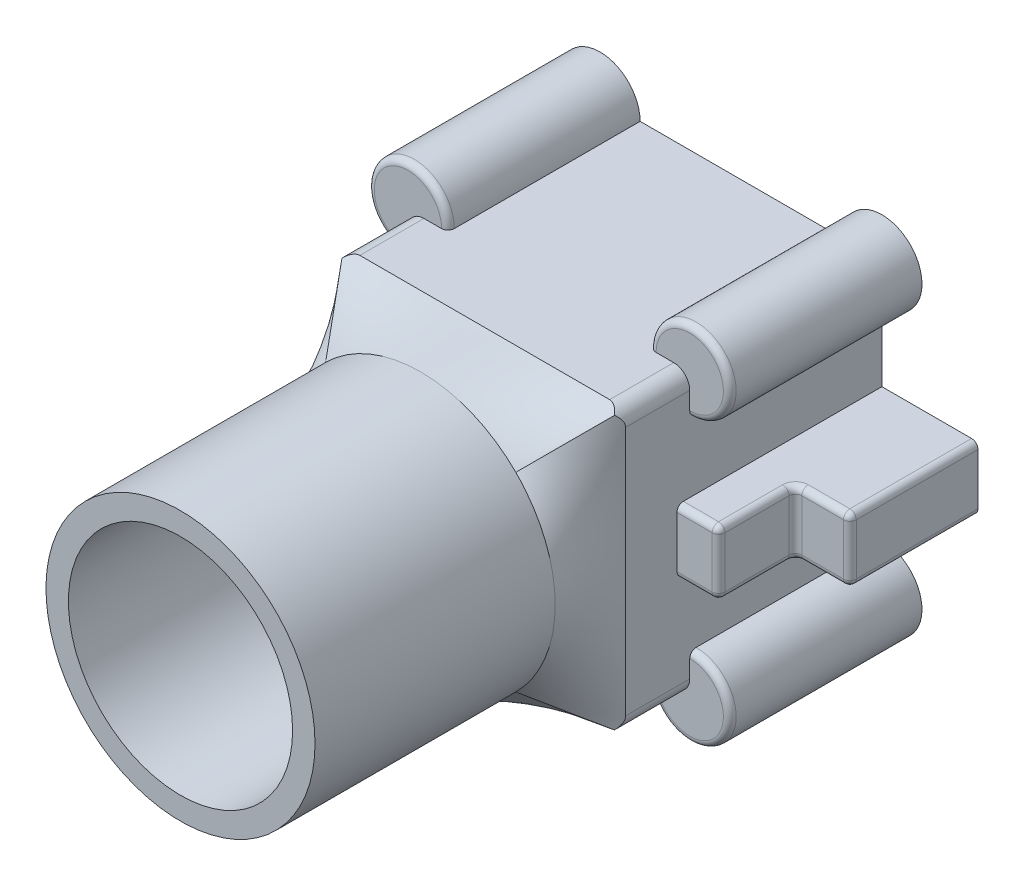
ISO-10303-21;
HEADER;
FILE_DESCRIPTION(('STEP AP214'),'2;1');
FILE_NAME('part.step','',(''),(''),'','','');
FILE_SCHEMA(('AUTOMOTIVE_DESIGN { 1 0 10303 214 1 1 1 1 }'));
ENDSEC;
DATA;
#1=APPLICATION_CONTEXT('core data for automotive mechanical design processes');
#2=APPLICATION_PROTOCOL_DEFINITION('international standard','automotive_design',2000,#1);
#3=PRODUCT_CONTEXT('',#1,'mechanical');
#4=PRODUCT('Part','Part','',(#3));
#5=PRODUCT_RELATED_PRODUCT_CATEGORY('part','',(#4));
#6=PRODUCT_DEFINITION_FORMATION('','',#4);
#7=PRODUCT_DEFINITION_CONTEXT('part definition',#1,'design');
#8=PRODUCT_DEFINITION('design','',#6,#7);
#9=PRODUCT_DEFINITION_SHAPE('','',#8);
#10=(LENGTH_UNIT() NAMED_UNIT(*) SI_UNIT(.MILLI.,.METRE.));
#11=(NAMED_UNIT(*) PLANE_ANGLE_UNIT() SI_UNIT($,.RADIAN.));
#12=(NAMED_UNIT(*) SI_UNIT($,.STERADIAN.) SOLID_ANGLE_UNIT());
#13=UNCERTAINTY_MEASURE_WITH_UNIT(LENGTH_MEASURE(1.E-05),#10,'distance_accuracy_value','');
#14=(GEOMETRIC_REPRESENTATION_CONTEXT(3) GLOBAL_UNCERTAINTY_ASSIGNED_CONTEXT((#13)) GLOBAL_UNIT_ASSIGNED_CONTEXT((#10,
#11,#12)) REPRESENTATION_CONTEXT('',''));
#15=CARTESIAN_POINT('',(0.,0.,0.));
#16=DIRECTION('',(0.,0.,1.));
#17=DIRECTION('',(1.,0.,0.));
#18=AXIS2_PLACEMENT_3D('',#15,#16,#17);
#19=CARTESIAN_POINT('',(220.,-220.,400.));
#20=DIRECTION('',(-1.,0.,0.));
#21=DIRECTION('',(0.,0.,1.));
#22=AXIS2_PLACEMENT_3D('',#19,#20,#21);
#23=PLANE('',#22);
#24=DIRECTION('',(0.,0.,1.));
#25=VECTOR('',#24,1.);
#26=CARTESIAN_POINT('',(220.,50.,300.));
#27=LINE('',#26,#25);
#28=CARTESIAN_POINT('',(220.,50.,0.));
#29=VERTEX_POINT('',#28);
#30=CARTESIAN_POINT('',(220.,50.,310.));
#31=VERTEX_POINT('',#30);
#32=EDGE_CURVE('E370',#29,#31,#27,.T.);
#33=ORIENTED_EDGE('',*,*,#32,.F.);
#34=DIRECTION('',(0.,1.,0.));
#35=VECTOR('',#34,1.);
#36=CARTESIAN_POINT('',(220.,-220.,0.));
#37=LINE('',#36,#35);
#38=CARTESIAN_POINT('',(220.,157.5,0.));
#39=VERTEX_POINT('',#38);
#40=EDGE_CURVE('E379',#29,#39,#37,.T.);
#41=ORIENTED_EDGE('',*,*,#40,.T.);
#42=DIRECTION('',(0.,0.,-1.));
#43=VECTOR('',#42,1.);
#44=CARTESIAN_POINT('',(220.,157.5,300.));
#45=LINE('',#44,#43);
#46=CARTESIAN_POINT('',(220.,157.5,290.));
#47=VERTEX_POINT('',#46);
#48=EDGE_CURVE('E442',#39,#47,#45,.F.);
#49=ORIENTED_EDGE('',*,*,#48,.T.);
#50=CARTESIAN_POINT('',(220.,167.5,290.));
#51=DIRECTION('',(-1.,0.,0.));
#52=DIRECTION('',(0.,0.,1.));
#53=AXIS2_PLACEMENT_3D('',#50,#51,#52);
#54=CIRCLE('',#53,10.);
#55=CARTESIAN_POINT('',(220.,167.5,300.));
#56=VERTEX_POINT('',#55);
#57=EDGE_CURVE('E75',#47,#56,#54,.T.);
#58=ORIENTED_EDGE('',*,*,#57,.T.);
#59=DIRECTION('',(0.,1.,0.));
#60=VECTOR('',#59,1.);
#61=CARTESIAN_POINT('',(220.,-220.,300.));
#62=LINE('',#61,#60);
#63=CARTESIAN_POINT('',(220.,195.,300.));
#64=VERTEX_POINT('',#63);
#65=EDGE_CURVE('E1055',#56,#64,#62,.T.);
#66=ORIENTED_EDGE('',*,*,#65,.T.);
#67=DIRECTION('',(0.,0.,-1.));
#68=VECTOR('',#67,1.);
#69=CARTESIAN_POINT('',(220.,195.,400.));
#70=LINE('',#69,#68);
#71=CARTESIAN_POINT('',(220.,195.,400.));
#72=VERTEX_POINT('',#71);
#73=EDGE_CURVE('E874',#64,#72,#70,.F.);
#74=ORIENTED_EDGE('',*,*,#73,.T.);
#75=DIRECTION('',(0.,1.,0.));
#76=VECTOR('',#75,1.);
#77=CARTESIAN_POINT('',(220.,-220.,400.));
#78=LINE('',#77,#76);
#79=CARTESIAN_POINT('',(220.,-195.,400.));
#80=VERTEX_POINT('',#79);
#81=EDGE_CURVE('E477',#80,#72,#78,.T.);
#82=ORIENTED_EDGE('',*,*,#81,.F.);
#83=DIRECTION('',(0.,0.,-1.));
#84=VECTOR('',#83,1.);
#85=CARTESIAN_POINT('',(220.,-195.,400.));
#86=LINE('',#85,#84);
#87=CARTESIAN_POINT('',(220.,-195.,300.));
#88=VERTEX_POINT('',#87);
#89=EDGE_CURVE('E869',#80,#88,#86,.T.);
#90=ORIENTED_EDGE('',*,*,#89,.T.);
#91=DIRECTION('',(0.,1.,0.));
#92=VECTOR('',#91,1.);
#93=CARTESIAN_POINT('',(220.,-220.,300.));
#94=LINE('',#93,#92);
#95=CARTESIAN_POINT('',(220.,-167.5,300.));
#96=VERTEX_POINT('',#95);
#97=EDGE_CURVE('E428',#88,#96,#94,.T.);
#98=ORIENTED_EDGE('',*,*,#97,.T.);
#99=CARTESIAN_POINT('',(220.,-167.5,290.));
#100=DIRECTION('',(-1.,0.,0.));
#101=DIRECTION('',(0.,0.,1.));
#102=AXIS2_PLACEMENT_3D('',#99,#100,#101);
#103=CIRCLE('',#102,10.);
#104=CARTESIAN_POINT('',(220.,-157.5,290.));
#105=VERTEX_POINT('',#104);
#106=EDGE_CURVE('E750',#96,#105,#103,.T.);
#107=ORIENTED_EDGE('',*,*,#106,.T.);
#108=DIRECTION('',(0.,0.,-1.));
#109=VECTOR('',#108,1.);
#110=CARTESIAN_POINT('',(220.,-157.5,300.));
#111=LINE('',#110,#109);
#112=CARTESIAN_POINT('',(220.,-157.5,0.));
#113=VERTEX_POINT('',#112);
#114=EDGE_CURVE('E425',#113,#105,#111,.F.);
#115=ORIENTED_EDGE('',*,*,#114,.F.);
#116=CARTESIAN_POINT('',(220.,-50.,0.));
#117=VERTEX_POINT('',#116);
#118=EDGE_CURVE('E386',#113,#117,#37,.T.);
#119=ORIENTED_EDGE('',*,*,#118,.T.);
#120=DIRECTION('',(0.,0.,1.));
#121=VECTOR('',#120,1.);
#122=CARTESIAN_POINT('',(220.,-50.,320.));
#123=LINE('',#122,#121);
#124=CARTESIAN_POINT('',(220.,-50.,310.));
#125=VERTEX_POINT('',#124);
#126=EDGE_CURVE('E394',#117,#125,#123,.T.);
#127=ORIENTED_EDGE('',*,*,#126,.T.);
#128=CARTESIAN_POINT('',(220.,-40.,310.));
#129=DIRECTION('',(-1.,0.,0.));
#130=DIRECTION('',(0.,0.,1.));
#131=AXIS2_PLACEMENT_3D('',#128,#129,#130);
#132=CIRCLE('',#131,10.);
#133=CARTESIAN_POINT('',(220.,-40.,320.));
#134=VERTEX_POINT('',#133);
#135=EDGE_CURVE('E735',#125,#134,#132,.T.);
#136=ORIENTED_EDGE('',*,*,#135,.T.);
#137=DIRECTION('',(0.,-1.,0.));
#138=VECTOR('',#137,1.);
#139=CARTESIAN_POINT('',(220.,50.,320.));
#140=LINE('',#139,#138);
#141=CARTESIAN_POINT('',(220.,40.,320.));
#142=VERTEX_POINT('',#141);
#143=EDGE_CURVE('E401',#142,#134,#140,.T.);
#144=ORIENTED_EDGE('',*,*,#143,.F.);
#145=CARTESIAN_POINT('',(220.,40.,310.));
#146=DIRECTION('',(-1.,0.,0.));
#147=DIRECTION('',(0.,0.,1.));
#148=AXIS2_PLACEMENT_3D('',#145,#146,#147);
#149=CIRCLE('',#148,10.);
#150=EDGE_CURVE('E391',#142,#31,#149,.T.);
#151=ORIENTED_EDGE('',*,*,#150,.T.);
#152=EDGE_LOOP('',(#33,#41,#49,#58,#66,#74,#82,#90,#98,#107,#115,#119,#127,#136,#144,#151));
#153=FACE_BOUND('',#152,.T.);
#154=ADVANCED_FACE('F66',(#153),#23,.F.);
#155=CARTESIAN_POINT('',(-220.,-220.,400.));
#156=DIRECTION('',(0.,1.,0.));
#157=DIRECTION('',(0.,0.,1.));
#158=AXIS2_PLACEMENT_3D('',#155,#156,#157);
#159=PLANE('',#158);
#160=DIRECTION('',(0.,0.,-1.));
#161=VECTOR('',#160,1.);
#162=CARTESIAN_POINT('',(157.5,-220.,300.));
#163=LINE('',#162,#161);
#164=CARTESIAN_POINT('',(157.5,-220.,290.));
#165=VERTEX_POINT('',#164);
#166=CARTESIAN_POINT('',(157.5,-220.,0.));
#167=VERTEX_POINT('',#166);
#168=EDGE_CURVE('E423',#165,#167,#163,.T.);
#169=ORIENTED_EDGE('',*,*,#168,.F.);
#170=CARTESIAN_POINT('',(167.5,-220.,290.));
#171=DIRECTION('',(0.,1.,0.));
#172=DIRECTION('',(0.,0.,1.));
#173=AXIS2_PLACEMENT_3D('',#170,#171,#172);
#174=CIRCLE('',#173,10.);
#175=CARTESIAN_POINT('',(167.5,-220.,300.));
#176=VERTEX_POINT('',#175);
#177=EDGE_CURVE('E752',#165,#176,#174,.T.);
#178=ORIENTED_EDGE('',*,*,#177,.T.);
#179=DIRECTION('',(1.,0.,0.));
#180=VECTOR('',#179,1.);
#181=CARTESIAN_POINT('',(-220.,-220.,300.));
#182=LINE('',#181,#180);
#183=CARTESIAN_POINT('',(195.,-220.,300.));
#184=VERTEX_POINT('',#183);
#185=EDGE_CURVE('E865',#176,#184,#182,.T.);
#186=ORIENTED_EDGE('',*,*,#185,.T.);
#187=DIRECTION('',(0.,0.,-1.));
#188=VECTOR('',#187,1.);
#189=CARTESIAN_POINT('',(195.,-220.,400.));
#190=LINE('',#189,#188);
#191=CARTESIAN_POINT('',(195.,-220.,400.));
#192=VERTEX_POINT('',#191);
#193=EDGE_CURVE('E1007',#184,#192,#190,.F.);
#194=ORIENTED_EDGE('',*,*,#193,.T.);
#195=DIRECTION('',(1.,0.,0.));
#196=VECTOR('',#195,1.);
#197=CARTESIAN_POINT('',(-220.,-220.,400.));
#198=LINE('',#197,#196);
#199=CARTESIAN_POINT('',(-195.,-220.,400.));
#200=VERTEX_POINT('',#199);
#201=EDGE_CURVE('E617',#200,#192,#198,.T.);
#202=ORIENTED_EDGE('',*,*,#201,.F.);
#203=DIRECTION('',(0.,0.,-1.));
#204=VECTOR('',#203,1.);
#205=CARTESIAN_POINT('',(-195.,-220.,400.));
#206=LINE('',#205,#204);
#207=CARTESIAN_POINT('',(-195.,-220.,300.));
#208=VERTEX_POINT('',#207);
#209=EDGE_CURVE('E1011',#200,#208,#206,.T.);
#210=ORIENTED_EDGE('',*,*,#209,.T.);
#211=DIRECTION('',(1.,0.,0.));
#212=VECTOR('',#211,1.);
#213=CARTESIAN_POINT('',(-220.,-220.,300.));
#214=LINE('',#213,#212);
#215=CARTESIAN_POINT('',(-167.5,-220.,300.));
#216=VERTEX_POINT('',#215);
#217=EDGE_CURVE('E1049',#208,#216,#214,.T.);
#218=ORIENTED_EDGE('',*,*,#217,.T.);
#219=CARTESIAN_POINT('',(-167.5,-220.,290.));
#220=DIRECTION('',(0.,1.,0.));
#221=DIRECTION('',(0.,0.,1.));
#222=AXIS2_PLACEMENT_3D('',#219,#220,#221);
#223=CIRCLE('',#222,10.);
#224=CARTESIAN_POINT('',(-157.5,-220.,290.));
#225=VERTEX_POINT('',#224);
#226=EDGE_CURVE('E744',#216,#225,#223,.T.);
#227=ORIENTED_EDGE('',*,*,#226,.T.);
#228=DIRECTION('',(0.,0.,-1.));
#229=VECTOR('',#228,1.);
#230=CARTESIAN_POINT('',(-157.5,-220.,300.));
#231=LINE('',#230,#229);
#232=CARTESIAN_POINT('',(-157.5,-220.,0.));
#233=VERTEX_POINT('',#232);
#234=EDGE_CURVE('E434',#225,#233,#231,.T.);
#235=ORIENTED_EDGE('',*,*,#234,.T.);
#236=DIRECTION('',(1.,0.,0.));
#237=VECTOR('',#236,1.);
#238=CARTESIAN_POINT('',(-220.,-220.,0.));
#239=LINE('',#238,#237);
#240=CARTESIAN_POINT('',(-75.0000000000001,-220.,0.));
#241=VERTEX_POINT('',#240);
#242=EDGE_CURVE('E464',#233,#241,#239,.T.);
#243=ORIENTED_EDGE('',*,*,#242,.T.);
#244=DIRECTION('',(0.,0.,-1.));
#245=VECTOR('',#244,1.);
#246=CARTESIAN_POINT('',(-75.,-220.,0.));
#247=LINE('',#246,#245);
#248=CARTESIAN_POINT('',(-75.0000000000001,-220.,260.));
#249=VERTEX_POINT('',#248);
#250=EDGE_CURVE('E409',#249,#241,#247,.T.);
#251=ORIENTED_EDGE('',*,*,#250,.F.);
#252=CARTESIAN_POINT('',(-65.0000000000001,-220.,260.));
#253=DIRECTION('',(0.,1.,0.));
#254=DIRECTION('',(0.,0.,1.));
#255=AXIS2_PLACEMENT_3D('',#252,#253,#254);
#256=CIRCLE('',#255,10.);
#257=CARTESIAN_POINT('',(-65.0000000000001,-220.,270.));
#258=VERTEX_POINT('',#257);
#259=EDGE_CURVE('E738',#249,#258,#256,.T.);
#260=ORIENTED_EDGE('',*,*,#259,.T.);
#261=DIRECTION('',(-1.,0.,0.));
#262=VECTOR('',#261,1.);
#263=CARTESIAN_POINT('',(-75.0000000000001,-220.,270.));
#264=LINE('',#263,#262);
#265=CARTESIAN_POINT('',(64.9999999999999,-220.,270.));
#266=VERTEX_POINT('',#265);
#267=EDGE_CURVE('E412',#266,#258,#264,.T.);
#268=ORIENTED_EDGE('',*,*,#267,.F.);
#269=CARTESIAN_POINT('',(64.9999999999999,-220.,260.));
#270=DIRECTION('',(0.,1.,0.));
#271=DIRECTION('',(0.,0.,1.));
#272=AXIS2_PLACEMENT_3D('',#269,#270,#271);
#273=CIRCLE('',#272,10.);
#274=CARTESIAN_POINT('',(74.9999999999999,-220.,260.));
#275=VERTEX_POINT('',#274);
#276=EDGE_CURVE('E740',#266,#275,#273,.T.);
#277=ORIENTED_EDGE('',*,*,#276,.T.);
#278=DIRECTION('',(0.,0.,1.));
#279=VECTOR('',#278,1.);
#280=CARTESIAN_POINT('',(75.,-220.,0.));
#281=LINE('',#280,#279);
#282=CARTESIAN_POINT('',(75.,-220.,0.));
#283=VERTEX_POINT('',#282);
#284=EDGE_CURVE('E404',#283,#275,#281,.T.);
#285=ORIENTED_EDGE('',*,*,#284,.F.);
#286=EDGE_CURVE('E463',#283,#167,#239,.T.);
#287=ORIENTED_EDGE('',*,*,#286,.T.);
#288=EDGE_LOOP('',(#169,#178,#186,#194,#202,#210,#218,#227,#235,#243,#251,#260,#268,#277,#285,#287));
#289=FACE_BOUND('',#288,.T.);
#290=ADVANCED_FACE('F845',(#289),#159,.F.);
#291=CARTESIAN_POINT('',(-220.,220.,400.));
#292=DIRECTION('',(0.,-1.,0.));
#293=DIRECTION('',(0.,0.,-1.));
#294=AXIS2_PLACEMENT_3D('',#291,#292,#293);
#295=PLANE('',#294);
#296=DIRECTION('',(-1.,0.,0.));
#297=VECTOR('',#296,1.);
#298=CARTESIAN_POINT('',(-220.,220.,400.));
#299=LINE('',#298,#297);
#300=CARTESIAN_POINT('',(195.,220.,400.));
#301=VERTEX_POINT('',#300);
#302=CARTESIAN_POINT('',(-195.,220.,400.));
#303=VERTEX_POINT('',#302);
#304=EDGE_CURVE('E625',#301,#303,#299,.T.);
#305=ORIENTED_EDGE('',*,*,#304,.F.);
#306=DIRECTION('',(0.,0.,-1.));
#307=VECTOR('',#306,1.);
#308=CARTESIAN_POINT('',(195.,220.,400.));
#309=LINE('',#308,#307);
#310=CARTESIAN_POINT('',(195.,220.,300.));
#311=VERTEX_POINT('',#310);
#312=EDGE_CURVE('E875',#301,#311,#309,.T.);
#313=ORIENTED_EDGE('',*,*,#312,.T.);
#314=DIRECTION('',(-1.,0.,0.));
#315=VECTOR('',#314,1.);
#316=CARTESIAN_POINT('',(-220.,220.,300.));
#317=LINE('',#316,#315);
#318=CARTESIAN_POINT('',(167.5,220.,300.));
#319=VERTEX_POINT('',#318);
#320=EDGE_CURVE('E446',#311,#319,#317,.T.);
#321=ORIENTED_EDGE('',*,*,#320,.T.);
#322=CARTESIAN_POINT('',(167.5,220.,290.));
#323=DIRECTION('',(0.,-1.,0.));
#324=DIRECTION('',(0.,0.,-1.));
#325=AXIS2_PLACEMENT_3D('',#322,#323,#324);
#326=CIRCLE('',#325,10.);
#327=CARTESIAN_POINT('',(157.5,220.,290.));
#328=VERTEX_POINT('',#327);
#329=EDGE_CURVE('E12',#319,#328,#326,.T.);
#330=ORIENTED_EDGE('',*,*,#329,.T.);
#331=DIRECTION('',(0.,0.,-1.));
#332=VECTOR('',#331,1.);
#333=CARTESIAN_POINT('',(157.5,220.,300.));
#334=LINE('',#333,#332);
#335=CARTESIAN_POINT('',(157.5,220.,0.));
#336=VERTEX_POINT('',#335);
#337=EDGE_CURVE('E444',#328,#336,#334,.T.);
#338=ORIENTED_EDGE('',*,*,#337,.T.);
#339=DIRECTION('',(-1.,0.,0.));
#340=VECTOR('',#339,1.);
#341=CARTESIAN_POINT('',(-220.,220.,0.));
#342=LINE('',#341,#340);
#343=CARTESIAN_POINT('',(-157.5,220.,0.));
#344=VERTEX_POINT('',#343);
#345=EDGE_CURVE('E458',#336,#344,#342,.T.);
#346=ORIENTED_EDGE('',*,*,#345,.T.);
#347=DIRECTION('',(0.,0.,-1.));
#348=VECTOR('',#347,1.);
#349=CARTESIAN_POINT('',(-157.5,220.,300.));
#350=LINE('',#349,#348);
#351=CARTESIAN_POINT('',(-157.5,220.,290.));
#352=VERTEX_POINT('',#351);
#353=EDGE_CURVE('E454',#352,#344,#350,.T.);
#354=ORIENTED_EDGE('',*,*,#353,.F.);
#355=CARTESIAN_POINT('',(-167.5,220.,290.));
#356=DIRECTION('',(0.,-1.,0.));
#357=DIRECTION('',(0.,0.,-1.));
#358=AXIS2_PLACEMENT_3D('',#355,#356,#357);
#359=CIRCLE('',#358,10.);
#360=CARTESIAN_POINT('',(-167.5,220.,300.));
#361=VERTEX_POINT('',#360);
#362=EDGE_CURVE('E748',#352,#361,#359,.T.);
#363=ORIENTED_EDGE('',*,*,#362,.T.);
#364=DIRECTION('',(-1.,0.,0.));
#365=VECTOR('',#364,1.);
#366=CARTESIAN_POINT('',(-220.,220.,300.));
#367=LINE('',#366,#365);
#368=CARTESIAN_POINT('',(-195.,220.,300.));
#369=VERTEX_POINT('',#368);
#370=EDGE_CURVE('E387',#361,#369,#367,.T.);
#371=ORIENTED_EDGE('',*,*,#370,.T.);
#372=DIRECTION('',(0.,0.,-1.));
#373=VECTOR('',#372,1.);
#374=CARTESIAN_POINT('',(-195.,220.,400.));
#375=LINE('',#374,#373);
#376=EDGE_CURVE('E880',#369,#303,#375,.F.);
#377=ORIENTED_EDGE('',*,*,#376,.T.);
#378=EDGE_LOOP('',(#305,#313,#321,#330,#338,#346,#354,#363,#371,#377));
#379=FACE_BOUND('',#378,.T.);
#380=ADVANCED_FACE('F936',(#379),#295,.F.);
#381=CARTESIAN_POINT('',(-220.,-220.,400.));
#382=DIRECTION('',(1.,0.,0.));
#383=DIRECTION('',(0.,0.,-1.));
#384=AXIS2_PLACEMENT_3D('',#381,#382,#383);
#385=PLANE('',#384);
#386=DIRECTION('',(0.,0.,-1.));
#387=VECTOR('',#386,1.);
#388=CARTESIAN_POINT('',(-220.,-157.5,300.));
#389=LINE('',#388,#387);
#390=CARTESIAN_POINT('',(-220.,-157.5,0.));
#391=VERTEX_POINT('',#390);
#392=CARTESIAN_POINT('',(-220.,-157.5,290.));
#393=VERTEX_POINT('',#392);
#394=EDGE_CURVE('E436',#391,#393,#389,.F.);
#395=ORIENTED_EDGE('',*,*,#394,.T.);
#396=CARTESIAN_POINT('',(-220.,-167.5,290.));
#397=DIRECTION('',(1.,0.,0.));
#398=DIRECTION('',(0.,0.,-1.));
#399=AXIS2_PLACEMENT_3D('',#396,#397,#398);
#400=CIRCLE('',#399,10.);
#401=CARTESIAN_POINT('',(-220.,-167.5,300.));
#402=VERTEX_POINT('',#401);
#403=EDGE_CURVE('E742',#393,#402,#400,.T.);
#404=ORIENTED_EDGE('',*,*,#403,.T.);
#405=DIRECTION('',(0.,-1.,0.));
#406=VECTOR('',#405,1.);
#407=CARTESIAN_POINT('',(-220.,-220.,300.));
#408=LINE('',#407,#406);
#409=CARTESIAN_POINT('',(-220.,-195.,300.));
#410=VERTEX_POINT('',#409);
#411=EDGE_CURVE('E439',#402,#410,#408,.T.);
#412=ORIENTED_EDGE('',*,*,#411,.T.);
#413=DIRECTION('',(0.,0.,-1.));
#414=VECTOR('',#413,1.);
#415=CARTESIAN_POINT('',(-220.,-195.,400.));
#416=LINE('',#415,#414);
#417=CARTESIAN_POINT('',(-220.,-195.,400.));
#418=VERTEX_POINT('',#417);
#419=EDGE_CURVE('E993',#410,#418,#416,.F.);
#420=ORIENTED_EDGE('',*,*,#419,.T.);
#421=DIRECTION('',(0.,-1.,0.));
#422=VECTOR('',#421,1.);
#423=CARTESIAN_POINT('',(-220.,-220.,400.));
#424=LINE('',#423,#422);
#425=CARTESIAN_POINT('',(-220.,195.,400.));
#426=VERTEX_POINT('',#425);
#427=EDGE_CURVE('E629',#426,#418,#424,.T.);
#428=ORIENTED_EDGE('',*,*,#427,.F.);
#429=DIRECTION('',(0.,0.,-1.));
#430=VECTOR('',#429,1.);
#431=CARTESIAN_POINT('',(-220.,195.,400.));
#432=LINE('',#431,#430);
#433=CARTESIAN_POINT('',(-220.,195.,300.));
#434=VERTEX_POINT('',#433);
#435=EDGE_CURVE('E917',#426,#434,#432,.T.);
#436=ORIENTED_EDGE('',*,*,#435,.T.);
#437=DIRECTION('',(0.,-1.,0.));
#438=VECTOR('',#437,1.);
#439=CARTESIAN_POINT('',(-220.,-220.,300.));
#440=LINE('',#439,#438);
#441=CARTESIAN_POINT('',(-220.,167.5,300.));
#442=VERTEX_POINT('',#441);
#443=EDGE_CURVE('E612',#434,#442,#440,.T.);
#444=ORIENTED_EDGE('',*,*,#443,.T.);
#445=CARTESIAN_POINT('',(-220.,167.5,290.));
#446=DIRECTION('',(1.,0.,0.));
#447=DIRECTION('',(0.,0.,-1.));
#448=AXIS2_PLACEMENT_3D('',#445,#446,#447);
#449=CIRCLE('',#448,10.);
#450=CARTESIAN_POINT('',(-220.,157.5,290.));
#451=VERTEX_POINT('',#450);
#452=EDGE_CURVE('E746',#442,#451,#449,.T.);
#453=ORIENTED_EDGE('',*,*,#452,.T.);
#454=DIRECTION('',(0.,0.,-1.));
#455=VECTOR('',#454,1.);
#456=CARTESIAN_POINT('',(-220.,157.5,300.));
#457=LINE('',#456,#455);
#458=CARTESIAN_POINT('',(-220.,157.5,0.));
#459=VERTEX_POINT('',#458);
#460=EDGE_CURVE('E451',#459,#451,#457,.F.);
#461=ORIENTED_EDGE('',*,*,#460,.F.);
#462=DIRECTION('',(0.,-1.,0.));
#463=VECTOR('',#462,1.);
#464=CARTESIAN_POINT('',(-220.,-220.,0.));
#465=LINE('',#464,#463);
#466=EDGE_CURVE('E461',#459,#391,#465,.T.);
#467=ORIENTED_EDGE('',*,*,#466,.T.);
#468=EDGE_LOOP('',(#395,#404,#412,#420,#428,#436,#444,#453,#461,#467));
#469=FACE_BOUND('',#468,.T.);
#470=ADVANCED_FACE('F595',(#469),#385,.F.);
#471=CARTESIAN_POINT('',(0.,0.,875.));
#472=DIRECTION('',(0.,0.,-1.));
#473=DIRECTION('',(-1.,0.,0.));
#474=AXIS2_PLACEMENT_3D('',#471,#472,#473);
#475=CYLINDRICAL_SURFACE('',#474,210.);
#476=CARTESIAN_POINT('',(0.,0.,875.));
#477=DIRECTION('',(0.,0.,1.));
#478=DIRECTION('',(1.,0.,0.));
#479=AXIS2_PLACEMENT_3D('',#476,#477,#478);
#480=CIRCLE('',#479,210.);
#481=CARTESIAN_POINT('',(210.,0.,875.));
#482=VERTEX_POINT('',#481);
#483=EDGE_CURVE('E609',#482,#482,#480,.T.);
#484=ORIENTED_EDGE('',*,*,#483,.F.);
#485=EDGE_LOOP('',(#484));
#486=FACE_BOUND('',#485,.T.);
#487=CARTESIAN_POINT('',(148.492424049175,148.492424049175,500.));
#488=CARTESIAN_POINT('',(147.447995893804,149.536855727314,499.99999560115));
#489=CARTESIAN_POINT('',(146.392545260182,150.570264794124,499.999981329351));
#490=CARTESIAN_POINT('',(144.260076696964,152.614585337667,499.999953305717));
#491=CARTESIAN_POINT('',(143.183058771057,153.625496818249,499.999939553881));
#492=CARTESIAN_POINT('',(141.007861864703,155.624435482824,499.9999328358));
#493=CARTESIAN_POINT('',(139.90968150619,156.61246116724,499.999939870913));
#494=CARTESIAN_POINT('',(137.692717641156,158.565120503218,499.999969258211));
#495=CARTESIAN_POINT('',(136.573934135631,159.529754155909,499.999991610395));
#496=CARTESIAN_POINT('',(134.3162093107,161.435244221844,500.000001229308));
#497=CARTESIAN_POINT('',(133.177267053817,162.376099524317,499.9999884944));
#498=CARTESIAN_POINT('',(130.879782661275,164.233567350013,499.999945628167));
#499=CARTESIAN_POINT('',(129.721240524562,165.150179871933,499.999915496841));
#500=CARTESIAN_POINT('',(127.38503901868,166.958779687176,499.999885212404));
#501=CARTESIAN_POINT('',(126.207379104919,167.850766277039,499.999885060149));
#502=CARTESIAN_POINT('',(123.833498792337,169.609689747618,499.999915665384));
#503=CARTESIAN_POINT('',(122.637278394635,170.476626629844,499.999946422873));
#504=CARTESIAN_POINT('',(120.228673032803,172.183744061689,499.999991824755));
#505=CARTESIAN_POINT('',(119.016315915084,173.023963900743,500.000006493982));
#506=CARTESIAN_POINT('',(116.57416802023,174.678673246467,499.999968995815));
#507=CARTESIAN_POINT('',(115.344377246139,175.49316275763,499.999916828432));
#508=CARTESIAN_POINT('',(112.867966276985,177.096012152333,499.999840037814));
#509=CARTESIAN_POINT('',(111.621346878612,177.884373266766,499.999815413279));
#510=CARTESIAN_POINT('',(109.111774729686,179.434656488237,499.999815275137));
#511=CARTESIAN_POINT('',(107.848821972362,180.196578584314,499.99983976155));
#512=CARTESIAN_POINT('',(105.307247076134,181.693584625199,499.999923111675));
#513=CARTESIAN_POINT('',(104.028626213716,182.428670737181,499.999981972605));
#514=CARTESIAN_POINT('',(101.45618452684,183.871742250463,500.00000465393));
#515=CARTESIAN_POINT('',(100.16236372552,184.579727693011,499.999968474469));
#516=CARTESIAN_POINT('',(97.5602482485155,185.968202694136,499.999856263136));
#517=CARTESIAN_POINT('',(96.2519553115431,186.648695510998,499.999780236));
#518=CARTESIAN_POINT('',(93.6213210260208,187.981974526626,499.999692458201));
#519=CARTESIAN_POINT('',(92.2989795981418,188.634760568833,499.999680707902));
#520=CARTESIAN_POINT('',(89.4802925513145,189.989496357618,499.999745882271));
#521=CARTESIAN_POINT('',(87.9822219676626,190.687860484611,499.999833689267));
#522=CARTESIAN_POINT('',(84.9700050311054,192.049029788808,499.999969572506));
#523=CARTESIAN_POINT('',(83.4558585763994,192.711834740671,500.000017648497));
#524=CARTESIAN_POINT('',(80.4124668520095,194.001459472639,499.999912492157));
#525=CARTESIAN_POINT('',(78.8832228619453,194.628282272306,499.999759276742));
#526=CARTESIAN_POINT('',(75.8103668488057,195.845651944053,499.999543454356));
#527=CARTESIAN_POINT('',(74.2667548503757,196.436198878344,499.999480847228));
#528=CARTESIAN_POINT('',(71.1660405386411,197.580681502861,499.999519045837));
#529=CARTESIAN_POINT('',(69.608938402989,198.134617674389,499.999619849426));
#530=CARTESIAN_POINT('',(66.4820912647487,199.20557868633,499.999872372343));
#531=CARTESIAN_POINT('',(64.9123462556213,199.72260350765,500.000024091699));
#532=CARTESIAN_POINT('',(61.7619750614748,200.719172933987,499.999969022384));
#533=CARTESIAN_POINT('',(60.1813555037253,201.198738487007,499.999762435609));
#534=CARTESIAN_POINT('',(57.0092475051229,202.120443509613,499.999388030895));
#535=CARTESIAN_POINT('',(55.4177590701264,202.562582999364,499.999220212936));
#536=CARTESIAN_POINT('',(52.2247612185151,203.409199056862,499.999140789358));
#537=CARTESIAN_POINT('',(50.6232517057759,203.813675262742,499.9992291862));
#538=CARTESIAN_POINT('',(48.2141978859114,204.391959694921,499.999488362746));
#539=CARTESIAN_POINT('',(47.4100407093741,204.579984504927,499.999595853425));
#540=CARTESIAN_POINT('',(45.7995602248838,204.946535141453,499.999805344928));
#541=CARTESIAN_POINT('',(44.9932369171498,205.125060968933,499.999907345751));
#542=CARTESIAN_POINT('',(43.378568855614,205.472581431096,500.000008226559));
#543=CARTESIAN_POINT('',(42.5702241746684,205.641576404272,500.000007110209));
#544=CARTESIAN_POINT('',(40.9516015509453,205.970017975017,499.999878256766));
#545=CARTESIAN_POINT('',(40.1413236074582,206.129464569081,499.999750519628));
#546=CARTESIAN_POINT('',(37.7077640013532,206.593446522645,499.999328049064));
#547=CARTESIAN_POINT('',(36.0817193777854,206.883632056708,499.998994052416));
#548=CARTESIAN_POINT('',(32.973959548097,207.400493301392,499.998659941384));
#549=CARTESIAN_POINT('',(31.4928056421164,207.630560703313,499.998631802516));
#550=CARTESIAN_POINT('',(28.5259121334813,208.058931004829,499.998904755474));
#551=CARTESIAN_POINT('',(27.0401725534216,208.257234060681,499.999205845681));
#552=CARTESIAN_POINT('',(24.0648758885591,208.621973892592,499.999779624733));
#553=CARTESIAN_POINT('',(22.5753190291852,208.788412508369,500.000052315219));
#554=CARTESIAN_POINT('',(19.5929812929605,209.08936202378,499.999909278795));
#555=CARTESIAN_POINT('',(18.1002004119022,209.22387288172,499.999493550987));
#556=CARTESIAN_POINT('',(15.1121762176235,209.460898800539,499.998736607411));
#557=CARTESIAN_POINT('',(13.6169330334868,209.563415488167,499.998395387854));
#558=CARTESIAN_POINT('',(10.6245986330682,209.736415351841,499.998133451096));
#559=CARTESIAN_POINT('',(9.12750741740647,209.806898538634,499.998212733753));
#560=CARTESIAN_POINT('',(6.13174108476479,209.915813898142,499.998737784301));
#561=CARTESIAN_POINT('',(4.63306564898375,209.954237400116,499.999183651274));
#562=CARTESIAN_POINT('',(2.38471942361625,209.98779716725,499.999726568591));
#563=CARTESIAN_POINT('',(1.63520978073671,209.994971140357,499.999886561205));
#564=CARTESIAN_POINT('',(0.136153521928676,210.001293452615,500.000022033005));
#565=CARTESIAN_POINT('',(-0.613393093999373,210.000441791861,499.999997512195));
#566=CARTESIAN_POINT('',(-2.11247278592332,209.990712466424,499.999795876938));
#567=CARTESIAN_POINT('',(-2.8620058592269,209.981834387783,499.999618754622));
#568=CARTESIAN_POINT('',(-4.3609311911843,209.95605290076,499.999236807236));
#569=CARTESIAN_POINT('',(-5.11032344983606,209.939149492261,499.999031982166));
#570=CARTESIAN_POINT('',(-7.358159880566,209.876403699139,499.998491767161));
#571=CARTESIAN_POINT('',(-8.85628492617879,209.818525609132,499.998230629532));
#572=CARTESIAN_POINT('',(-11.8511674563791,209.670689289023,499.998172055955));
#573=CARTESIAN_POINT('',(-13.3479247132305,209.580726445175,499.998374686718));
#574=CARTESIAN_POINT('',(-15.5913345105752,209.4217570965,499.998857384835));
#575=CARTESIAN_POINT('',(-16.3388552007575,209.364762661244,499.999048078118));
#576=CARTESIAN_POINT('',(-17.8332462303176,209.242771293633,499.999422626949));
#577=CARTESIAN_POINT('',(-18.5801165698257,209.17777436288,499.999606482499));
#578=CARTESIAN_POINT('',(-20.0609608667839,209.040909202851,499.999887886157));
#579=CARTESIAN_POINT('',(-20.7949467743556,208.969170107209,499.999986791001));
#580=CARTESIAN_POINT('',(-22.2621219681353,208.81796328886,500.000010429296));
#581=CARTESIAN_POINT('',(-22.995311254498,208.738495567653,499.999935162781));
#582=CARTESIAN_POINT('',(-24.4608121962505,208.571840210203,499.999712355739));
#583=CARTESIAN_POINT('',(-25.1931238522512,208.484652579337,499.999564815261));
#584=CARTESIAN_POINT('',(-26.6567848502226,208.302567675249,499.999272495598));
#585=CARTESIAN_POINT('',(-27.3881341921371,208.207670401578,499.999127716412));
#586=CARTESIAN_POINT('',(-29.5808576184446,207.911396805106,499.998775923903));
#587=CARTESIAN_POINT('',(-31.0406885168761,207.6984635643,499.998651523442));
#588=CARTESIAN_POINT('',(-33.9555236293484,207.241884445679,499.998721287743));
#589=CARTESIAN_POINT('',(-35.410527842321,206.998238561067,499.998915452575));
#590=CARTESIAN_POINT('',(-38.3152159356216,206.480315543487,499.999419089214));
#591=CARTESIAN_POINT('',(-39.7648993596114,206.20603584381,499.999728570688));
#592=CARTESIAN_POINT('',(-41.93482374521,205.771753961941,499.999967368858));
#593=CARTESIAN_POINT('',(-42.6573699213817,205.623181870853,500.000009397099));
#594=CARTESIAN_POINT('',(-44.100857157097,205.318432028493,499.999982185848));
#595=CARTESIAN_POINT('',(-44.8217982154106,205.162254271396,499.99991294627));
#596=CARTESIAN_POINT('',(-46.9820974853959,204.682336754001,499.999666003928));
#597=CARTESIAN_POINT('',(-48.4189437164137,204.347210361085,499.999449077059));
#598=CARTESIAN_POINT('',(-51.2852403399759,203.646754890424,499.999186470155));
#599=CARTESIAN_POINT('',(-52.7146907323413,203.281425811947,499.999140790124));
#600=CARTESIAN_POINT('',(-55.5670239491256,202.520336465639,499.99923989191));
#601=CARTESIAN_POINT('',(-56.9898987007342,202.124545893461,499.999384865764));
#602=CARTESIAN_POINT('',(-59.8269893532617,201.303037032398,499.99972166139));
#603=CARTESIAN_POINT('',(-61.2412050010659,200.877317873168,499.999913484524));
#604=CARTESIAN_POINT('',(-65.4697963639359,199.555573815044,500.000092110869));
#605=CARTESIAN_POINT('',(-68.2704180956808,198.614881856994,499.999682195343));
#606=CARTESIAN_POINT('',(-72.4394135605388,197.115989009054,499.99947943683));
#607=CARTESIAN_POINT('',(-73.8237867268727,196.601702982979,499.999480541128));
#608=CARTESIAN_POINT('',(-76.5814127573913,195.544030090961,499.999588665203));
#609=CARTESIAN_POINT('',(-77.9546655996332,195.000643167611,499.999695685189));
#610=CARTESIAN_POINT('',(-80.6894191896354,193.885014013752,499.999898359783));
#611=CARTESIAN_POINT('',(-82.0509197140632,193.312771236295,499.999994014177));
#612=CARTESIAN_POINT('',(-84.7615408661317,192.13969404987,500.000005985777));
#613=CARTESIAN_POINT('',(-86.1106615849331,191.538859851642,499.999922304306));
#614=CARTESIAN_POINT('',(-88.5852270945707,190.405377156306,499.999791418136));
#615=CARTESIAN_POINT('',(-89.7125495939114,189.87682438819,499.999740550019));
#616=CARTESIAN_POINT('',(-91.957598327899,188.799762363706,499.999688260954));
#617=CARTESIAN_POINT('',(-93.0753246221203,188.251253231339,499.9996868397));
#618=CARTESIAN_POINT('',(-96.4136999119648,186.575985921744,499.99977308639));
#619=CARTESIAN_POINT('',(-98.619524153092,185.4194975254,499.999951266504));
#620=CARTESIAN_POINT('',(-102.9886712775,183.028783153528,500.000020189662));
#621=CARTESIAN_POINT('',(-105.151992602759,181.794554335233,499.999910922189));
#622=CARTESIAN_POINT('',(-109.433443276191,179.249889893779,499.999810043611));
#623=CARTESIAN_POINT('',(-111.551571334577,177.939452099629,499.999818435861));
#624=CARTESIAN_POINT('',(-115.739914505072,175.24404194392,499.999911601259));
#625=CARTESIAN_POINT('',(-117.810128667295,173.859068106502,499.999996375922));
#626=CARTESIAN_POINT('',(-121.901252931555,171.015479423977,499.999993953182));
#627=CARTESIAN_POINT('',(-123.922131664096,169.556819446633,499.999906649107));
#628=CARTESIAN_POINT('',(-127.910682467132,166.568504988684,499.999877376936));
#629=CARTESIAN_POINT('',(-129.87835489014,165.038850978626,499.999935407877));
#630=CARTESIAN_POINT('',(-133.75799385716,161.910496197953,499.999989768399));
#631=CARTESIAN_POINT('',(-135.669960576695,160.311795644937,499.999986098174));
#632=CARTESIAN_POINT('',(-139.43582672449,157.04731607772,499.999956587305));
#633=CARTESIAN_POINT('',(-141.289726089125,155.381536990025,499.999930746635));
#634=CARTESIAN_POINT('',(-144.025153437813,152.834249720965,499.999946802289));
#635=CARTESIAN_POINT('',(-144.929411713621,151.97703141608,499.999961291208));
#636=CARTESIAN_POINT('',(-146.72252868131,150.246636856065,499.999987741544));
#637=CARTESIAN_POINT('',(-147.611387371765,149.373460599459,499.999999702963));
#638=CARTESIAN_POINT('',(-148.492424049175,148.492424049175,500.));
#639=B_SPLINE_CURVE_WITH_KNOTS('',3,(#487,#488,#489,#490,#491,#492,#493,#494,#495,#496,#497,
#498,#499,#500,#501,#502,#503,#504,#505,#506,#507,#508,#509,#510,#511,#512,#513,#514,#515,#516,
#517,#518,#519,#520,#521,#522,#523,#524,#525,#526,#527,#528,#529,#530,#531,#532,#533,#534,#535,
#536,#537,#538,#539,#540,#541,#542,#543,#544,#545,#546,#547,#548,#549,#550,#551,#552,#553,#554,
#555,#556,#557,#558,#559,#560,#561,#562,#563,#564,#565,#566,#567,#568,#569,#570,#571,#572,#573,
#574,#575,#576,#577,#578,#579,#580,#581,#582,#583,#584,#585,#586,#587,#588,#589,#590,#591,#592,
#593,#594,#595,#596,#597,#598,#599,#600,#601,#602,#603,#604,#605,#606,#607,#608,#609,#610,#611,
#612,#613,#614,#615,#616,#617,#618,#619,#620,#621,#622,#623,#624,#625,#626,#627,#628,#629,#630,
#631,#632,#633,#634,#635,#636,#637,#638),.UNSPECIFIED.,.F.,.F.,(4,2,2,2,2,2,2,2,2,2,2,2,2,2,2,2,
2,2,2,2,2,2,2,2,2,2,2,2,2,2,2,2,2,2,2,2,2,2,2,2,2,2,2,2,2,2,2,2,2,2,2,2,2,2,2,2,2,2,2,2,2,2,2,2,
2,2,2,2,2,2,2,2,2,2,2,4),(0.,4.43105849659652,8.86211623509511,13.2934634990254,
17.7248105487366,22.1563642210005,26.5879181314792,31.0195985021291,35.4512786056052,
39.8761080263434,44.300936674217,48.7255565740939,53.1501783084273,57.5744419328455,
61.9986988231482,66.4224298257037,70.8461858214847,75.8042795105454,80.7624046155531,
85.7201130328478,90.6778129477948,95.6354476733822,100.593084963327,105.547929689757,
110.502771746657,115.457661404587,117.935153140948,120.412644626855,122.890048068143,
125.367452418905,130.322147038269,134.8185663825,139.314963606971,143.811101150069,
148.307244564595,152.803159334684,157.299072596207,161.796201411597,164.044798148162,
166.293394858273,168.542107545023,170.790820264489,175.288182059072,179.786190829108,
182.03522597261,184.284260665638,186.496670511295,188.709079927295,190.921487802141,
193.133895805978,197.559371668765,201.9848485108,206.410696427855,208.623650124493,
210.836605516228,215.262479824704,219.688354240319,224.118690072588,228.549154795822,
237.409148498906,241.83934521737,246.269550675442,250.699840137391,255.130096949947,
258.86513739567,262.600154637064,270.070258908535,277.540636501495,285.011227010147,
292.481965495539,299.957336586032,307.432658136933,314.907956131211,322.383262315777,
326.121080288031,329.858898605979),.UNSPECIFIED.);
#640=CARTESIAN_POINT('',(148.492424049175,148.492424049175,500.));
#641=VERTEX_POINT('',#640);
#642=CARTESIAN_POINT('',(-148.492424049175,148.492424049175,500.));
#643=VERTEX_POINT('',#642);
#644=EDGE_CURVE('E579',#641,#643,#639,.T.);
#645=ORIENTED_EDGE('',*,*,#644,.T.);
#646=CARTESIAN_POINT('',(-148.492424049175,148.492424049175,500.));
#647=CARTESIAN_POINT('',(-149.536855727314,147.447995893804,499.99999560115));
#648=CARTESIAN_POINT('',(-150.570264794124,146.392545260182,499.999981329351));
#649=CARTESIAN_POINT('',(-152.614585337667,144.260076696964,499.999953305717));
#650=CARTESIAN_POINT('',(-153.625496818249,143.183058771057,499.999939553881));
#651=CARTESIAN_POINT('',(-155.624435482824,141.007861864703,499.9999328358));
#652=CARTESIAN_POINT('',(-156.61246116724,139.90968150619,499.999939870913));
#653=CARTESIAN_POINT('',(-158.565120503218,137.692717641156,499.999969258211));
#654=CARTESIAN_POINT('',(-159.529754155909,136.573934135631,499.999991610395));
#655=CARTESIAN_POINT('',(-161.435244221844,134.3162093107,500.000001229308));
#656=CARTESIAN_POINT('',(-162.376099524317,133.177267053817,499.9999884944));
#657=CARTESIAN_POINT('',(-164.233567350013,130.879782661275,499.999945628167));
#658=CARTESIAN_POINT('',(-165.150179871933,129.721240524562,499.999915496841));
#659=CARTESIAN_POINT('',(-166.958779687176,127.38503901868,499.999885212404));
#660=CARTESIAN_POINT('',(-167.850766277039,126.207379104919,499.999885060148));
#661=CARTESIAN_POINT('',(-169.609689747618,123.833498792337,499.999915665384));
#662=CARTESIAN_POINT('',(-170.476626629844,122.637278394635,499.999946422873));
#663=CARTESIAN_POINT('',(-172.183744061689,120.228673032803,499.999991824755));
#664=CARTESIAN_POINT('',(-173.023963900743,119.016315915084,500.000006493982));
#665=CARTESIAN_POINT('',(-174.678673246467,116.57416802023,499.999968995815));
#666=CARTESIAN_POINT('',(-175.49316275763,115.344377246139,499.999916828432));
#667=CARTESIAN_POINT('',(-177.096012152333,112.867966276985,499.999840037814));
#668=CARTESIAN_POINT('',(-177.884373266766,111.621346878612,499.999815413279));
#669=CARTESIAN_POINT('',(-179.434656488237,109.111774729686,499.999815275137));
#670=CARTESIAN_POINT('',(-180.196578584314,107.848821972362,499.999839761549));
#671=CARTESIAN_POINT('',(-181.693584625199,105.307247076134,499.999923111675));
#672=CARTESIAN_POINT('',(-182.428670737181,104.028626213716,499.999981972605));
#673=CARTESIAN_POINT('',(-183.871742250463,101.45618452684,500.00000465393));
#674=CARTESIAN_POINT('',(-184.579727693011,100.16236372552,499.999968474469));
#675=CARTESIAN_POINT('',(-185.968202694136,97.5602482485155,499.999856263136));
#676=CARTESIAN_POINT('',(-186.648695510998,96.2519553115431,499.999780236));
#677=CARTESIAN_POINT('',(-187.981974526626,93.6213210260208,499.999692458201));
#678=CARTESIAN_POINT('',(-188.634760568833,92.2989795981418,499.999680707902));
#679=CARTESIAN_POINT('',(-189.989496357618,89.4802925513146,499.999745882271));
#680=CARTESIAN_POINT('',(-190.687860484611,87.9822219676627,499.999833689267));
#681=CARTESIAN_POINT('',(-192.049029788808,84.9700050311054,499.999969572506));
#682=CARTESIAN_POINT('',(-192.711834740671,83.4558585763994,500.000017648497));
#683=CARTESIAN_POINT('',(-194.001459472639,80.4124668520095,499.999912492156));
#684=CARTESIAN_POINT('',(-194.628282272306,78.8832228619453,499.999759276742));
#685=CARTESIAN_POINT('',(-195.845651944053,75.8103668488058,499.999543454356));
#686=CARTESIAN_POINT('',(-196.436198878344,74.2667548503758,499.999480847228));
#687=CARTESIAN_POINT('',(-197.580681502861,71.1660405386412,499.999519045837));
#688=CARTESIAN_POINT('',(-198.134617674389,69.6089384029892,499.999619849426));
#689=CARTESIAN_POINT('',(-199.20557868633,66.4820912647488,499.999872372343));
#690=CARTESIAN_POINT('',(-199.72260350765,64.9123462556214,500.000024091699));
#691=CARTESIAN_POINT('',(-200.719172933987,61.7619750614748,499.999969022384));
#692=CARTESIAN_POINT('',(-201.198738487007,60.1813555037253,499.999762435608));
#693=CARTESIAN_POINT('',(-202.120443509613,57.009247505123,499.999388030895));
#694=CARTESIAN_POINT('',(-202.562582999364,55.4177590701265,499.999220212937));
#695=CARTESIAN_POINT('',(-203.409199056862,52.2247612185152,499.999140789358));
#696=CARTESIAN_POINT('',(-203.813675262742,50.6232517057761,499.999229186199));
#697=CARTESIAN_POINT('',(-204.391959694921,48.2141978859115,499.999488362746));
#698=CARTESIAN_POINT('',(-204.579984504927,47.4100407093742,499.999595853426));
#699=CARTESIAN_POINT('',(-204.946535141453,45.7995602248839,499.999805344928));
#700=CARTESIAN_POINT('',(-205.125060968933,44.9932369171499,499.999907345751));
#701=CARTESIAN_POINT('',(-205.472581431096,43.3785688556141,500.00000822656));
#702=CARTESIAN_POINT('',(-205.641576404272,42.5702241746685,500.000007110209));
#703=CARTESIAN_POINT('',(-205.970017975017,40.9516015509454,499.999878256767));
#704=CARTESIAN_POINT('',(-206.129464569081,40.1413236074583,499.999750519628));
#705=CARTESIAN_POINT('',(-206.593446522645,37.7077640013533,499.999328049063));
#706=CARTESIAN_POINT('',(-206.883632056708,36.0817193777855,499.998994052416));
#707=CARTESIAN_POINT('',(-207.400493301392,32.9739595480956,499.998659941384));
#708=CARTESIAN_POINT('',(-207.630560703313,31.4928056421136,499.998631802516));
#709=CARTESIAN_POINT('',(-208.05893100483,28.5259121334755,499.998904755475));
#710=CARTESIAN_POINT('',(-208.257234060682,27.0401725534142,499.999205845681));
#711=CARTESIAN_POINT('',(-208.621973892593,24.0648758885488,499.999779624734));
#712=CARTESIAN_POINT('',(-208.78841250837,22.5753190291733,500.000052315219));
#713=CARTESIAN_POINT('',(-209.089362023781,19.5929812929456,499.999909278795));
#714=CARTESIAN_POINT('',(-209.223872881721,18.1002004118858,499.999493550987));
#715=CARTESIAN_POINT('',(-209.46089880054,15.1121762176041,499.998736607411));
#716=CARTESIAN_POINT('',(-209.563415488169,13.6169330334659,499.998395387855));
#717=CARTESIAN_POINT('',(-209.736415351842,10.6245986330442,499.998133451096));
#718=CARTESIAN_POINT('',(-209.806898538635,9.127507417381,499.998212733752));
#719=CARTESIAN_POINT('',(-209.915813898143,6.1317410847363,499.998737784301));
#720=CARTESIAN_POINT('',(-209.954237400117,4.63306564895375,499.999183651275));
#721=CARTESIAN_POINT('',(-209.98779716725,2.38471942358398,499.999726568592));
#722=CARTESIAN_POINT('',(-209.994971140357,1.63520978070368,499.999886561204));
#723=CARTESIAN_POINT('',(-210.001293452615,0.136153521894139,500.000022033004));
#724=CARTESIAN_POINT('',(-210.000441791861,-0.613393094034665,499.999997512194));
#725=CARTESIAN_POINT('',(-209.990712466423,-2.11247278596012,499.999795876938));
#726=CARTESIAN_POINT('',(-209.981834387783,-2.86200585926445,499.999618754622));
#727=CARTESIAN_POINT('',(-209.95605290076,-4.36093119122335,499.999236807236));
#728=CARTESIAN_POINT('',(-209.93914949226,-5.11032344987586,499.999031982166));
#729=CARTESIAN_POINT('',(-209.876403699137,-7.35815988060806,499.99849176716));
#730=CARTESIAN_POINT('',(-209.81852560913,-8.85628492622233,499.998230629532));
#731=CARTESIAN_POINT('',(-209.67068928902,-11.8511674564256,499.998172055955));
#732=CARTESIAN_POINT('',(-209.580726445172,-13.3479247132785,499.998374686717));
#733=CARTESIAN_POINT('',(-209.421757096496,-15.5913345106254,499.998857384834));
#734=CARTESIAN_POINT('',(-209.36476266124,-16.3388552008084,499.999048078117));
#735=CARTESIAN_POINT('',(-209.242771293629,-17.8332462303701,499.999422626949));
#736=CARTESIAN_POINT('',(-209.177774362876,-18.5801165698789,499.999606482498));
#737=CARTESIAN_POINT('',(-209.040909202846,-20.0609608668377,499.999887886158));
#738=CARTESIAN_POINT('',(-208.969170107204,-20.7949467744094,499.999986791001));
#739=CARTESIAN_POINT('',(-208.817963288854,-22.2621219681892,500.000010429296));
#740=CARTESIAN_POINT('',(-208.738495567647,-22.9953112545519,499.999935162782));
#741=CARTESIAN_POINT('',(-208.571840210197,-24.4608121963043,499.999712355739));
#742=CARTESIAN_POINT('',(-208.484652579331,-25.193123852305,499.999564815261));
#743=CARTESIAN_POINT('',(-208.302567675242,-26.6567848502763,499.999272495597));
#744=CARTESIAN_POINT('',(-208.207670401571,-27.3881341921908,499.999127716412));
#745=CARTESIAN_POINT('',(-207.911396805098,-29.5808576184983,499.998775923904));
#746=CARTESIAN_POINT('',(-207.698463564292,-31.0406885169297,499.998651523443));
#747=CARTESIAN_POINT('',(-207.24188444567,-33.9555236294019,499.998721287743));
#748=CARTESIAN_POINT('',(-206.998238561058,-35.4105278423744,499.998915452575));
#749=CARTESIAN_POINT('',(-206.480315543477,-38.3152159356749,499.999419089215));
#750=CARTESIAN_POINT('',(-206.2060358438,-39.7648993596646,499.999728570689));
#751=CARTESIAN_POINT('',(-205.77175396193,-41.9348237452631,499.999967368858));
#752=CARTESIAN_POINT('',(-205.623181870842,-42.6573699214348,500.000009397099));
#753=CARTESIAN_POINT('',(-205.318432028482,-44.10085715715,499.999982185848));
#754=CARTESIAN_POINT('',(-205.162254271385,-44.8217982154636,499.99991294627));
#755=CARTESIAN_POINT('',(-204.682336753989,-46.9820974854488,499.999666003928));
#756=CARTESIAN_POINT('',(-204.347210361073,-48.4189437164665,499.999449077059));
#757=CARTESIAN_POINT('',(-203.64675489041,-51.2852403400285,499.999186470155));
#758=CARTESIAN_POINT('',(-203.281425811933,-52.7146907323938,499.999140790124));
#759=CARTESIAN_POINT('',(-202.520336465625,-55.5670239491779,499.99923989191));
#760=CARTESIAN_POINT('',(-202.124545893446,-56.9898987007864,499.999384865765));
#761=CARTESIAN_POINT('',(-201.303037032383,-59.8269893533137,499.99972166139));
#762=CARTESIAN_POINT('',(-200.877317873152,-61.2412050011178,499.999913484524));
#763=CARTESIAN_POINT('',(-199.555573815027,-65.4697963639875,500.000092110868));
#764=CARTESIAN_POINT('',(-198.614881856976,-68.2704180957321,499.999682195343));
#765=CARTESIAN_POINT('',(-197.115989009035,-72.4394135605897,499.99947943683));
#766=CARTESIAN_POINT('',(-196.60170298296,-73.8237867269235,499.999480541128));
#767=CARTESIAN_POINT('',(-195.544030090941,-76.5814127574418,499.999588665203));
#768=CARTESIAN_POINT('',(-195.000643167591,-77.9546655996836,499.999695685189));
#769=CARTESIAN_POINT('',(-193.885014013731,-80.6894191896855,499.999898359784));
#770=CARTESIAN_POINT('',(-193.312771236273,-82.0509197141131,499.999994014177));
#771=CARTESIAN_POINT('',(-192.139694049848,-84.7615408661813,500.000005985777));
#772=CARTESIAN_POINT('',(-191.538859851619,-86.1106615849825,499.999922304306));
#773=CARTESIAN_POINT('',(-190.405377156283,-88.585227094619,499.999791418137));
#774=CARTESIAN_POINT('',(-189.876824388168,-89.7125495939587,499.999740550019));
#775=CARTESIAN_POINT('',(-188.799762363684,-91.9575983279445,499.999688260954));
#776=CARTESIAN_POINT('',(-188.251253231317,-93.0753246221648,499.9996868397));
#777=CARTESIAN_POINT('',(-186.575985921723,-96.4136999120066,499.999773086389));
#778=CARTESIAN_POINT('',(-185.419497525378,-98.6195241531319,499.999951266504));
#779=CARTESIAN_POINT('',(-183.028783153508,-102.988671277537,500.000020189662));
#780=CARTESIAN_POINT('',(-181.794554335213,-105.151992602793,499.999910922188));
#781=CARTESIAN_POINT('',(-179.24988989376,-109.433443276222,499.999810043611));
#782=CARTESIAN_POINT('',(-177.93945209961,-111.551571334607,499.999818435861));
#783=CARTESIAN_POINT('',(-175.244041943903,-115.739914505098,499.999911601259));
#784=CARTESIAN_POINT('',(-173.859068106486,-117.810128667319,499.999996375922));
#785=CARTESIAN_POINT('',(-171.015479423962,-121.901252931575,499.999993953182));
#786=CARTESIAN_POINT('',(-169.556819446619,-123.922131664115,499.999906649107));
#787=CARTESIAN_POINT('',(-166.568504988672,-127.910682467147,499.999877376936));
#788=CARTESIAN_POINT('',(-165.038850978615,-129.878354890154,499.999935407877));
#789=CARTESIAN_POINT('',(-161.910496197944,-133.757993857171,499.999989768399));
#790=CARTESIAN_POINT('',(-160.311795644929,-135.669960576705,499.999986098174));
#791=CARTESIAN_POINT('',(-157.047316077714,-139.435826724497,499.999956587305));
#792=CARTESIAN_POINT('',(-155.38153699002,-141.289726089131,499.999930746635));
#793=CARTESIAN_POINT('',(-152.834249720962,-144.025153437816,499.999946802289));
#794=CARTESIAN_POINT('',(-151.977031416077,-144.929411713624,499.999961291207));
#795=CARTESIAN_POINT('',(-150.246636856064,-146.722528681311,499.999987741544));
#796=CARTESIAN_POINT('',(-149.373460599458,-147.611387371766,499.999999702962));
#797=CARTESIAN_POINT('',(-148.492424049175,-148.492424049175,500.));
#798=B_SPLINE_CURVE_WITH_KNOTS('',3,(#646,#647,#648,#649,#650,#651,#652,#653,#654,#655,#656,
#657,#658,#659,#660,#661,#662,#663,#664,#665,#666,#667,#668,#669,#670,#671,#672,#673,#674,#675,
#676,#677,#678,#679,#680,#681,#682,#683,#684,#685,#686,#687,#688,#689,#690,#691,#692,#693,#694,
#695,#696,#697,#698,#699,#700,#701,#702,#703,#704,#705,#706,#707,#708,#709,#710,#711,#712,#713,
#714,#715,#716,#717,#718,#719,#720,#721,#722,#723,#724,#725,#726,#727,#728,#729,#730,#731,#732,
#733,#734,#735,#736,#737,#738,#739,#740,#741,#742,#743,#744,#745,#746,#747,#748,#749,#750,#751,
#752,#753,#754,#755,#756,#757,#758,#759,#760,#761,#762,#763,#764,#765,#766,#767,#768,#769,#770,
#771,#772,#773,#774,#775,#776,#777,#778,#779,#780,#781,#782,#783,#784,#785,#786,#787,#788,#789,
#790,#791,#792,#793,#794,#795,#796,#797),.UNSPECIFIED.,.F.,.F.,(4,2,2,2,2,2,2,2,2,2,2,2,2,2,2,2,
2,2,2,2,2,2,2,2,2,2,2,2,2,2,2,2,2,2,2,2,2,2,2,2,2,2,2,2,2,2,2,2,2,2,2,2,2,2,2,2,2,2,2,2,2,2,2,2,
2,2,2,2,2,2,2,2,2,2,2,4),(0.,4.43105849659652,8.86211623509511,13.2934634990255,
17.7248105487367,22.1563642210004,26.5879181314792,31.0195985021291,35.4512786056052,
39.8761080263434,44.3009366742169,48.7255565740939,53.1501783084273,57.5744419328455,
61.9986988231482,66.4224298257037,70.8461858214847,75.8042795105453,80.7624046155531,
85.7201130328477,90.6778129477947,95.635447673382,100.593084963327,105.547929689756,
110.502771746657,115.457661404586,117.935153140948,120.412644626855,122.890048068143,
125.367452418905,130.322147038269,134.818566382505,139.31496360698,143.811101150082,
148.307244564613,152.803159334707,157.299072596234,161.796201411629,164.044798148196,
166.293394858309,168.542107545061,170.79082026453,175.288182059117,179.786190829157,
182.035225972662,184.284260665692,186.496670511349,188.709079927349,190.921487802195,
193.133895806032,197.559371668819,201.984848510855,206.41069642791,208.623650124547,
210.836605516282,215.262479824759,219.688354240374,224.118690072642,228.549154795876,
237.409148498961,241.839345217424,246.269550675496,250.699840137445,255.130096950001,
258.865137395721,262.600154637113,270.070258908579,277.540636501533,285.011227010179,
292.481965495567,299.957336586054,307.432658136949,314.907956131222,322.383262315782,
326.121080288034,329.858898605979),.UNSPECIFIED.);
#799=CARTESIAN_POINT('',(-148.492424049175,-148.492424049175,500.));
#800=VERTEX_POINT('',#799);
#801=EDGE_CURVE('E570',#643,#800,#798,.T.);
#802=ORIENTED_EDGE('',*,*,#801,.T.);
#803=CARTESIAN_POINT('',(-148.492424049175,-148.492424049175,500.));
#804=CARTESIAN_POINT('',(-147.447995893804,-149.536855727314,499.99999560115));
#805=CARTESIAN_POINT('',(-146.392545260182,-150.570264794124,499.999981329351));
#806=CARTESIAN_POINT('',(-144.260076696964,-152.614585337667,499.999953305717));
#807=CARTESIAN_POINT('',(-143.183058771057,-153.625496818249,499.999939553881));
#808=CARTESIAN_POINT('',(-141.007861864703,-155.624435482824,499.9999328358));
#809=CARTESIAN_POINT('',(-139.90968150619,-156.61246116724,499.999939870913));
#810=CARTESIAN_POINT('',(-137.692717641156,-158.565120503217,499.999969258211));
#811=CARTESIAN_POINT('',(-136.573934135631,-159.529754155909,499.999991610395));
#812=CARTESIAN_POINT('',(-134.3162093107,-161.435244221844,500.000001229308));
#813=CARTESIAN_POINT('',(-133.177267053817,-162.376099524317,499.9999884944));
#814=CARTESIAN_POINT('',(-130.879782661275,-164.233567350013,499.999945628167));
#815=CARTESIAN_POINT('',(-129.721240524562,-165.150179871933,499.999915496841));
#816=CARTESIAN_POINT('',(-127.38503901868,-166.958779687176,499.999885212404));
#817=CARTESIAN_POINT('',(-126.207379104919,-167.850766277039,499.999885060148));
#818=CARTESIAN_POINT('',(-123.833498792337,-169.609689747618,499.999915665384));
#819=CARTESIAN_POINT('',(-122.637278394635,-170.476626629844,499.999946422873));
#820=CARTESIAN_POINT('',(-120.228673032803,-172.183744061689,499.999991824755));
#821=CARTESIAN_POINT('',(-119.016315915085,-173.023963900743,500.000006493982));
#822=CARTESIAN_POINT('',(-116.57416802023,-174.678673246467,499.999968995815));
#823=CARTESIAN_POINT('',(-115.344377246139,-175.49316275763,499.999916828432));
#824=CARTESIAN_POINT('',(-112.867966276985,-177.096012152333,499.999840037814));
#825=CARTESIAN_POINT('',(-111.621346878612,-177.884373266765,499.999815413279));
#826=CARTESIAN_POINT('',(-109.111774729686,-179.434656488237,499.999815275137));
#827=CARTESIAN_POINT('',(-107.848821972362,-180.196578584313,499.999839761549));
#828=CARTESIAN_POINT('',(-105.307247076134,-181.693584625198,499.999923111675));
#829=CARTESIAN_POINT('',(-104.028626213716,-182.42867073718,499.999981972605));
#830=CARTESIAN_POINT('',(-101.45618452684,-183.871742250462,500.00000465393));
#831=CARTESIAN_POINT('',(-100.16236372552,-184.579727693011,499.999968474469));
#832=CARTESIAN_POINT('',(-97.5602482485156,-185.968202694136,499.999856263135));
#833=CARTESIAN_POINT('',(-96.2519553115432,-186.648695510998,499.999780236));
#834=CARTESIAN_POINT('',(-93.6213210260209,-187.981974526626,499.999692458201));
#835=CARTESIAN_POINT('',(-92.2989795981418,-188.634760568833,499.999680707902));
#836=CARTESIAN_POINT('',(-89.4802925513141,-189.989496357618,499.999745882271));
#837=CARTESIAN_POINT('',(-87.9822219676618,-190.687860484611,499.999833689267));
#838=CARTESIAN_POINT('',(-84.9700050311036,-192.049029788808,499.999969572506));
#839=CARTESIAN_POINT('',(-83.4558585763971,-192.711834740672,500.000017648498));
#840=CARTESIAN_POINT('',(-80.4124668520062,-194.00145947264,499.999912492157));
#841=CARTESIAN_POINT('',(-78.8832228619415,-194.628282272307,499.999759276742));
#842=CARTESIAN_POINT('',(-75.810366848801,-195.845651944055,499.999543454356));
#843=CARTESIAN_POINT('',(-74.2667548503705,-196.436198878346,499.999480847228));
#844=CARTESIAN_POINT('',(-71.1660405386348,-197.580681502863,499.999519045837));
#845=CARTESIAN_POINT('',(-69.6089384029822,-198.134617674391,499.999619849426));
#846=CARTESIAN_POINT('',(-66.4820912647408,-199.205578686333,499.999872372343));
#847=CARTESIAN_POINT('',(-64.9123462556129,-199.722603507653,500.000024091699));
#848=CARTESIAN_POINT('',(-61.7619750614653,-200.71917293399,499.999969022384));
#849=CARTESIAN_POINT('',(-60.1813555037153,-201.19873848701,499.999762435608));
#850=CARTESIAN_POINT('',(-57.0092475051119,-202.120443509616,499.999388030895));
#851=CARTESIAN_POINT('',(-55.4177590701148,-202.562582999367,499.999220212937));
#852=CARTESIAN_POINT('',(-52.2247612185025,-203.409199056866,499.999140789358));
#853=CARTESIAN_POINT('',(-50.6232517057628,-203.813675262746,499.999229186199));
#854=CARTESIAN_POINT('',(-48.2141978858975,-204.391959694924,499.999488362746));
#855=CARTESIAN_POINT('',(-47.4100407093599,-204.57998450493,499.999595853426));
#856=CARTESIAN_POINT('',(-45.799560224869,-204.946535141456,499.999805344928));
#857=CARTESIAN_POINT('',(-44.9932369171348,-205.125060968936,499.999907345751));
#858=CARTESIAN_POINT('',(-43.3785688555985,-205.472581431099,500.000008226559));
#859=CARTESIAN_POINT('',(-42.5702241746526,-205.641576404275,500.000007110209));
#860=CARTESIAN_POINT('',(-40.9516015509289,-205.97001797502,499.999878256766));
#861=CARTESIAN_POINT('',(-40.1413236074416,-206.129464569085,499.999750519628));
#862=CARTESIAN_POINT('',(-37.7077640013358,-206.593446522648,499.999328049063));
#863=CARTESIAN_POINT('',(-36.0817193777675,-206.883632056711,499.998994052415));
#864=CARTESIAN_POINT('',(-32.9739595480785,-207.400493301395,499.998659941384));
#865=CARTESIAN_POINT('',(-31.492805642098,-207.630560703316,499.998631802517));
#866=CARTESIAN_POINT('',(-28.5259121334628,-208.058931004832,499.998904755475));
#867=CARTESIAN_POINT('',(-27.0401725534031,-208.257234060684,499.999205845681));
#868=CARTESIAN_POINT('',(-24.0648758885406,-208.621973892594,499.999779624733));
#869=CARTESIAN_POINT('',(-22.5753190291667,-208.788412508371,500.000052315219));
#870=CARTESIAN_POINT('',(-19.592981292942,-209.089362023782,499.999909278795));
#871=CARTESIAN_POINT('',(-18.1002004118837,-209.223872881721,499.999493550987));
#872=CARTESIAN_POINT('',(-15.112176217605,-209.46089880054,499.998736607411));
#873=CARTESIAN_POINT('',(-13.6169330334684,-209.563415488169,499.998395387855));
#874=CARTESIAN_POINT('',(-10.6245986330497,-209.736415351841,499.998133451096));
#875=CARTESIAN_POINT('',(-9.12750741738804,-209.806898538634,499.998212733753));
#876=CARTESIAN_POINT('',(-6.13174108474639,-209.915813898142,499.998737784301));
#877=CARTESIAN_POINT('',(-4.63306564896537,-209.954237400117,499.999183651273));
#878=CARTESIAN_POINT('',(-2.38471942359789,-209.98779716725,499.999726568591));
#879=CARTESIAN_POINT('',(-1.63520978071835,-209.994971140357,499.999886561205));
#880=CARTESIAN_POINT('',(-0.13615352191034,-210.001293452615,500.000022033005));
#881=CARTESIAN_POINT('',(0.613393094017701,-210.000441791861,499.999997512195));
#882=CARTESIAN_POINT('',(2.11247278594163,-209.990712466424,499.999795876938));
#883=CARTESIAN_POINT('',(2.8620058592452,-209.981834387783,499.999618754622));
#884=CARTESIAN_POINT('',(4.36093119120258,-209.95605290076,499.999236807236));
#885=CARTESIAN_POINT('',(5.11032344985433,-209.939149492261,499.999031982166));
#886=CARTESIAN_POINT('',(7.35815988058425,-209.876403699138,499.99849176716));
#887=CARTESIAN_POINT('',(8.85628492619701,-209.818525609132,499.998230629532));
#888=CARTESIAN_POINT('',(11.8511674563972,-209.670689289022,499.998172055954));
#889=CARTESIAN_POINT('',(13.3479247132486,-209.580726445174,499.998374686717));
#890=CARTESIAN_POINT('',(15.5913345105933,-209.421757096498,499.998857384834));
#891=CARTESIAN_POINT('',(16.3388552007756,-209.364762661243,499.999048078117));
#892=CARTESIAN_POINT('',(17.8332462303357,-209.242771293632,499.999422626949));
#893=CARTESIAN_POINT('',(18.5801165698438,-209.177774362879,499.999606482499));
#894=CARTESIAN_POINT('',(20.0609608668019,-209.040909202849,499.999887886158));
#895=CARTESIAN_POINT('',(20.7949467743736,-208.969170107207,499.999986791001));
#896=CARTESIAN_POINT('',(22.2621219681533,-208.817963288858,500.000010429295));
#897=CARTESIAN_POINT('',(22.9953112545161,-208.738495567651,499.999935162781));
#898=CARTESIAN_POINT('',(24.4608121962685,-208.571840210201,499.999712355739));
#899=CARTESIAN_POINT('',(25.1931238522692,-208.484652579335,499.999564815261));
#900=CARTESIAN_POINT('',(26.6567848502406,-208.302567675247,499.999272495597));
#901=CARTESIAN_POINT('',(27.3881341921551,-208.207670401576,499.999127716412));
#902=CARTESIAN_POINT('',(29.5808576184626,-207.911396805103,499.998775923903));
#903=CARTESIAN_POINT('',(31.0406885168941,-207.698463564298,499.998651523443));
#904=CARTESIAN_POINT('',(33.9555236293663,-207.241884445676,499.998721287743));
#905=CARTESIAN_POINT('',(35.4105278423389,-206.998238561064,499.998915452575));
#906=CARTESIAN_POINT('',(38.3152159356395,-206.480315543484,499.999419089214));
#907=CARTESIAN_POINT('',(39.7648993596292,-206.206035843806,499.999728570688));
#908=CARTESIAN_POINT('',(41.9348237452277,-205.771753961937,499.999967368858));
#909=CARTESIAN_POINT('',(42.6573699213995,-205.623181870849,500.000009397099));
#910=CARTESIAN_POINT('',(44.1008571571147,-205.318432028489,499.999982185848));
#911=CARTESIAN_POINT('',(44.8217982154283,-205.162254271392,499.99991294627));
#912=CARTESIAN_POINT('',(46.9820974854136,-204.682336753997,499.999666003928));
#913=CARTESIAN_POINT('',(48.4189437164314,-204.347210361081,499.999449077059));
#914=CARTESIAN_POINT('',(51.2852403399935,-203.646754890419,499.999186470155));
#915=CARTESIAN_POINT('',(52.7146907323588,-203.281425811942,499.999140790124));
#916=CARTESIAN_POINT('',(55.5670239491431,-202.520336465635,499.99923989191));
#917=CARTESIAN_POINT('',(56.9898987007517,-202.124545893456,499.999384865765));
#918=CARTESIAN_POINT('',(59.8269893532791,-201.303037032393,499.99972166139));
#919=CARTESIAN_POINT('',(61.2412050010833,-200.877317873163,499.999913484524));
#920=CARTESIAN_POINT('',(65.4697963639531,-199.555573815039,500.000092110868));
#921=CARTESIAN_POINT('',(68.2704180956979,-198.614881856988,499.999682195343));
#922=CARTESIAN_POINT('',(72.4394135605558,-197.115989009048,499.99947943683));
#923=CARTESIAN_POINT('',(73.8237867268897,-196.601702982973,499.999480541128));
#924=CARTESIAN_POINT('',(76.5814127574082,-195.544030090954,499.999588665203));
#925=CARTESIAN_POINT('',(77.9546655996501,-195.000643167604,499.999695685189));
#926=CARTESIAN_POINT('',(80.6894191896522,-193.885014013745,499.999898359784));
#927=CARTESIAN_POINT('',(82.0509197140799,-193.312771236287,499.999994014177));
#928=CARTESIAN_POINT('',(84.7615408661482,-192.139694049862,500.000005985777));
#929=CARTESIAN_POINT('',(86.1106615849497,-191.538859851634,499.999922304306));
#930=CARTESIAN_POINT('',(88.5852270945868,-190.405377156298,499.999791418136));
#931=CARTESIAN_POINT('',(89.7125495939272,-189.876824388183,499.999740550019));
#932=CARTESIAN_POINT('',(91.9575983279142,-188.799762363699,499.999688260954));
#933=CARTESIAN_POINT('',(93.0753246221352,-188.251253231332,499.9996868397));
#934=CARTESIAN_POINT('',(96.4136999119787,-186.575985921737,499.999773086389));
#935=CARTESIAN_POINT('',(98.6195241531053,-185.419497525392,499.999951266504));
#936=CARTESIAN_POINT('',(102.988671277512,-183.028783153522,500.000020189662));
#937=CARTESIAN_POINT('',(105.15199260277,-181.794554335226,499.999910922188));
#938=CARTESIAN_POINT('',(109.433443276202,-179.249889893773,499.999810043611));
#939=CARTESIAN_POINT('',(111.551571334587,-177.939452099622,499.99981843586));
#940=CARTESIAN_POINT('',(115.739914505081,-175.244041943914,499.999911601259));
#941=CARTESIAN_POINT('',(117.810128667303,-173.859068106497,499.999996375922));
#942=CARTESIAN_POINT('',(121.901252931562,-171.015479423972,499.999993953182));
#943=CARTESIAN_POINT('',(123.922131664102,-169.556819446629,499.999906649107));
#944=CARTESIAN_POINT('',(127.910682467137,-166.56850498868,499.999877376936));
#945=CARTESIAN_POINT('',(129.878354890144,-165.038850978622,499.999935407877));
#946=CARTESIAN_POINT('',(133.757993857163,-161.91049619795,499.999989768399));
#947=CARTESIAN_POINT('',(135.669960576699,-160.311795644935,499.999986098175));
#948=CARTESIAN_POINT('',(139.435826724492,-157.047316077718,499.999956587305));
#949=CARTESIAN_POINT('',(141.289726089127,-155.381536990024,499.999930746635));
#950=CARTESIAN_POINT('',(144.025153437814,-152.834249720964,499.999946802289));
#951=CARTESIAN_POINT('',(144.929411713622,-151.977031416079,499.999961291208));
#952=CARTESIAN_POINT('',(146.72252868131,-150.246636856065,499.999987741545));
#953=CARTESIAN_POINT('',(147.611387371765,-149.373460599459,499.999999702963));
#954=CARTESIAN_POINT('',(148.492424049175,-148.492424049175,500.));
#955=B_SPLINE_CURVE_WITH_KNOTS('',3,(#803,#804,#805,#806,#807,#808,#809,#810,#811,#812,#813,
#814,#815,#816,#817,#818,#819,#820,#821,#822,#823,#824,#825,#826,#827,#828,#829,#830,#831,#832,
#833,#834,#835,#836,#837,#838,#839,#840,#841,#842,#843,#844,#845,#846,#847,#848,#849,#850,#851,
#852,#853,#854,#855,#856,#857,#858,#859,#860,#861,#862,#863,#864,#865,#866,#867,#868,#869,#870,
#871,#872,#873,#874,#875,#876,#877,#878,#879,#880,#881,#882,#883,#884,#885,#886,#887,#888,#889,
#890,#891,#892,#893,#894,#895,#896,#897,#898,#899,#900,#901,#902,#903,#904,#905,#906,#907,#908,
#909,#910,#911,#912,#913,#914,#915,#916,#917,#918,#919,#920,#921,#922,#923,#924,#925,#926,#927,
#928,#929,#930,#931,#932,#933,#934,#935,#936,#937,#938,#939,#940,#941,#942,#943,#944,#945,#946,
#947,#948,#949,#950,#951,#952,#953,#954),.UNSPECIFIED.,.F.,.F.,(4,2,2,2,2,2,2,2,2,2,2,2,2,2,2,2,
2,2,2,2,2,2,2,2,2,2,2,2,2,2,2,2,2,2,2,2,2,2,2,2,2,2,2,2,2,2,2,2,2,2,2,2,2,2,2,2,2,2,2,2,2,2,2,2,
2,2,2,2,2,2,2,2,2,2,2,4),(0.,4.43105849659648,8.86211623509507,13.2934634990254,
17.7248105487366,22.1563642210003,26.5879181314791,31.019598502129,35.4512786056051,
39.8761080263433,44.3009366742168,48.7255565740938,53.1501783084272,57.5744419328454,
61.9986988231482,66.4224298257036,70.8461858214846,75.8042795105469,80.7624046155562,
85.7201130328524,90.677812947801,95.6354476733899,100.593084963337,105.547929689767,
110.50277174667,115.457661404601,117.935153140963,120.412644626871,122.89004806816,
125.367452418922,130.322147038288,134.818566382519,139.31496360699,143.811101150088,
148.307244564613,152.803159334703,157.299072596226,161.796201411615,164.044798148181,
166.293394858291,168.542107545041,170.790820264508,175.28818205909,179.786190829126,
182.035225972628,184.284260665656,186.496670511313,188.709079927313,190.921487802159,
193.133895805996,197.559371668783,201.984848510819,206.410696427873,208.623650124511,
210.836605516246,215.262479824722,219.688354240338,224.118690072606,228.54915479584,
237.409148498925,241.839345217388,246.26955067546,250.699840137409,255.130096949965,
258.865137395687,262.60015463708,270.07025890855,277.540636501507,285.011227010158,
292.481965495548,299.957336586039,307.432658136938,314.907956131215,322.383262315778,
326.121080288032,329.858898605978),.UNSPECIFIED.);
#956=CARTESIAN_POINT('',(148.492424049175,-148.492424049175,500.));
#957=VERTEX_POINT('',#956);
#958=EDGE_CURVE('E467',#800,#957,#955,.T.);
#959=ORIENTED_EDGE('',*,*,#958,.T.);
#960=CARTESIAN_POINT('',(148.492424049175,-148.492424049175,500.));
#961=CARTESIAN_POINT('',(149.536855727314,-147.447995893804,499.99999560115));
#962=CARTESIAN_POINT('',(150.570264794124,-146.392545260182,499.999981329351));
#963=CARTESIAN_POINT('',(152.614585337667,-144.260076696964,499.999953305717));
#964=CARTESIAN_POINT('',(153.625496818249,-143.183058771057,499.999939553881));
#965=CARTESIAN_POINT('',(155.624435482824,-141.007861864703,499.9999328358));
#966=CARTESIAN_POINT('',(156.61246116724,-139.90968150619,499.999939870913));
#967=CARTESIAN_POINT('',(158.565120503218,-137.692717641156,499.999969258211));
#968=CARTESIAN_POINT('',(159.529754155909,-136.573934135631,499.999991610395));
#969=CARTESIAN_POINT('',(161.435244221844,-134.3162093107,500.000001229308));
#970=CARTESIAN_POINT('',(162.376099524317,-133.177267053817,499.9999884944));
#971=CARTESIAN_POINT('',(164.233567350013,-130.879782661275,499.999945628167));
#972=CARTESIAN_POINT('',(165.150179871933,-129.721240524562,499.999915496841));
#973=CARTESIAN_POINT('',(166.958779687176,-127.38503901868,499.999885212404));
#974=CARTESIAN_POINT('',(167.850766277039,-126.207379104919,499.999885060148));
#975=CARTESIAN_POINT('',(169.609689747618,-123.833498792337,499.999915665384));
#976=CARTESIAN_POINT('',(170.476626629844,-122.637278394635,499.999946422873));
#977=CARTESIAN_POINT('',(172.183744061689,-120.228673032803,499.999991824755));
#978=CARTESIAN_POINT('',(173.023963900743,-119.016315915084,500.000006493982));
#979=CARTESIAN_POINT('',(174.678673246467,-116.57416802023,499.999968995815));
#980=CARTESIAN_POINT('',(175.49316275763,-115.344377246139,499.999916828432));
#981=CARTESIAN_POINT('',(177.096012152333,-112.867966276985,499.999840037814));
#982=CARTESIAN_POINT('',(177.884373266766,-111.621346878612,499.999815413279));
#983=CARTESIAN_POINT('',(179.434656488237,-109.111774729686,499.999815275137));
#984=CARTESIAN_POINT('',(180.196578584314,-107.848821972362,499.999839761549));
#985=CARTESIAN_POINT('',(181.693584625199,-105.307247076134,499.999923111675));
#986=CARTESIAN_POINT('',(182.42867073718,-104.028626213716,499.999981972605));
#987=CARTESIAN_POINT('',(183.871742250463,-101.45618452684,500.00000465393));
#988=CARTESIAN_POINT('',(184.579727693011,-100.16236372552,499.999968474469));
#989=CARTESIAN_POINT('',(185.968202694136,-97.5602482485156,499.999856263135));
#990=CARTESIAN_POINT('',(186.648695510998,-96.2519553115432,499.999780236));
#991=CARTESIAN_POINT('',(187.981974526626,-93.6213210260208,499.999692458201));
#992=CARTESIAN_POINT('',(188.634760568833,-92.2989795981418,499.999680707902));
#993=CARTESIAN_POINT('',(189.989496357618,-89.4802925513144,499.999745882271));
#994=CARTESIAN_POINT('',(190.687860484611,-87.9822219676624,499.999833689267));
#995=CARTESIAN_POINT('',(192.049029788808,-84.970005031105,499.999969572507));
#996=CARTESIAN_POINT('',(192.711834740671,-83.4558585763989,500.000017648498));
#997=CARTESIAN_POINT('',(194.001459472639,-80.4124668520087,499.999912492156));
#998=CARTESIAN_POINT('',(194.628282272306,-78.8832228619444,499.999759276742));
#999=CARTESIAN_POINT('',(195.845651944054,-75.8103668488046,499.999543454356));
#1000=CARTESIAN_POINT('',(196.436198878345,-74.2667548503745,499.999480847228));
#1001=CARTESIAN_POINT('',(197.580681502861,-71.1660405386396,499.999519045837));
#1002=CARTESIAN_POINT('',(198.13461767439,-69.6089384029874,499.999619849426));
#1003=CARTESIAN_POINT('',(199.205578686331,-66.4820912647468,499.999872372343));
#1004=CARTESIAN_POINT('',(199.722603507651,-64.9123462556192,500.000024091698));
#1005=CARTESIAN_POINT('',(200.719172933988,-61.7619750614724,499.999969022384));
#1006=CARTESIAN_POINT('',(201.198738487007,-60.1813555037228,499.999762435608));
#1007=CARTESIAN_POINT('',(202.120443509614,-57.0092475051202,499.999388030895));
#1008=CARTESIAN_POINT('',(202.562582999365,-55.4177590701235,499.999220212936));
#1009=CARTESIAN_POINT('',(203.409199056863,-52.224761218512,499.999140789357));
#1010=CARTESIAN_POINT('',(203.813675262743,-50.6232517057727,499.999229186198));
#1011=CARTESIAN_POINT('',(204.391959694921,-48.214197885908,499.999488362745));
#1012=CARTESIAN_POINT('',(204.579984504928,-47.4100407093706,499.999595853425));
#1013=CARTESIAN_POINT('',(204.946535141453,-45.7995602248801,499.999805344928));
#1014=CARTESIAN_POINT('',(205.125060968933,-44.993236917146,499.999907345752));
#1015=CARTESIAN_POINT('',(205.472581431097,-43.3785688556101,500.00000822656));
#1016=CARTESIAN_POINT('',(205.641576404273,-42.5702241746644,500.000007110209));
#1017=CARTESIAN_POINT('',(205.970017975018,-40.9516015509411,499.999878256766));
#1018=CARTESIAN_POINT('',(206.129464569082,-40.141323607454,499.999750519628));
#1019=CARTESIAN_POINT('',(206.593446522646,-37.7077640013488,499.999328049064));
#1020=CARTESIAN_POINT('',(206.883632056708,-36.0817193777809,499.998994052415));
#1021=CARTESIAN_POINT('',(207.400493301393,-32.9739595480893,499.998659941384));
#1022=CARTESIAN_POINT('',(207.630560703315,-31.4928056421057,499.998631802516));
#1023=CARTESIAN_POINT('',(208.058931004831,-28.5259121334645,499.998904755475));
#1024=CARTESIAN_POINT('',(208.257234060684,-27.0401725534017,499.999205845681));
#1025=CARTESIAN_POINT('',(208.621973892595,-24.0648758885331,499.999779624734));
#1026=CARTESIAN_POINT('',(208.788412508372,-22.5753190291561,500.000052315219));
#1027=CARTESIAN_POINT('',(209.089362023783,-19.5929812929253,499.999909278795));
#1028=CARTESIAN_POINT('',(209.223872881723,-18.1002004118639,499.999493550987));
#1029=CARTESIAN_POINT('',(209.460898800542,-15.1121762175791,499.998736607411));
#1030=CARTESIAN_POINT('',(209.563415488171,-13.6169330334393,499.998395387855));
#1031=CARTESIAN_POINT('',(209.736415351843,-10.6245986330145,499.998133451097));
#1032=CARTESIAN_POINT('',(209.806898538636,-9.12750741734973,499.998212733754));
#1033=CARTESIAN_POINT('',(209.915813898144,-6.1317410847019,499.998737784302));
#1034=CARTESIAN_POINT('',(209.954237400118,-4.63306564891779,499.999183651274));
#1035=CARTESIAN_POINT('',(209.987797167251,-2.38471942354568,499.999726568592));
#1036=CARTESIAN_POINT('',(209.994971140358,-1.6352097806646,499.999886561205));
#1037=CARTESIAN_POINT('',(210.001293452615,-0.136153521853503,500.000022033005));
#1038=CARTESIAN_POINT('',(210.000441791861,0.613393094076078,499.999997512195));
#1039=CARTESIAN_POINT('',(209.990712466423,2.11247278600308,499.999795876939));
#1040=CARTESIAN_POINT('',(209.981834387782,2.8620058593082,499.999618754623));
#1041=CARTESIAN_POINT('',(209.956052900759,4.36093119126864,499.999236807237));
#1042=CARTESIAN_POINT('',(209.939149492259,5.11032344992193,499.999031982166));
#1043=CARTESIAN_POINT('',(209.876403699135,7.35815988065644,499.99849176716));
#1044=CARTESIAN_POINT('',(209.818525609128,8.85628492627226,499.998230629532));
#1045=CARTESIAN_POINT('',(209.670689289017,11.8511674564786,499.998172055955));
#1046=CARTESIAN_POINT('',(209.580726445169,13.347924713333,499.998374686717));
#1047=CARTESIAN_POINT('',(209.421757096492,15.5913345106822,499.998857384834));
#1048=CARTESIAN_POINT('',(209.364762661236,16.338855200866,499.999048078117));
#1049=CARTESIAN_POINT('',(209.242771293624,17.8332462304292,499.999422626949));
#1050=CARTESIAN_POINT('',(209.17777436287,18.5801165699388,499.999606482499));
#1051=CARTESIAN_POINT('',(209.04090920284,20.0609608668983,499.999887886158));
#1052=CARTESIAN_POINT('',(208.969170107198,20.79494677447,499.999986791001));
#1053=CARTESIAN_POINT('',(208.817963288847,22.2621219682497,500.000010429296));
#1054=CARTESIAN_POINT('',(208.738495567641,22.9953112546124,499.999935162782));
#1055=CARTESIAN_POINT('',(208.57184021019,24.4608121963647,499.999712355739));
#1056=CARTESIAN_POINT('',(208.484652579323,25.1931238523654,499.999564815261));
#1057=CARTESIAN_POINT('',(208.302567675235,26.6567848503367,499.999272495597));
#1058=CARTESIAN_POINT('',(208.207670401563,27.3881341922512,499.999127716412));
#1059=CARTESIAN_POINT('',(207.91139680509,29.5808576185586,499.998775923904));
#1060=CARTESIAN_POINT('',(207.698463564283,31.0406885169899,499.998651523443));
#1061=CARTESIAN_POINT('',(207.241884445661,33.9555236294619,499.998721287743));
#1062=CARTESIAN_POINT('',(206.998238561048,35.4105278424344,499.998915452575));
#1063=CARTESIAN_POINT('',(206.480315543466,38.3152159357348,499.999419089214));
#1064=CARTESIAN_POINT('',(206.206035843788,39.7648993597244,499.999728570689));
#1065=CARTESIAN_POINT('',(205.771753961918,41.9348237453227,499.999967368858));
#1066=CARTESIAN_POINT('',(205.623181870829,42.6573699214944,500.000009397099));
#1067=CARTESIAN_POINT('',(205.318432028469,44.1008571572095,499.999982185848));
#1068=CARTESIAN_POINT('',(205.162254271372,44.821798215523,499.99991294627));
#1069=CARTESIAN_POINT('',(204.682336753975,46.9820974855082,499.999666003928));
#1070=CARTESIAN_POINT('',(204.347210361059,48.4189437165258,499.999449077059));
#1071=CARTESIAN_POINT('',(203.646754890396,51.2852403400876,499.999186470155));
#1072=CARTESIAN_POINT('',(203.281425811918,52.7146907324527,499.999140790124));
#1073=CARTESIAN_POINT('',(202.520336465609,55.5670239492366,499.99923989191));
#1074=CARTESIAN_POINT('',(202.124545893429,56.9898987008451,499.999384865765));
#1075=CARTESIAN_POINT('',(201.303037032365,59.8269893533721,499.99972166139));
#1076=CARTESIAN_POINT('',(200.877317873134,61.2412050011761,499.999913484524));
#1077=CARTESIAN_POINT('',(199.555573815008,65.4697963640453,500.000092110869));
#1078=CARTESIAN_POINT('',(198.614881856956,68.2704180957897,499.999682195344));
#1079=CARTESIAN_POINT('',(197.115989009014,72.4394135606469,499.99947943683));
#1080=CARTESIAN_POINT('',(196.601702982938,73.8237867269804,499.999480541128));
#1081=CARTESIAN_POINT('',(195.544030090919,76.5814127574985,499.999588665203));
#1082=CARTESIAN_POINT('',(195.000643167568,77.9546655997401,499.999695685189));
#1083=CARTESIAN_POINT('',(193.885014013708,80.6894191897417,499.999898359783));
#1084=CARTESIAN_POINT('',(193.31277123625,82.0509197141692,499.999994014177));
#1085=CARTESIAN_POINT('',(192.139694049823,84.7615408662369,500.000005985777));
#1086=CARTESIAN_POINT('',(191.538859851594,86.110661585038,499.999922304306));
#1087=CARTESIAN_POINT('',(190.405377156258,88.5852270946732,499.999791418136));
#1088=CARTESIAN_POINT('',(189.876824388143,89.7125495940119,499.999740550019));
#1089=CARTESIAN_POINT('',(188.799762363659,91.9575983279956,499.999688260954));
#1090=CARTESIAN_POINT('',(188.251253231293,93.0753246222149,499.9996868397));
#1091=CARTESIAN_POINT('',(186.575985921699,96.4136999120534,499.999773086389));
#1092=CARTESIAN_POINT('',(185.419497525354,98.6195241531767,499.999951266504));
#1093=CARTESIAN_POINT('',(183.028783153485,102.988671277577,500.000020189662));
#1094=CARTESIAN_POINT('',(181.79455433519,105.151992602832,499.999910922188));
#1095=CARTESIAN_POINT('',(179.249889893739,109.433443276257,499.999810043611));
#1096=CARTESIAN_POINT('',(177.93945209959,111.551571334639,499.999818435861));
#1097=CARTESIAN_POINT('',(175.244041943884,115.739914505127,499.999911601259));
#1098=CARTESIAN_POINT('',(173.859068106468,117.810128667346,499.999996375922));
#1099=CARTESIAN_POINT('',(171.015479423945,121.901252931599,499.999993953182));
#1100=CARTESIAN_POINT('',(169.556819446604,123.922131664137,499.999906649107));
#1101=CARTESIAN_POINT('',(166.568504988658,127.910682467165,499.999877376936));
#1102=CARTESIAN_POINT('',(165.038850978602,129.87835489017,499.999935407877));
#1103=CARTESIAN_POINT('',(161.910496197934,133.757993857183,499.999989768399));
#1104=CARTESIAN_POINT('',(160.31179564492,135.669960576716,499.999986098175));
#1105=CARTESIAN_POINT('',(157.047316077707,139.435826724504,499.999956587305));
#1106=CARTESIAN_POINT('',(155.381536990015,141.289726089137,499.999930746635));
#1107=CARTESIAN_POINT('',(152.834249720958,144.02515343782,499.999946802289));
#1108=CARTESIAN_POINT('',(151.977031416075,144.929411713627,499.999961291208));
#1109=CARTESIAN_POINT('',(150.246636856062,146.722528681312,499.999987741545));
#1110=CARTESIAN_POINT('',(149.373460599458,147.611387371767,499.999999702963));
#1111=CARTESIAN_POINT('',(148.492424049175,148.492424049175,500.));
#1112=B_SPLINE_CURVE_WITH_KNOTS('',3,(#960,#961,#962,#963,#964,#965,#966,#967,#968,#969,#970,
#971,#972,#973,#974,#975,#976,#977,#978,#979,#980,#981,#982,#983,#984,#985,#986,#987,#988,#989,
#990,#991,#992,#993,#994,#995,#996,#997,#998,#999,#1000,#1001,#1002,#1003,#1004,#1005,#1006,
#1007,#1008,#1009,#1010,#1011,#1012,#1013,#1014,#1015,#1016,#1017,#1018,#1019,#1020,#1021,#1022,
#1023,#1024,#1025,#1026,#1027,#1028,#1029,#1030,#1031,#1032,#1033,#1034,#1035,#1036,#1037,#1038,
#1039,#1040,#1041,#1042,#1043,#1044,#1045,#1046,#1047,#1048,#1049,#1050,#1051,#1052,#1053,#1054,
#1055,#1056,#1057,#1058,#1059,#1060,#1061,#1062,#1063,#1064,#1065,#1066,#1067,#1068,#1069,#1070,
#1071,#1072,#1073,#1074,#1075,#1076,#1077,#1078,#1079,#1080,#1081,#1082,#1083,#1084,#1085,#1086,
#1087,#1088,#1089,#1090,#1091,#1092,#1093,#1094,#1095,#1096,#1097,#1098,#1099,#1100,#1101,#1102,
#1103,#1104,#1105,#1106,#1107,#1108,#1109,#1110,#1111),.UNSPECIFIED.,.F.,.F.,(4,2,2,2,2,2,2,2,2,
2,2,2,2,2,2,2,2,2,2,2,2,2,2,2,2,2,2,2,2,2,2,2,2,2,2,2,2,2,2,2,2,2,2,2,2,2,2,2,2,2,2,2,2,2,2,2,2,
2,2,2,2,2,2,2,2,2,2,2,2,2,2,2,2,2,2,4),(0.,4.43105849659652,8.86211623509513,13.2934634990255,
17.7248105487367,22.1563642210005,26.5879181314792,31.0195985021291,35.4512786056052,
39.8761080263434,44.3009366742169,48.7255565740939,53.1501783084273,57.5744419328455,
61.9986988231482,66.4224298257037,70.8461858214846,75.8042795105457,80.7624046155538,
85.7201130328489,90.6778129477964,95.635447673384,100.59308496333,105.547929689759,
110.502771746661,115.45766140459,117.935153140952,120.412644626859,122.890048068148,
125.36745241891,130.322147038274,134.818566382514,139.314963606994,143.811101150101,
148.307244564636,152.803159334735,157.299072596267,161.796201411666,164.044798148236,
166.293394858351,168.542107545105,170.790820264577,175.288182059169,179.786190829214,
182.035225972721,184.284260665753,186.49667051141,188.70907992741,190.921487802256,
193.133895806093,197.55937166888,201.984848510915,206.41069642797,208.623650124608,
210.836605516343,215.26247982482,219.688354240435,224.118690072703,228.549154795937,
237.409148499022,241.839345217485,246.269550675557,250.699840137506,255.130096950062,
258.865137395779,262.600154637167,270.070258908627,277.540636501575,285.011227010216,
292.481965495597,299.957336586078,307.432658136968,314.907956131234,322.383262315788,
326.121080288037,329.858898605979),.UNSPECIFIED.);
#1113=EDGE_CURVE('E487',#957,#641,#1112,.T.);
#1114=ORIENTED_EDGE('',*,*,#1113,.T.);
#1115=EDGE_LOOP('',(#645,#802,#959,#1114));
#1116=FACE_BOUND('',#1115,.T.);
#1117=ADVANCED_FACE('F590',(#486,#1116),#475,.T.);
#1118=CARTESIAN_POINT('',(0.,0.,875.));
#1119=DIRECTION('',(0.,0.,1.));
#1120=DIRECTION('',(1.,0.,0.));
#1121=AXIS2_PLACEMENT_3D('',#1118,#1119,#1120);
#1122=PLANE('',#1121);
#1123=CARTESIAN_POINT('',(0.,0.,875.));
#1124=DIRECTION('',(0.,0.,1.));
#1125=DIRECTION('',(1.,0.,0.));
#1126=AXIS2_PLACEMENT_3D('',#1123,#1124,#1125);
#1127=CIRCLE('',#1126,175.);
#1128=CARTESIAN_POINT('',(175.,0.,875.));
#1129=VERTEX_POINT('',#1128);
#1130=EDGE_CURVE('E613',#1129,#1129,#1127,.T.);
#1131=ORIENTED_EDGE('',*,*,#1130,.F.);
#1132=EDGE_LOOP('',(#1131));
#1133=FACE_BOUND('',#1132,.T.);
#1134=ORIENTED_EDGE('',*,*,#483,.T.);
#1135=EDGE_LOOP('',(#1134));
#1136=FACE_BOUND('',#1135,.T.);
#1137=ADVANCED_FACE('F594',(#1133,#1136),#1122,.T.);
#1138=CARTESIAN_POINT('',(0.,0.,625.));
#1139=DIRECTION('',(0.,0.,1.));
#1140=DIRECTION('',(1.,0.,0.));
#1141=AXIS2_PLACEMENT_3D('',#1138,#1139,#1140);
#1142=CYLINDRICAL_SURFACE('',#1141,175.);
#1143=CARTESIAN_POINT('',(0.,0.,625.));
#1144=DIRECTION('',(0.,0.,1.));
#1145=DIRECTION('',(1.,0.,0.));
#1146=AXIS2_PLACEMENT_3D('',#1143,#1144,#1145);
#1147=CIRCLE('',#1146,175.);
#1148=CARTESIAN_POINT('',(175.,0.,625.));
#1149=VERTEX_POINT('',#1148);
#1150=EDGE_CURVE('E616',#1149,#1149,#1147,.T.);
#1151=ORIENTED_EDGE('',*,*,#1150,.F.);
#1152=EDGE_LOOP('',(#1151));
#1153=FACE_BOUND('',#1152,.T.);
#1154=ORIENTED_EDGE('',*,*,#1130,.T.);
#1155=EDGE_LOOP('',(#1154));
#1156=FACE_BOUND('',#1155,.T.);
#1157=ADVANCED_FACE('F1514',(#1153,#1156),#1142,.F.);
#1158=CARTESIAN_POINT('',(0.,0.,625.));
#1159=DIRECTION('',(0.,0.,1.));
#1160=DIRECTION('',(1.,0.,0.));
#1161=AXIS2_PLACEMENT_3D('',#1158,#1159,#1160);
#1162=PLANE('',#1161);
#1163=ORIENTED_EDGE('',*,*,#1150,.T.);
#1164=EDGE_LOOP('',(#1163));
#1165=FACE_BOUND('',#1164,.T.);
#1166=ADVANCED_FACE('F1509',(#1165),#1162,.T.);
#1167=CARTESIAN_POINT('',(-147.777348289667,147.777348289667,501.));
#1168=CARTESIAN_POINT('',(-148.492424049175,148.492424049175,500.));
#1169=CARTESIAN_POINT('',(-220.,220.,400.));
#1170=CARTESIAN_POINT('',(-143.450264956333,152.196098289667,501.));
#1171=CARTESIAN_POINT('',(-144.117424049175,152.867424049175,500.));
#1172=CARTESIAN_POINT('',(-210.833333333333,220.,400.));
#1173=CARTESIAN_POINT('',(-138.846333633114,156.50066531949,501.));
#1174=CARTESIAN_POINT('',(-139.468317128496,157.129371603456,500.));
#1175=CARTESIAN_POINT('',(-201.666666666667,220.,400.));
#1176=CARTESIAN_POINT('',(-129.092758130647,164.792947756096,501.));
#1177=CARTESIAN_POINT('',(-129.629793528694,165.339552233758,500.));
#1178=CARTESIAN_POINT('',(-183.333333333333,220.,400.));
#1179=CARTESIAN_POINT('',(-123.943042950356,168.7805369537,501.));
#1180=CARTESIAN_POINT('',(-124.440306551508,169.287660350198,500.));
#1181=CARTESIAN_POINT('',(-174.166666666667,220.,400.));
#1182=CARTESIAN_POINT('',(-113.123348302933,176.347198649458,501.));
#1183=CARTESIAN_POINT('',(-113.546219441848,176.779404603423,500.));
#1184=CARTESIAN_POINT('',(-155.833333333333,220.,400.));
#1185=CARTESIAN_POINT('',(-107.453332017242,179.926116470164,501.));
#1186=CARTESIAN_POINT('',(-107.841582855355,180.322887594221,500.));
#1187=CARTESIAN_POINT('',(-146.666666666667,220.,400.));
#1188=CARTESIAN_POINT('',(-95.6378019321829,186.585015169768,501.));
#1189=CARTESIAN_POINT('',(-95.9615200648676,186.915856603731,500.));
#1190=CARTESIAN_POINT('',(-128.333333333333,220.,400.));
#1191=CARTESIAN_POINT('',(-89.4922973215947,189.664823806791,501.));
#1192=CARTESIAN_POINT('',(-89.7861029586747,189.965172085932,500.));
#1193=CARTESIAN_POINT('',(-119.166666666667,220.,400.));
#1194=CARTESIAN_POINT('',(-76.790333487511,195.241280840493,501.));
#1195=CARTESIAN_POINT('',(-77.028382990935,195.486416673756,500.));
#1196=CARTESIAN_POINT('',(-100.833333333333,220.,400.));
#1197=CARTESIAN_POINT('',(-70.2339371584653,197.737755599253,501.));
#1198=CARTESIAN_POINT('',(-70.4461424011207,197.958173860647,500.));
#1199=CARTESIAN_POINT('',(-91.6666666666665,220.,400.));
#1200=CARTESIAN_POINT('',(-56.7934522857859,202.074774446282,501.));
#1201=CARTESIAN_POINT('',(-56.9572134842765,202.252251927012,500.));
#1202=CARTESIAN_POINT('',(-73.3333333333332,220.,400.));
#1203=CARTESIAN_POINT('',(-49.9094813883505,203.915163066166,501.));
#1204=CARTESIAN_POINT('',(-50.0506416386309,204.074418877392,500.));
#1205=CARTESIAN_POINT('',(-64.1666666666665,220.,400.));
#1206=CARTESIAN_POINT('',(-35.9131176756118,206.883707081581,501.));
#1207=CARTESIAN_POINT('',(-36.0113376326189,207.013571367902,500.));
#1208=CARTESIAN_POINT('',(-45.8333333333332,220.,400.));
#1209=CARTESIAN_POINT('',(-28.8008901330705,208.011744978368,501.));
#1210=CARTESIAN_POINT('',(-28.8787691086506,208.130440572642,500.));
#1211=CARTESIAN_POINT('',(-36.6666666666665,220.,400.));
#1212=CARTESIAN_POINT('',(-14.4590114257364,209.519923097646,501.));
#1213=CARTESIAN_POINT('',(-14.4973710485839,209.623686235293,500.));
#1214=CARTESIAN_POINT('',(-18.3333333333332,220.,400.));
#1215=CARTESIAN_POINT('',(-7.22955804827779,209.9,501.));
#1216=CARTESIAN_POINT('',(-7.24873734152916,210.,500.));
#1217=CARTESIAN_POINT('',(-9.16666666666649,220.,400.));
#1218=CARTESIAN_POINT('',(7.22955804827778,209.9,501.));
#1219=CARTESIAN_POINT('',(7.24873734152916,210.,500.));
#1220=CARTESIAN_POINT('',(9.16666666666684,220.,400.));
#1221=CARTESIAN_POINT('',(14.4590114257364,209.519923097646,501.));
#1222=CARTESIAN_POINT('',(14.4973710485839,209.623686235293,500.));
#1223=CARTESIAN_POINT('',(18.3333333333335,220.,400.));
#1224=CARTESIAN_POINT('',(28.8008901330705,208.011744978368,501.));
#1225=CARTESIAN_POINT('',(28.8787691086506,208.130440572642,500.));
#1226=CARTESIAN_POINT('',(36.6666666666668,220.,400.));
#1227=CARTESIAN_POINT('',(35.9131176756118,206.883707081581,501.));
#1228=CARTESIAN_POINT('',(36.0113376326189,207.013571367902,500.));
#1229=CARTESIAN_POINT('',(45.8333333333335,220.,400.));
#1230=CARTESIAN_POINT('',(49.9094813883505,203.915163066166,501.));
#1231=CARTESIAN_POINT('',(50.0506416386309,204.074418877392,500.));
#1232=CARTESIAN_POINT('',(64.1666666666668,220.,400.));
#1233=CARTESIAN_POINT('',(56.7934522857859,202.074774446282,501.));
#1234=CARTESIAN_POINT('',(56.9572134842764,202.252251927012,500.));
#1235=CARTESIAN_POINT('',(73.3333333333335,220.,400.));
#1236=CARTESIAN_POINT('',(70.2339371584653,197.737755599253,501.));
#1237=CARTESIAN_POINT('',(70.4461424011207,197.958173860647,500.));
#1238=CARTESIAN_POINT('',(91.6666666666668,220.,400.));
#1239=CARTESIAN_POINT('',(76.7903334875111,195.241280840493,501.));
#1240=CARTESIAN_POINT('',(77.028382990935,195.486416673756,500.));
#1241=CARTESIAN_POINT('',(100.833333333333,220.,400.));
#1242=CARTESIAN_POINT('',(89.4922973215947,189.664823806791,501.));
#1243=CARTESIAN_POINT('',(89.7861029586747,189.965172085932,500.));
#1244=CARTESIAN_POINT('',(119.166666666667,220.,400.));
#1245=CARTESIAN_POINT('',(95.637801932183,186.585015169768,501.));
#1246=CARTESIAN_POINT('',(95.9615200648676,186.915856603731,500.));
#1247=CARTESIAN_POINT('',(128.333333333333,220.,400.));
#1248=CARTESIAN_POINT('',(107.453332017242,179.926116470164,501.));
#1249=CARTESIAN_POINT('',(107.841582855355,180.322887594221,500.));
#1250=CARTESIAN_POINT('',(146.666666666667,220.,400.));
#1251=CARTESIAN_POINT('',(113.123348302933,176.347198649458,501.));
#1252=CARTESIAN_POINT('',(113.546219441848,176.779404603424,500.));
#1253=CARTESIAN_POINT('',(155.833333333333,220.,400.));
#1254=CARTESIAN_POINT('',(123.943042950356,168.7805369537,501.));
#1255=CARTESIAN_POINT('',(124.440306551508,169.287660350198,500.));
#1256=CARTESIAN_POINT('',(174.166666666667,220.,400.));
#1257=CARTESIAN_POINT('',(129.092758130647,164.792947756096,501.));
#1258=CARTESIAN_POINT('',(129.629793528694,165.339552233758,500.));
#1259=CARTESIAN_POINT('',(183.333333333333,220.,400.));
#1260=CARTESIAN_POINT('',(138.846333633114,156.50066531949,501.));
#1261=CARTESIAN_POINT('',(139.468317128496,157.129371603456,500.));
#1262=CARTESIAN_POINT('',(201.666666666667,220.,400.));
#1263=CARTESIAN_POINT('',(143.450264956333,152.196098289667,501.));
#1264=CARTESIAN_POINT('',(144.117424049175,152.867424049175,500.));
#1265=CARTESIAN_POINT('',(210.833333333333,220.,400.));
#1266=CARTESIAN_POINT('',(147.777348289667,147.777348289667,501.));
#1267=CARTESIAN_POINT('',(148.492424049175,148.492424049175,500.));
#1268=CARTESIAN_POINT('',(220.,220.,400.));
#1269=B_SPLINE_SURFACE_WITH_KNOTS('',3,1,((#1167,#1168,#1169),(#1170,#1171,#1172),(#1173,#1174,
#1175),(#1176,#1177,#1178),(#1179,#1180,#1181),(#1182,#1183,#1184),(#1185,#1186,#1187),(#1188,
#1189,#1190),(#1191,#1192,#1193),(#1194,#1195,#1196),(#1197,#1198,#1199),(#1200,#1201,#1202),
(#1203,#1204,#1205),(#1206,#1207,#1208),(#1209,#1210,#1211),(#1212,#1213,#1214),(#1215,#1216,
#1217),(#1218,#1219,#1220),(#1221,#1222,#1223),(#1224,#1225,#1226),(#1227,#1228,#1229),(#1230,
#1231,#1232),(#1233,#1234,#1235),(#1236,#1237,#1238),(#1239,#1240,#1241),(#1242,#1243,#1244),
(#1245,#1246,#1247),(#1248,#1249,#1250),(#1251,#1252,#1253),(#1254,#1255,#1256),(#1257,#1258,
#1259),(#1260,#1261,#1262),(#1263,#1264,#1265),(#1266,#1267,#1268)),.UNSPECIFIED.,.F.,.F.,.F.,
(4,2,2,2,2,2,2,2,2,2,2,2,2,2,2,2,4),(2,1,2),(0.,0.0625,0.125,0.1875,0.25,0.3125,0.375,0.4375,
0.5,0.5625,0.625,0.6875,0.75,0.8125,0.875,0.9375,1.),(-0.01,0.,1.),.UNSPECIFIED.);
#1270=DIRECTION('',(0.502793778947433,0.502793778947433,-0.70313358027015));
#1271=VECTOR('',#1270,1.);
#1272=CARTESIAN_POINT('',(184.246212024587,184.246212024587,450.));
#1273=LINE('',#1272,#1271);
#1274=CARTESIAN_POINT('',(212.677669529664,212.677669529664,410.23993664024));
#1275=VERTEX_POINT('',#1274);
#1276=EDGE_CURVE('E472',#641,#1275,#1273,.T.);
#1277=CARTESIAN_POINT('',(212.677669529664,212.677669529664,410.23993664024));
#1278=CARTESIAN_POINT('',(212.447387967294,212.907937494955,409.949546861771));
#1279=CARTESIAN_POINT('',(212.211373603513,213.134965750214,409.661101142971));
#1280=CARTESIAN_POINT('',(211.726986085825,213.582710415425,409.088007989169));
#1281=CARTESIAN_POINT('',(211.478582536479,213.803408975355,408.803372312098));
#1282=CARTESIAN_POINT('',(210.969341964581,214.237781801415,408.238908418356));
#1283=CARTESIAN_POINT('',(210.708487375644,214.451445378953,407.95908779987));
#1284=CARTESIAN_POINT('',(210.174229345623,214.871039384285,407.405327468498));
#1285=CARTESIAN_POINT('',(209.900819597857,215.076965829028,407.131390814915));
#1286=CARTESIAN_POINT('',(209.337196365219,215.483340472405,406.586558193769));
#1287=CARTESIAN_POINT('',(209.04679754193,215.683667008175,406.315762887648));
#1288=CARTESIAN_POINT('',(208.452647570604,216.074931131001,405.782588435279));
#1289=CARTESIAN_POINT('',(208.148904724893,216.265874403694,405.520204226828));
#1290=CARTESIAN_POINT('',(207.52772130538,216.637632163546,405.005174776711));
#1291=CARTESIAN_POINT('',(207.210290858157,216.818453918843,404.752522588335));
#1292=CARTESIAN_POINT('',(206.561246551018,217.169203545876,404.258389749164));
#1293=CARTESIAN_POINT('',(206.229638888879,217.33913609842,404.016904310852));
#1294=CARTESIAN_POINT('',(205.643194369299,217.622953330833,403.610226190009));
#1295=CARTESIAN_POINT('',(205.391772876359,217.7395935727,403.442022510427));
#1296=CARTESIAN_POINT('',(204.880984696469,217.966153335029,403.11330027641));
#1297=CARTESIAN_POINT('',(204.621618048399,218.076072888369,402.95278168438));
#1298=CARTESIAN_POINT('',(204.094838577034,218.28872249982,402.640331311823));
#1299=CARTESIAN_POINT('',(203.827425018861,218.391451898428,402.488400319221));
#1300=CARTESIAN_POINT('',(203.285341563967,218.588897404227,402.194591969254));
#1301=CARTESIAN_POINT('',(203.010695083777,218.683635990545,402.052686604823));
#1302=CARTESIAN_POINT('',(202.453468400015,218.864861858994,401.779574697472));
#1303=CARTESIAN_POINT('',(202.1708885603,218.95134951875,401.648367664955));
#1304=CARTESIAN_POINT('',(201.598012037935,219.11545166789,401.397904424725));
#1305=CARTESIAN_POINT('',(201.30771659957,219.193067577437,401.278646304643));
#1306=CARTESIAN_POINT('',(200.641771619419,219.358102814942,401.023547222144));
#1307=CARTESIAN_POINT('',(200.263873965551,219.44267645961,400.891676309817));
#1308=CARTESIAN_POINT('',(199.497170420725,219.595288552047,400.651994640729));
#1309=CARTESIAN_POINT('',(199.108363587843,219.663325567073,400.544185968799));
#1310=CARTESIAN_POINT('',(198.322452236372,219.781421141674,400.355774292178));
#1311=CARTESIAN_POINT('',(197.925368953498,219.831520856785,400.275109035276));
#1312=CARTESIAN_POINT('',(197.124557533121,219.912807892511,400.143415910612));
#1313=CARTESIAN_POINT('',(196.720833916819,219.944007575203,400.092368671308));
#1314=CARTESIAN_POINT('',(196.096800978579,219.976888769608,400.038299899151));
#1315=CARTESIAN_POINT('',(195.877774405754,219.985547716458,400.023986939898));
#1316=CARTESIAN_POINT('',(195.439178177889,219.997105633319,400.004832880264));
#1317=CARTESIAN_POINT('',(195.219608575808,220.000005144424,399.999990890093));
#1318=CARTESIAN_POINT('',(195.,220.,400.));
#1319=B_SPLINE_CURVE_WITH_KNOTS('',3,(#1277,#1278,#1279,#1280,#1281,#1282,#1283,#1284,#1285,
#1286,#1287,#1288,#1289,#1290,#1291,#1292,#1293,#1294,#1295,#1296,#1297,#1298,#1299,#1300,#1301,
#1302,#1303,#1304,#1305,#1306,#1307,#1308,#1309,#1310,#1311,#1312,#1313,#1314,#1315,#1316,#1317,
#1318),.UNSPECIFIED.,.F.,.F.,(4,2,2,2,2,2,2,2,2,2,2,2,2,2,2,2,2,2,2,2,4),(0.,1.30895245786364,
2.62129150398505,3.93554017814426,5.25045640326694,6.58431608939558,7.91735731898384,
9.24942869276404,10.5809235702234,11.5533150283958,12.5257017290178,13.498177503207,
14.4678193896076,15.4374168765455,16.4068589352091,17.6329868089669,18.8592208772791,
20.0826231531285,21.3052243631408,21.9639669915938,22.6226477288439),.UNSPECIFIED.);
#1320=EDGE_CURVE('E498',#1275,#301,#1319,.T.);
#1321=CARTESIAN_POINT('',(-195.,220.,400.));
#1322=CARTESIAN_POINT('',(-195.204810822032,220.000005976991,399.999989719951));
#1323=CARTESIAN_POINT('',(-195.409611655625,219.997483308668,400.004202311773));
#1324=CARTESIAN_POINT('',(-195.818727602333,219.987426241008,400.020877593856));
#1325=CARTESIAN_POINT('',(-196.023042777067,219.979892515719,400.033339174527));
#1326=CARTESIAN_POINT('',(-196.430476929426,219.959873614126,400.066292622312));
#1327=CARTESIAN_POINT('',(-196.633597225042,219.947395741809,400.086772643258));
#1328=CARTESIAN_POINT('',(-197.038534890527,219.917576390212,400.135498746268));
#1329=CARTESIAN_POINT('',(-197.240352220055,219.900234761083,400.163745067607));
#1330=CARTESIAN_POINT('',(-197.838449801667,219.841542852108,400.258931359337));
#1331=CARTESIAN_POINT('',(-198.232389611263,219.7932739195,400.336738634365));
#1332=CARTESIAN_POINT('',(-199.011520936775,219.679200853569,400.518956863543));
#1333=CARTESIAN_POINT('',(-199.396708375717,219.61338872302,400.623379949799));
#1334=CARTESIAN_POINT('',(-200.27060300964,219.443277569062,400.890923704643));
#1335=CARTESIAN_POINT('',(-200.755712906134,219.333355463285,401.062255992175));
#1336=CARTESIAN_POINT('',(-201.705949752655,219.088818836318,401.439063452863));
#1337=CARTESIAN_POINT('',(-202.171071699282,218.954198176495,401.644547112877));
#1338=CARTESIAN_POINT('',(-203.082862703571,218.662159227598,402.085366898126));
#1339=CARTESIAN_POINT('',(-203.529413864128,218.504617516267,402.320863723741));
#1340=CARTESIAN_POINT('',(-204.401203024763,218.16971138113,402.81603140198));
#1341=CARTESIAN_POINT('',(-204.826435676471,217.992342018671,403.075708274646));
#1342=CARTESIAN_POINT('',(-205.674209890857,217.611648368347,403.627118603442));
#1343=CARTESIAN_POINT('',(-206.095794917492,217.407521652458,403.919763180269));
#1344=CARTESIAN_POINT('',(-206.916806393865,216.981893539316,404.523314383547));
#1345=CARTESIAN_POINT('',(-207.316221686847,216.760383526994,404.834230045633));
#1346=CARTESIAN_POINT('',(-208.093557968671,216.301700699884,405.471196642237));
#1347=CARTESIAN_POINT('',(-208.471472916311,216.064523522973,405.797251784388));
#1348=CARTESIAN_POINT('',(-209.206127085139,215.576207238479,406.461584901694));
#1349=CARTESIAN_POINT('',(-209.562886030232,215.325081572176,406.799851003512));
#1350=CARTESIAN_POINT('',(-210.256228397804,214.809945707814,407.48671873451));
#1351=CARTESIAN_POINT('',(-210.592818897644,214.545940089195,407.835316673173));
#1352=CARTESIAN_POINT('',(-211.246515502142,214.006060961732,408.541156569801));
#1353=CARTESIAN_POINT('',(-211.563628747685,213.730191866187,408.898395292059));
#1354=CARTESIAN_POINT('',(-212.009592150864,213.322359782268,409.42145586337));
#1355=CARTESIAN_POINT('',(-212.145955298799,213.194803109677,409.58436055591));
#1356=CARTESIAN_POINT('',(-212.414711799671,212.937734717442,409.91127800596));
#1357=CARTESIAN_POINT('',(-212.547111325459,212.808226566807,410.075288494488));
#1358=CARTESIAN_POINT('',(-212.677669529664,212.677669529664,410.23993664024));
#1359=B_SPLINE_CURVE_WITH_KNOTS('',3,(#1321,#1322,#1323,#1324,#1325,#1326,#1327,#1328,#1329,
#1330,#1331,#1332,#1333,#1334,#1335,#1336,#1337,#1338,#1339,#1340,#1341,#1342,#1343,#1344,#1345,
#1346,#1347,#1348,#1349,#1350,#1351,#1352,#1353,#1354,#1355,#1356,#1357,#1358),.UNSPECIFIED.,
.F.,.F.,(4,2,2,2,2,2,2,2,2,2,2,2,2,2,2,2,2,2,4),(0.,0.614357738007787,1.22863285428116,
1.84200386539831,2.45539377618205,3.66711353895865,4.8793866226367,6.45521195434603,
8.03142947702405,9.61647213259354,11.2019104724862,12.8576938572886,14.5143030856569,
16.1713755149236,17.8268779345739,19.4817959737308,21.136103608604,21.8794620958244,
22.6215953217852),.UNSPECIFIED.);
#1360=CARTESIAN_POINT('',(-212.677669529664,212.677669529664,410.23993664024));
#1361=VERTEX_POINT('',#1360);
#1362=EDGE_CURVE('E496',#303,#1361,#1359,.T.);
#1363=DIRECTION('',(0.502793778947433,-0.502793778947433,0.70313358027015));
#1364=VECTOR('',#1363,1.);
#1365=CARTESIAN_POINT('',(-184.246212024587,184.246212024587,450.));
#1366=LINE('',#1365,#1364);
#1367=EDGE_CURVE('E484',#1361,#643,#1366,.T.);
#1368=ORIENTED_EDGE('',*,*,#1276,.T.);
#1369=ORIENTED_EDGE('',*,*,#1320,.T.);
#1370=ORIENTED_EDGE('',*,*,#304,.T.);
#1371=ORIENTED_EDGE('',*,*,#1362,.T.);
#1372=ORIENTED_EDGE('',*,*,#1367,.T.);
#1373=ORIENTED_EDGE('',*,*,#644,.F.);
#1374=EDGE_LOOP('',(#1368,#1369,#1370,#1371,#1372,#1373));
#1375=FACE_BOUND('',#1374,.T.);
#1376=ADVANCED_FACE('F509',(#1375),#1269,.T.);
#1377=CARTESIAN_POINT('',(147.777348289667,147.777348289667,501.));
#1378=CARTESIAN_POINT('',(148.492424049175,148.492424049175,500.));
#1379=CARTESIAN_POINT('',(220.,220.,400.));
#1380=CARTESIAN_POINT('',(152.196098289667,143.450264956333,501.));
#1381=CARTESIAN_POINT('',(152.867424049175,144.117424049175,500.));
#1382=CARTESIAN_POINT('',(220.,210.833333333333,400.));
#1383=CARTESIAN_POINT('',(156.50066531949,138.846333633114,501.));
#1384=CARTESIAN_POINT('',(157.129371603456,139.468317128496,500.));
#1385=CARTESIAN_POINT('',(220.,201.666666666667,400.));
#1386=CARTESIAN_POINT('',(164.792947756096,129.092758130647,501.));
#1387=CARTESIAN_POINT('',(165.339552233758,129.629793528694,500.));
#1388=CARTESIAN_POINT('',(220.,183.333333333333,400.));
#1389=CARTESIAN_POINT('',(168.7805369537,123.943042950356,501.));
#1390=CARTESIAN_POINT('',(169.287660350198,124.440306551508,500.));
#1391=CARTESIAN_POINT('',(220.,174.166666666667,400.));
#1392=CARTESIAN_POINT('',(176.347198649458,113.123348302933,501.));
#1393=CARTESIAN_POINT('',(176.779404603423,113.546219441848,500.));
#1394=CARTESIAN_POINT('',(220.,155.833333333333,400.));
#1395=CARTESIAN_POINT('',(179.926116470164,107.453332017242,501.));
#1396=CARTESIAN_POINT('',(180.322887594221,107.841582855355,500.));
#1397=CARTESIAN_POINT('',(220.,146.666666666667,400.));
#1398=CARTESIAN_POINT('',(186.585015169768,95.6378019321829,501.));
#1399=CARTESIAN_POINT('',(186.915856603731,95.9615200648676,500.));
#1400=CARTESIAN_POINT('',(220.,128.333333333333,400.));
#1401=CARTESIAN_POINT('',(189.664823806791,89.4922973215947,501.));
#1402=CARTESIAN_POINT('',(189.965172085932,89.7861029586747,500.));
#1403=CARTESIAN_POINT('',(220.,119.166666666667,400.));
#1404=CARTESIAN_POINT('',(195.241280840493,76.790333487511,501.));
#1405=CARTESIAN_POINT('',(195.486416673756,77.028382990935,500.));
#1406=CARTESIAN_POINT('',(220.,100.833333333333,400.));
#1407=CARTESIAN_POINT('',(197.737755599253,70.2339371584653,501.));
#1408=CARTESIAN_POINT('',(197.958173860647,70.4461424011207,500.));
#1409=CARTESIAN_POINT('',(220.,91.6666666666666,400.));
#1410=CARTESIAN_POINT('',(202.074774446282,56.7934522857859,501.));
#1411=CARTESIAN_POINT('',(202.252251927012,56.9572134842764,500.));
#1412=CARTESIAN_POINT('',(220.,73.3333333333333,400.));
#1413=CARTESIAN_POINT('',(203.915163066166,49.9094813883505,501.));
#1414=CARTESIAN_POINT('',(204.074418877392,50.0506416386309,500.));
#1415=CARTESIAN_POINT('',(220.,64.1666666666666,400.));
#1416=CARTESIAN_POINT('',(206.883707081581,35.9131176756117,501.));
#1417=CARTESIAN_POINT('',(207.013571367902,36.0113376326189,500.));
#1418=CARTESIAN_POINT('',(220.,45.8333333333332,400.));
#1419=CARTESIAN_POINT('',(208.011744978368,28.8008901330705,501.));
#1420=CARTESIAN_POINT('',(208.130440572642,28.8787691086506,500.));
#1421=CARTESIAN_POINT('',(220.,36.6666666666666,400.));
#1422=CARTESIAN_POINT('',(209.519923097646,14.4590114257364,501.));
#1423=CARTESIAN_POINT('',(209.623686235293,14.4973710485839,500.));
#1424=CARTESIAN_POINT('',(220.,18.3333333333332,400.));
#1425=CARTESIAN_POINT('',(209.9,7.22955804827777,501.));
#1426=CARTESIAN_POINT('',(210.,7.24873734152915,500.));
#1427=CARTESIAN_POINT('',(220.,9.16666666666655,400.));
#1428=CARTESIAN_POINT('',(209.9,-7.2295580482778,501.));
#1429=CARTESIAN_POINT('',(210.,-7.24873734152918,500.));
#1430=CARTESIAN_POINT('',(220.,-9.16666666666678,400.));
#1431=CARTESIAN_POINT('',(209.519923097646,-14.4590114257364,501.));
#1432=CARTESIAN_POINT('',(209.623686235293,-14.4973710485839,500.));
#1433=CARTESIAN_POINT('',(220.,-18.3333333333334,400.));
#1434=CARTESIAN_POINT('',(208.011744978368,-28.8008901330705,501.));
#1435=CARTESIAN_POINT('',(208.130440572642,-28.8787691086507,500.));
#1436=CARTESIAN_POINT('',(220.,-36.6666666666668,400.));
#1437=CARTESIAN_POINT('',(206.883707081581,-35.9131176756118,501.));
#1438=CARTESIAN_POINT('',(207.013571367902,-36.0113376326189,500.));
#1439=CARTESIAN_POINT('',(220.,-45.8333333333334,400.));
#1440=CARTESIAN_POINT('',(203.915163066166,-49.9094813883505,501.));
#1441=CARTESIAN_POINT('',(204.074418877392,-50.0506416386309,500.));
#1442=CARTESIAN_POINT('',(220.,-64.1666666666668,400.));
#1443=CARTESIAN_POINT('',(202.074774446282,-56.7934522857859,501.));
#1444=CARTESIAN_POINT('',(202.252251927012,-56.9572134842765,500.));
#1445=CARTESIAN_POINT('',(220.,-73.3333333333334,400.));
#1446=CARTESIAN_POINT('',(197.737755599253,-70.2339371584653,501.));
#1447=CARTESIAN_POINT('',(197.958173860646,-70.4461424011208,500.));
#1448=CARTESIAN_POINT('',(220.,-91.6666666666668,400.));
#1449=CARTESIAN_POINT('',(195.241280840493,-76.7903334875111,501.));
#1450=CARTESIAN_POINT('',(195.486416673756,-77.0283829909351,500.));
#1451=CARTESIAN_POINT('',(220.,-100.833333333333,400.));
#1452=CARTESIAN_POINT('',(189.664823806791,-89.4922973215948,501.));
#1453=CARTESIAN_POINT('',(189.965172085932,-89.7861029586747,500.));
#1454=CARTESIAN_POINT('',(220.,-119.166666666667,400.));
#1455=CARTESIAN_POINT('',(186.585015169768,-95.637801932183,501.));
#1456=CARTESIAN_POINT('',(186.915856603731,-95.9615200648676,500.));
#1457=CARTESIAN_POINT('',(220.,-128.333333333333,400.));
#1458=CARTESIAN_POINT('',(179.926116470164,-107.453332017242,501.));
#1459=CARTESIAN_POINT('',(180.322887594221,-107.841582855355,500.));
#1460=CARTESIAN_POINT('',(220.,-146.666666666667,400.));
#1461=CARTESIAN_POINT('',(176.347198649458,-113.123348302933,501.));
#1462=CARTESIAN_POINT('',(176.779404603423,-113.546219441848,500.));
#1463=CARTESIAN_POINT('',(220.,-155.833333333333,400.));
#1464=CARTESIAN_POINT('',(168.7805369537,-123.943042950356,501.));
#1465=CARTESIAN_POINT('',(169.287660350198,-124.440306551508,500.));
#1466=CARTESIAN_POINT('',(220.,-174.166666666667,400.));
#1467=CARTESIAN_POINT('',(164.792947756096,-129.092758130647,501.));
#1468=CARTESIAN_POINT('',(165.339552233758,-129.629793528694,500.));
#1469=CARTESIAN_POINT('',(220.,-183.333333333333,400.));
#1470=CARTESIAN_POINT('',(156.50066531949,-138.846333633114,501.));
#1471=CARTESIAN_POINT('',(157.129371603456,-139.468317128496,500.));
#1472=CARTESIAN_POINT('',(220.,-201.666666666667,400.));
#1473=CARTESIAN_POINT('',(152.196098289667,-143.450264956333,501.));
#1474=CARTESIAN_POINT('',(152.867424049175,-144.117424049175,500.));
#1475=CARTESIAN_POINT('',(220.,-210.833333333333,400.));
#1476=CARTESIAN_POINT('',(147.777348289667,-147.777348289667,501.));
#1477=CARTESIAN_POINT('',(148.492424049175,-148.492424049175,500.));
#1478=CARTESIAN_POINT('',(220.,-220.,400.));
#1479=B_SPLINE_SURFACE_WITH_KNOTS('',3,1,((#1377,#1378,#1379),(#1380,#1381,#1382),(#1383,#1384,
#1385),(#1386,#1387,#1388),(#1389,#1390,#1391),(#1392,#1393,#1394),(#1395,#1396,#1397),(#1398,
#1399,#1400),(#1401,#1402,#1403),(#1404,#1405,#1406),(#1407,#1408,#1409),(#1410,#1411,#1412),
(#1413,#1414,#1415),(#1416,#1417,#1418),(#1419,#1420,#1421),(#1422,#1423,#1424),(#1425,#1426,
#1427),(#1428,#1429,#1430),(#1431,#1432,#1433),(#1434,#1435,#1436),(#1437,#1438,#1439),(#1440,
#1441,#1442),(#1443,#1444,#1445),(#1446,#1447,#1448),(#1449,#1450,#1451),(#1452,#1453,#1454),
(#1455,#1456,#1457),(#1458,#1459,#1460),(#1461,#1462,#1463),(#1464,#1465,#1466),(#1467,#1468,
#1469),(#1470,#1471,#1472),(#1473,#1474,#1475),(#1476,#1477,#1478)),.UNSPECIFIED.,.F.,.F.,.F.,
(4,2,2,2,2,2,2,2,2,2,2,2,2,2,2,2,4),(2,1,2),(0.,0.0625,0.125,0.1875,0.25,0.3125,0.375,0.4375,
0.5,0.5625,0.625,0.6875,0.75,0.8125,0.875,0.9375,1.),(-0.01,0.,1.),.UNSPECIFIED.);
#1480=CARTESIAN_POINT('',(220.,195.,400.));
#1481=CARTESIAN_POINT('',(220.000005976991,195.204810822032,399.999989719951));
#1482=CARTESIAN_POINT('',(219.997483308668,195.409611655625,400.004202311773));
#1483=CARTESIAN_POINT('',(219.987426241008,195.818727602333,400.020877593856));
#1484=CARTESIAN_POINT('',(219.979892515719,196.023042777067,400.033339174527));
#1485=CARTESIAN_POINT('',(219.959873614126,196.430476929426,400.066292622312));
#1486=CARTESIAN_POINT('',(219.947395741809,196.633597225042,400.086772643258));
#1487=CARTESIAN_POINT('',(219.917576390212,197.038534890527,400.135498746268));
#1488=CARTESIAN_POINT('',(219.900234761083,197.240352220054,400.163745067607));
#1489=CARTESIAN_POINT('',(219.841542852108,197.838449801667,400.258931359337));
#1490=CARTESIAN_POINT('',(219.7932739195,198.232389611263,400.336738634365));
#1491=CARTESIAN_POINT('',(219.679200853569,199.011520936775,400.518956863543));
#1492=CARTESIAN_POINT('',(219.61338872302,199.396708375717,400.623379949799));
#1493=CARTESIAN_POINT('',(219.443277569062,200.27060300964,400.890923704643));
#1494=CARTESIAN_POINT('',(219.333355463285,200.755712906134,401.062255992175));
#1495=CARTESIAN_POINT('',(219.088818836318,201.705949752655,401.439063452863));
#1496=CARTESIAN_POINT('',(218.954198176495,202.171071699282,401.644547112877));
#1497=CARTESIAN_POINT('',(218.662159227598,203.082862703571,402.085366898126));
#1498=CARTESIAN_POINT('',(218.504617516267,203.529413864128,402.32086372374));
#1499=CARTESIAN_POINT('',(218.16971138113,204.401203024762,402.81603140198));
#1500=CARTESIAN_POINT('',(217.992342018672,204.826435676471,403.075708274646));
#1501=CARTESIAN_POINT('',(217.611648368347,205.674209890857,403.627118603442));
#1502=CARTESIAN_POINT('',(217.407521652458,206.095794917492,403.919763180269));
#1503=CARTESIAN_POINT('',(216.981893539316,206.916806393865,404.523314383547));
#1504=CARTESIAN_POINT('',(216.760383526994,207.316221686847,404.834230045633));
#1505=CARTESIAN_POINT('',(216.301700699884,208.093557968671,405.471196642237));
#1506=CARTESIAN_POINT('',(216.064523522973,208.471472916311,405.797251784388));
#1507=CARTESIAN_POINT('',(215.576207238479,209.206127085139,406.461584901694));
#1508=CARTESIAN_POINT('',(215.325081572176,209.562886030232,406.799851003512));
#1509=CARTESIAN_POINT('',(214.809945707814,210.256228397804,407.48671873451));
#1510=CARTESIAN_POINT('',(214.545940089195,210.592818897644,407.835316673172));
#1511=CARTESIAN_POINT('',(214.006060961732,211.246515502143,408.541156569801));
#1512=CARTESIAN_POINT('',(213.730191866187,211.563628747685,408.898395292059));
#1513=CARTESIAN_POINT('',(213.322359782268,212.009592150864,409.42145586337));
#1514=CARTESIAN_POINT('',(213.194803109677,212.145955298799,409.58436055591));
#1515=CARTESIAN_POINT('',(212.937734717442,212.414711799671,409.91127800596));
#1516=CARTESIAN_POINT('',(212.808226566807,212.547111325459,410.075288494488));
#1517=CARTESIAN_POINT('',(212.677669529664,212.677669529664,410.23993664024));
#1518=B_SPLINE_CURVE_WITH_KNOTS('',3,(#1480,#1481,#1482,#1483,#1484,#1485,#1486,#1487,#1488,
#1489,#1490,#1491,#1492,#1493,#1494,#1495,#1496,#1497,#1498,#1499,#1500,#1501,#1502,#1503,#1504,
#1505,#1506,#1507,#1508,#1509,#1510,#1511,#1512,#1513,#1514,#1515,#1516,#1517),.UNSPECIFIED.,
.F.,.F.,(4,2,2,2,2,2,2,2,2,2,2,2,2,2,2,2,2,2,4),(0.,0.614357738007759,1.22863285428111,
1.8420038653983,2.45539377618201,3.66711353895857,4.87938662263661,6.45521195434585,
8.03142947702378,9.61647213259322,11.2019104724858,12.8576938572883,14.5143030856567,
16.1713755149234,17.8268779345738,19.4817959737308,21.1361036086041,21.8794620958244,
22.6215953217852),.UNSPECIFIED.);
#1519=EDGE_CURVE('E499',#72,#1275,#1518,.T.);
#1520=DIRECTION('',(0.502793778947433,-0.502793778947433,-0.70313358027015));
#1521=VECTOR('',#1520,1.);
#1522=CARTESIAN_POINT('',(184.246212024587,-184.246212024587,450.));
#1523=LINE('',#1522,#1521);
#1524=CARTESIAN_POINT('',(212.677669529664,-212.677669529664,410.239936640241));
#1525=VERTEX_POINT('',#1524);
#1526=EDGE_CURVE('E468',#957,#1525,#1523,.T.);
#1527=CARTESIAN_POINT('',(212.677669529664,-212.677669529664,410.239936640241));
#1528=CARTESIAN_POINT('',(212.907937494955,-212.447387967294,409.949546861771));
#1529=CARTESIAN_POINT('',(213.134965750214,-212.211373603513,409.661101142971));
#1530=CARTESIAN_POINT('',(213.582710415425,-211.726986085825,409.088007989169));
#1531=CARTESIAN_POINT('',(213.803408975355,-211.478582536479,408.803372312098));
#1532=CARTESIAN_POINT('',(214.237781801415,-210.969341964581,408.238908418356));
#1533=CARTESIAN_POINT('',(214.451445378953,-210.708487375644,407.95908779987));
#1534=CARTESIAN_POINT('',(214.871039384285,-210.174229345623,407.405327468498));
#1535=CARTESIAN_POINT('',(215.076965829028,-209.900819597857,407.131390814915));
#1536=CARTESIAN_POINT('',(215.483340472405,-209.337196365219,406.586558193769));
#1537=CARTESIAN_POINT('',(215.683667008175,-209.04679754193,406.315762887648));
#1538=CARTESIAN_POINT('',(216.074931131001,-208.452647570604,405.782588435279));
#1539=CARTESIAN_POINT('',(216.265874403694,-208.148904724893,405.520204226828));
#1540=CARTESIAN_POINT('',(216.637632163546,-207.52772130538,405.005174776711));
#1541=CARTESIAN_POINT('',(216.818453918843,-207.210290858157,404.752522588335));
#1542=CARTESIAN_POINT('',(217.169203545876,-206.561246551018,404.258389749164));
#1543=CARTESIAN_POINT('',(217.33913609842,-206.229638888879,404.016904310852));
#1544=CARTESIAN_POINT('',(217.622953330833,-205.643194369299,403.610226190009));
#1545=CARTESIAN_POINT('',(217.7395935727,-205.391772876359,403.442022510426));
#1546=CARTESIAN_POINT('',(217.966153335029,-204.880984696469,403.11330027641));
#1547=CARTESIAN_POINT('',(218.076072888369,-204.621618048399,402.95278168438));
#1548=CARTESIAN_POINT('',(218.28872249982,-204.094838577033,402.640331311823));
#1549=CARTESIAN_POINT('',(218.391451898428,-203.827425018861,402.488400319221));
#1550=CARTESIAN_POINT('',(218.588897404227,-203.285341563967,402.194591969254));
#1551=CARTESIAN_POINT('',(218.683635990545,-203.010695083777,402.052686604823));
#1552=CARTESIAN_POINT('',(218.864861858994,-202.453468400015,401.779574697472));
#1553=CARTESIAN_POINT('',(218.95134951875,-202.1708885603,401.648367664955));
#1554=CARTESIAN_POINT('',(219.11545166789,-201.598012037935,401.397904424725));
#1555=CARTESIAN_POINT('',(219.193067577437,-201.30771659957,401.278646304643));
#1556=CARTESIAN_POINT('',(219.358102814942,-200.641771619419,401.023547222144));
#1557=CARTESIAN_POINT('',(219.44267645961,-200.263873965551,400.891676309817));
#1558=CARTESIAN_POINT('',(219.595288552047,-199.497170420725,400.651994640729));
#1559=CARTESIAN_POINT('',(219.663325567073,-199.108363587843,400.544185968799));
#1560=CARTESIAN_POINT('',(219.781421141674,-198.322452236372,400.355774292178));
#1561=CARTESIAN_POINT('',(219.831520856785,-197.925368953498,400.275109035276));
#1562=CARTESIAN_POINT('',(219.912807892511,-197.124557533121,400.143415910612));
#1563=CARTESIAN_POINT('',(219.944007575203,-196.720833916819,400.092368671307));
#1564=CARTESIAN_POINT('',(219.976888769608,-196.096800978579,400.038299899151));
#1565=CARTESIAN_POINT('',(219.985547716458,-195.877774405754,400.023986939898));
#1566=CARTESIAN_POINT('',(219.997105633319,-195.439178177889,400.004832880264));
#1567=CARTESIAN_POINT('',(220.000005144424,-195.219608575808,399.999990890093));
#1568=CARTESIAN_POINT('',(220.,-195.,400.));
#1569=B_SPLINE_CURVE_WITH_KNOTS('',3,(#1527,#1528,#1529,#1530,#1531,#1532,#1533,#1534,#1535,
#1536,#1537,#1538,#1539,#1540,#1541,#1542,#1543,#1544,#1545,#1546,#1547,#1548,#1549,#1550,#1551,
#1552,#1553,#1554,#1555,#1556,#1557,#1558,#1559,#1560,#1561,#1562,#1563,#1564,#1565,#1566,#1567,
#1568),.UNSPECIFIED.,.F.,.F.,(4,2,2,2,2,2,2,2,2,2,2,2,2,2,2,2,2,2,2,2,4),(0.,1.30895245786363,
2.62129150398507,3.93554017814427,5.25045640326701,6.58431608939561,7.91735731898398,
9.24942869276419,10.5809235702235,11.5533150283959,12.5257017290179,13.4981775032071,
14.4678193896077,15.4374168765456,16.4068589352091,17.6329868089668,18.859220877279,
20.0826231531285,21.3052243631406,21.9639669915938,22.622647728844),.UNSPECIFIED.);
#1570=EDGE_CURVE('E877',#1525,#80,#1569,.T.);
#1571=ORIENTED_EDGE('',*,*,#81,.T.);
#1572=ORIENTED_EDGE('',*,*,#1519,.T.);
#1573=ORIENTED_EDGE('',*,*,#1276,.F.);
#1574=ORIENTED_EDGE('',*,*,#1113,.F.);
#1575=ORIENTED_EDGE('',*,*,#1526,.T.);
#1576=ORIENTED_EDGE('',*,*,#1570,.T.);
#1577=EDGE_LOOP('',(#1571,#1572,#1573,#1574,#1575,#1576));
#1578=FACE_BOUND('',#1577,.T.);
#1579=ADVANCED_FACE('F547',(#1578),#1479,.T.);
#1580=CARTESIAN_POINT('',(-147.777348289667,-147.777348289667,501.));
#1581=CARTESIAN_POINT('',(-148.492424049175,-148.492424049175,500.));
#1582=CARTESIAN_POINT('',(-220.,-220.,400.));
#1583=CARTESIAN_POINT('',(-152.196098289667,-143.450264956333,501.));
#1584=CARTESIAN_POINT('',(-152.867424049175,-144.117424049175,500.));
#1585=CARTESIAN_POINT('',(-220.,-210.833333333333,400.));
#1586=CARTESIAN_POINT('',(-156.50066531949,-138.846333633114,501.));
#1587=CARTESIAN_POINT('',(-157.129371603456,-139.468317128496,500.));
#1588=CARTESIAN_POINT('',(-220.,-201.666666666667,400.));
#1589=CARTESIAN_POINT('',(-164.792947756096,-129.092758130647,501.));
#1590=CARTESIAN_POINT('',(-165.339552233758,-129.629793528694,500.));
#1591=CARTESIAN_POINT('',(-220.,-183.333333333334,400.));
#1592=CARTESIAN_POINT('',(-168.7805369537,-123.943042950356,501.));
#1593=CARTESIAN_POINT('',(-169.287660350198,-124.440306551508,500.));
#1594=CARTESIAN_POINT('',(-220.,-174.166666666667,400.));
#1595=CARTESIAN_POINT('',(-176.347198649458,-113.123348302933,501.));
#1596=CARTESIAN_POINT('',(-176.779404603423,-113.546219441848,500.));
#1597=CARTESIAN_POINT('',(-220.,-155.833333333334,400.));
#1598=CARTESIAN_POINT('',(-179.926116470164,-107.453332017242,501.));
#1599=CARTESIAN_POINT('',(-180.322887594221,-107.841582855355,500.));
#1600=CARTESIAN_POINT('',(-220.,-146.666666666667,400.));
#1601=CARTESIAN_POINT('',(-186.585015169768,-95.6378019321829,501.));
#1602=CARTESIAN_POINT('',(-186.915856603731,-95.9615200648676,500.));
#1603=CARTESIAN_POINT('',(-220.,-128.333333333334,400.));
#1604=CARTESIAN_POINT('',(-189.664823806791,-89.4922973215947,501.));
#1605=CARTESIAN_POINT('',(-189.965172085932,-89.7861029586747,500.));
#1606=CARTESIAN_POINT('',(-220.,-119.166666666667,400.));
#1607=CARTESIAN_POINT('',(-195.241280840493,-76.790333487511,501.));
#1608=CARTESIAN_POINT('',(-195.486416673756,-77.028382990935,500.));
#1609=CARTESIAN_POINT('',(-220.,-100.833333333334,400.));
#1610=CARTESIAN_POINT('',(-197.737755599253,-70.2339371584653,501.));
#1611=CARTESIAN_POINT('',(-197.958173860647,-70.4461424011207,500.));
#1612=CARTESIAN_POINT('',(-220.,-91.6666666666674,400.));
#1613=CARTESIAN_POINT('',(-202.074774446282,-56.7934522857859,501.));
#1614=CARTESIAN_POINT('',(-202.252251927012,-56.9572134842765,500.));
#1615=CARTESIAN_POINT('',(-220.,-73.3333333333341,400.));
#1616=CARTESIAN_POINT('',(-203.915163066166,-49.9094813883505,501.));
#1617=CARTESIAN_POINT('',(-204.074418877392,-50.0506416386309,500.));
#1618=CARTESIAN_POINT('',(-220.,-64.1666666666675,400.));
#1619=CARTESIAN_POINT('',(-206.883707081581,-35.9131176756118,501.));
#1620=CARTESIAN_POINT('',(-207.013571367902,-36.0113376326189,500.));
#1621=CARTESIAN_POINT('',(-220.,-45.8333333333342,400.));
#1622=CARTESIAN_POINT('',(-208.011744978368,-28.8008901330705,501.));
#1623=CARTESIAN_POINT('',(-208.130440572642,-28.8787691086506,500.));
#1624=CARTESIAN_POINT('',(-220.,-36.6666666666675,400.));
#1625=CARTESIAN_POINT('',(-209.519923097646,-14.4590114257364,501.));
#1626=CARTESIAN_POINT('',(-209.623686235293,-14.4973710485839,500.));
#1627=CARTESIAN_POINT('',(-220.,-18.3333333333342,400.));
#1628=CARTESIAN_POINT('',(-209.9,-7.22955804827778,501.));
#1629=CARTESIAN_POINT('',(-210.,-7.24873734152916,500.));
#1630=CARTESIAN_POINT('',(-220.,-9.16666666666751,400.));
#1631=CARTESIAN_POINT('',(-209.9,7.2295580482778,501.));
#1632=CARTESIAN_POINT('',(-210.,7.24873734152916,500.));
#1633=CARTESIAN_POINT('',(-220.,9.16666666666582,400.));
#1634=CARTESIAN_POINT('',(-209.519923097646,14.4590114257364,501.));
#1635=CARTESIAN_POINT('',(-209.623686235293,14.4973710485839,500.));
#1636=CARTESIAN_POINT('',(-220.,18.3333333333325,400.));
#1637=CARTESIAN_POINT('',(-208.011744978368,28.8008901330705,501.));
#1638=CARTESIAN_POINT('',(-208.130440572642,28.8787691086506,500.));
#1639=CARTESIAN_POINT('',(-220.,36.6666666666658,400.));
#1640=CARTESIAN_POINT('',(-206.883707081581,35.9131176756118,501.));
#1641=CARTESIAN_POINT('',(-207.013571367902,36.0113376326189,500.));
#1642=CARTESIAN_POINT('',(-220.,45.8333333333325,400.));
#1643=CARTESIAN_POINT('',(-203.915163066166,49.9094813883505,501.));
#1644=CARTESIAN_POINT('',(-204.074418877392,50.0506416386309,500.));
#1645=CARTESIAN_POINT('',(-220.,64.1666666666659,400.));
#1646=CARTESIAN_POINT('',(-202.074774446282,56.7934522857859,501.));
#1647=CARTESIAN_POINT('',(-202.252251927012,56.9572134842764,500.));
#1648=CARTESIAN_POINT('',(-220.,73.3333333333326,400.));
#1649=CARTESIAN_POINT('',(-197.737755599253,70.2339371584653,501.));
#1650=CARTESIAN_POINT('',(-197.958173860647,70.4461424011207,500.));
#1651=CARTESIAN_POINT('',(-220.,91.666666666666,400.));
#1652=CARTESIAN_POINT('',(-195.241280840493,76.7903334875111,501.));
#1653=CARTESIAN_POINT('',(-195.486416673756,77.028382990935,500.));
#1654=CARTESIAN_POINT('',(-220.,100.833333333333,400.));
#1655=CARTESIAN_POINT('',(-189.664823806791,89.4922973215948,501.));
#1656=CARTESIAN_POINT('',(-189.965172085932,89.7861029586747,500.));
#1657=CARTESIAN_POINT('',(-220.,119.166666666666,400.));
#1658=CARTESIAN_POINT('',(-186.585015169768,95.637801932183,501.));
#1659=CARTESIAN_POINT('',(-186.915856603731,95.9615200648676,500.));
#1660=CARTESIAN_POINT('',(-220.,128.333333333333,400.));
#1661=CARTESIAN_POINT('',(-179.926116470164,107.453332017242,501.));
#1662=CARTESIAN_POINT('',(-180.322887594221,107.841582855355,500.));
#1663=CARTESIAN_POINT('',(-220.,146.666666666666,400.));
#1664=CARTESIAN_POINT('',(-176.347198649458,113.123348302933,501.));
#1665=CARTESIAN_POINT('',(-176.779404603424,113.546219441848,500.));
#1666=CARTESIAN_POINT('',(-220.,155.833333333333,400.));
#1667=CARTESIAN_POINT('',(-168.7805369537,123.943042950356,501.));
#1668=CARTESIAN_POINT('',(-169.287660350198,124.440306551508,500.));
#1669=CARTESIAN_POINT('',(-220.,174.166666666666,400.));
#1670=CARTESIAN_POINT('',(-164.792947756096,129.092758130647,501.));
#1671=CARTESIAN_POINT('',(-165.339552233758,129.629793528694,500.));
#1672=CARTESIAN_POINT('',(-220.,183.333333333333,400.));
#1673=CARTESIAN_POINT('',(-156.50066531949,138.846333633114,501.));
#1674=CARTESIAN_POINT('',(-157.129371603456,139.468317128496,500.));
#1675=CARTESIAN_POINT('',(-220.,201.666666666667,400.));
#1676=CARTESIAN_POINT('',(-152.196098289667,143.450264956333,501.));
#1677=CARTESIAN_POINT('',(-152.867424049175,144.117424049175,500.));
#1678=CARTESIAN_POINT('',(-220.,210.833333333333,400.));
#1679=CARTESIAN_POINT('',(-147.777348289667,147.777348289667,501.));
#1680=CARTESIAN_POINT('',(-148.492424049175,148.492424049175,500.));
#1681=CARTESIAN_POINT('',(-220.,220.,400.));
#1682=B_SPLINE_SURFACE_WITH_KNOTS('',3,1,((#1580,#1581,#1582),(#1583,#1584,#1585),(#1586,#1587,
#1588),(#1589,#1590,#1591),(#1592,#1593,#1594),(#1595,#1596,#1597),(#1598,#1599,#1600),(#1601,
#1602,#1603),(#1604,#1605,#1606),(#1607,#1608,#1609),(#1610,#1611,#1612),(#1613,#1614,#1615),
(#1616,#1617,#1618),(#1619,#1620,#1621),(#1622,#1623,#1624),(#1625,#1626,#1627),(#1628,#1629,
#1630),(#1631,#1632,#1633),(#1634,#1635,#1636),(#1637,#1638,#1639),(#1640,#1641,#1642),(#1643,
#1644,#1645),(#1646,#1647,#1648),(#1649,#1650,#1651),(#1652,#1653,#1654),(#1655,#1656,#1657),
(#1658,#1659,#1660),(#1661,#1662,#1663),(#1664,#1665,#1666),(#1667,#1668,#1669),(#1670,#1671,
#1672),(#1673,#1674,#1675),(#1676,#1677,#1678),(#1679,#1680,#1681)),.UNSPECIFIED.,.F.,.F.,.F.,
(4,2,2,2,2,2,2,2,2,2,2,2,2,2,2,2,4),(2,1,2),(0.,0.0625,0.125,0.1875,0.25,0.3125,0.375,0.4375,
0.5,0.5625,0.625,0.6875,0.75,0.8125,0.875,0.9375,1.),(-0.01,0.,1.),.UNSPECIFIED.);
#1683=CARTESIAN_POINT('',(-220.,-195.,400.));
#1684=CARTESIAN_POINT('',(-220.000005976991,-195.204810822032,399.999989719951));
#1685=CARTESIAN_POINT('',(-219.997483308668,-195.409611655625,400.004202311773));
#1686=CARTESIAN_POINT('',(-219.987426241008,-195.818727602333,400.020877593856));
#1687=CARTESIAN_POINT('',(-219.979892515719,-196.023042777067,400.033339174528));
#1688=CARTESIAN_POINT('',(-219.959873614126,-196.430476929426,400.066292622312));
#1689=CARTESIAN_POINT('',(-219.947395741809,-196.633597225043,400.086772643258));
#1690=CARTESIAN_POINT('',(-219.917576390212,-197.038534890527,400.135498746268));
#1691=CARTESIAN_POINT('',(-219.900234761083,-197.240352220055,400.163745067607));
#1692=CARTESIAN_POINT('',(-219.841542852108,-197.838449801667,400.258931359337));
#1693=CARTESIAN_POINT('',(-219.7932739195,-198.232389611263,400.336738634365));
#1694=CARTESIAN_POINT('',(-219.679200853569,-199.011520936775,400.518956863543));
#1695=CARTESIAN_POINT('',(-219.61338872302,-199.396708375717,400.623379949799));
#1696=CARTESIAN_POINT('',(-219.443277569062,-200.27060300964,400.890923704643));
#1697=CARTESIAN_POINT('',(-219.333355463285,-200.755712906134,401.062255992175));
#1698=CARTESIAN_POINT('',(-219.088818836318,-201.705949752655,401.439063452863));
#1699=CARTESIAN_POINT('',(-218.954198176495,-202.171071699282,401.644547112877));
#1700=CARTESIAN_POINT('',(-218.662159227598,-203.082862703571,402.085366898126));
#1701=CARTESIAN_POINT('',(-218.504617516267,-203.529413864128,402.32086372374));
#1702=CARTESIAN_POINT('',(-218.16971138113,-204.401203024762,402.81603140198));
#1703=CARTESIAN_POINT('',(-217.992342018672,-204.826435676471,403.075708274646));
#1704=CARTESIAN_POINT('',(-217.611648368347,-205.674209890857,403.627118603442));
#1705=CARTESIAN_POINT('',(-217.407521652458,-206.095794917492,403.919763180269));
#1706=CARTESIAN_POINT('',(-216.981893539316,-206.916806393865,404.523314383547));
#1707=CARTESIAN_POINT('',(-216.760383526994,-207.316221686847,404.834230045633));
#1708=CARTESIAN_POINT('',(-216.301700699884,-208.093557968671,405.471196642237));
#1709=CARTESIAN_POINT('',(-216.064523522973,-208.47147291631,405.797251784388));
#1710=CARTESIAN_POINT('',(-215.576207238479,-209.206127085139,406.461584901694));
#1711=CARTESIAN_POINT('',(-215.325081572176,-209.562886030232,406.799851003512));
#1712=CARTESIAN_POINT('',(-214.809945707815,-210.256228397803,407.486718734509));
#1713=CARTESIAN_POINT('',(-214.545940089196,-210.592818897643,407.835316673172));
#1714=CARTESIAN_POINT('',(-214.006060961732,-211.246515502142,408.5411565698));
#1715=CARTESIAN_POINT('',(-213.730191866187,-211.563628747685,408.898395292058));
#1716=CARTESIAN_POINT('',(-213.322359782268,-212.009592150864,409.421455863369));
#1717=CARTESIAN_POINT('',(-213.194803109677,-212.145955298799,409.58436055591));
#1718=CARTESIAN_POINT('',(-212.937734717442,-212.414711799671,409.91127800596));
#1719=CARTESIAN_POINT('',(-212.808226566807,-212.547111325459,410.075288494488));
#1720=CARTESIAN_POINT('',(-212.677669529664,-212.677669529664,410.23993664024));
#1721=B_SPLINE_CURVE_WITH_KNOTS('',3,(#1683,#1684,#1685,#1686,#1687,#1688,#1689,#1690,#1691,
#1692,#1693,#1694,#1695,#1696,#1697,#1698,#1699,#1700,#1701,#1702,#1703,#1704,#1705,#1706,#1707,
#1708,#1709,#1710,#1711,#1712,#1713,#1714,#1715,#1716,#1717,#1718,#1719,#1720),.UNSPECIFIED.,
.F.,.F.,(4,2,2,2,2,2,2,2,2,2,2,2,2,2,2,2,2,2,4),(0.,0.614357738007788,1.22863285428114,
1.84200386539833,2.45539377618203,3.66711353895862,4.87938662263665,6.45521195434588,
8.03142947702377,9.61647213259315,11.2019104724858,12.8576938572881,14.5143030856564,
16.171375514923,17.8268779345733,19.4817959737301,21.1361036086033,21.879462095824,
22.6215953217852),.UNSPECIFIED.);
#1722=CARTESIAN_POINT('',(-212.677669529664,-212.677669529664,410.23993664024));
#1723=VERTEX_POINT('',#1722);
#1724=EDGE_CURVE('E538',#418,#1723,#1721,.T.);
#1725=DIRECTION('',(-0.502793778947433,-0.502793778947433,-0.70313358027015));
#1726=VECTOR('',#1725,1.);
#1727=CARTESIAN_POINT('',(-184.246212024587,-184.246212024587,450.));
#1728=LINE('',#1727,#1726);
#1729=EDGE_CURVE('E471',#800,#1723,#1728,.T.);
#1730=CARTESIAN_POINT('',(-212.677669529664,212.677669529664,410.23993664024));
#1731=CARTESIAN_POINT('',(-212.907937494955,212.447387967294,409.949546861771));
#1732=CARTESIAN_POINT('',(-213.134965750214,212.211373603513,409.661101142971));
#1733=CARTESIAN_POINT('',(-213.582710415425,211.726986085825,409.088007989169));
#1734=CARTESIAN_POINT('',(-213.803408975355,211.478582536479,408.803372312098));
#1735=CARTESIAN_POINT('',(-214.237781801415,210.969341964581,408.238908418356));
#1736=CARTESIAN_POINT('',(-214.451445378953,210.708487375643,407.95908779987));
#1737=CARTESIAN_POINT('',(-214.871039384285,210.174229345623,407.405327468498));
#1738=CARTESIAN_POINT('',(-215.076965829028,209.900819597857,407.131390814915));
#1739=CARTESIAN_POINT('',(-215.483340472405,209.337196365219,406.586558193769));
#1740=CARTESIAN_POINT('',(-215.683667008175,209.04679754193,406.315762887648));
#1741=CARTESIAN_POINT('',(-216.074931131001,208.452647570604,405.782588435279));
#1742=CARTESIAN_POINT('',(-216.265874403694,208.148904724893,405.520204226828));
#1743=CARTESIAN_POINT('',(-216.637632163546,207.52772130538,405.005174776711));
#1744=CARTESIAN_POINT('',(-216.818453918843,207.210290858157,404.752522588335));
#1745=CARTESIAN_POINT('',(-217.169203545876,206.561246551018,404.258389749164));
#1746=CARTESIAN_POINT('',(-217.33913609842,206.229638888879,404.016904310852));
#1747=CARTESIAN_POINT('',(-217.622953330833,205.643194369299,403.610226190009));
#1748=CARTESIAN_POINT('',(-217.7395935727,205.391772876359,403.442022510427));
#1749=CARTESIAN_POINT('',(-217.966153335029,204.880984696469,403.11330027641));
#1750=CARTESIAN_POINT('',(-218.076072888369,204.621618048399,402.95278168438));
#1751=CARTESIAN_POINT('',(-218.28872249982,204.094838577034,402.640331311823));
#1752=CARTESIAN_POINT('',(-218.391451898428,203.827425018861,402.488400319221));
#1753=CARTESIAN_POINT('',(-218.588897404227,203.285341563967,402.194591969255));
#1754=CARTESIAN_POINT('',(-218.683635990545,203.010695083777,402.052686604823));
#1755=CARTESIAN_POINT('',(-218.864861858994,202.453468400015,401.779574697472));
#1756=CARTESIAN_POINT('',(-218.95134951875,202.1708885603,401.648367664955));
#1757=CARTESIAN_POINT('',(-219.11545166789,201.598012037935,401.397904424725));
#1758=CARTESIAN_POINT('',(-219.193067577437,201.30771659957,401.278646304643));
#1759=CARTESIAN_POINT('',(-219.358102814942,200.641771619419,401.023547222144));
#1760=CARTESIAN_POINT('',(-219.44267645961,200.263873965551,400.891676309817));
#1761=CARTESIAN_POINT('',(-219.595288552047,199.497170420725,400.651994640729));
#1762=CARTESIAN_POINT('',(-219.663325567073,199.108363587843,400.544185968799));
#1763=CARTESIAN_POINT('',(-219.781421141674,198.322452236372,400.355774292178));
#1764=CARTESIAN_POINT('',(-219.831520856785,197.925368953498,400.275109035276));
#1765=CARTESIAN_POINT('',(-219.91280789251,197.124557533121,400.143415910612));
#1766=CARTESIAN_POINT('',(-219.944007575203,196.720833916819,400.092368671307));
#1767=CARTESIAN_POINT('',(-219.976888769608,196.096800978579,400.038299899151));
#1768=CARTESIAN_POINT('',(-219.985547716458,195.877774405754,400.023986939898));
#1769=CARTESIAN_POINT('',(-219.997105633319,195.439178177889,400.004832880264));
#1770=CARTESIAN_POINT('',(-220.000005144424,195.219608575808,399.999990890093));
#1771=CARTESIAN_POINT('',(-220.,195.,400.));
#1772=B_SPLINE_CURVE_WITH_KNOTS('',3,(#1730,#1731,#1732,#1733,#1734,#1735,#1736,#1737,#1738,
#1739,#1740,#1741,#1742,#1743,#1744,#1745,#1746,#1747,#1748,#1749,#1750,#1751,#1752,#1753,#1754,
#1755,#1756,#1757,#1758,#1759,#1760,#1761,#1762,#1763,#1764,#1765,#1766,#1767,#1768,#1769,#1770,
#1771),.UNSPECIFIED.,.F.,.F.,(4,2,2,2,2,2,2,2,2,2,2,2,2,2,2,2,2,2,2,2,4),(0.,1.30895245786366,
2.62129150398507,3.93554017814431,5.25045640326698,6.58431608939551,7.9173573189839,
9.24942869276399,10.5809235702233,11.5533150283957,12.5257017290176,13.4981775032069,
14.4678193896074,15.4374168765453,16.4068589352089,17.6329868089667,18.8592208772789,
20.0826231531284,21.3052243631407,21.9639669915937,22.6226477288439),.UNSPECIFIED.);
#1773=EDGE_CURVE('E536',#1361,#426,#1772,.T.);
#1774=ORIENTED_EDGE('',*,*,#427,.T.);
#1775=ORIENTED_EDGE('',*,*,#1724,.T.);
#1776=ORIENTED_EDGE('',*,*,#1729,.F.);
#1777=ORIENTED_EDGE('',*,*,#801,.F.);
#1778=ORIENTED_EDGE('',*,*,#1367,.F.);
#1779=ORIENTED_EDGE('',*,*,#1773,.T.);
#1780=EDGE_LOOP('',(#1774,#1775,#1776,#1777,#1778,#1779));
#1781=FACE_BOUND('',#1780,.T.);
#1782=ADVANCED_FACE('F540',(#1781),#1682,.T.);
#1783=CARTESIAN_POINT('',(147.777348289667,-147.777348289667,501.));
#1784=CARTESIAN_POINT('',(148.492424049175,-148.492424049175,500.));
#1785=CARTESIAN_POINT('',(220.,-220.,400.));
#1786=CARTESIAN_POINT('',(143.450264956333,-152.196098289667,501.));
#1787=CARTESIAN_POINT('',(144.117424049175,-152.867424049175,500.));
#1788=CARTESIAN_POINT('',(210.833333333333,-220.,400.));
#1789=CARTESIAN_POINT('',(138.846333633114,-156.50066531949,501.));
#1790=CARTESIAN_POINT('',(139.468317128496,-157.129371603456,500.));
#1791=CARTESIAN_POINT('',(201.666666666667,-220.,400.));
#1792=CARTESIAN_POINT('',(129.092758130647,-164.792947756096,501.));
#1793=CARTESIAN_POINT('',(129.629793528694,-165.339552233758,500.));
#1794=CARTESIAN_POINT('',(183.333333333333,-220.,400.));
#1795=CARTESIAN_POINT('',(123.943042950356,-168.7805369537,501.));
#1796=CARTESIAN_POINT('',(124.440306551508,-169.287660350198,500.));
#1797=CARTESIAN_POINT('',(174.166666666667,-220.,400.));
#1798=CARTESIAN_POINT('',(113.123348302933,-176.347198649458,501.));
#1799=CARTESIAN_POINT('',(113.546219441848,-176.779404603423,500.));
#1800=CARTESIAN_POINT('',(155.833333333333,-220.,400.));
#1801=CARTESIAN_POINT('',(107.453332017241,-179.926116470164,501.));
#1802=CARTESIAN_POINT('',(107.841582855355,-180.322887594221,500.));
#1803=CARTESIAN_POINT('',(146.666666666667,-220.,400.));
#1804=CARTESIAN_POINT('',(95.6378019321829,-186.585015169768,501.));
#1805=CARTESIAN_POINT('',(95.9615200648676,-186.915856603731,500.));
#1806=CARTESIAN_POINT('',(128.333333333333,-220.,400.));
#1807=CARTESIAN_POINT('',(89.4922973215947,-189.664823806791,501.));
#1808=CARTESIAN_POINT('',(89.7861029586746,-189.965172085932,500.));
#1809=CARTESIAN_POINT('',(119.166666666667,-220.,400.));
#1810=CARTESIAN_POINT('',(76.790333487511,-195.241280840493,501.));
#1811=CARTESIAN_POINT('',(77.028382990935,-195.486416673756,500.));
#1812=CARTESIAN_POINT('',(100.833333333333,-220.,400.));
#1813=CARTESIAN_POINT('',(70.2339371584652,-197.737755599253,501.));
#1814=CARTESIAN_POINT('',(70.4461424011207,-197.958173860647,500.));
#1815=CARTESIAN_POINT('',(91.6666666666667,-220.,400.));
#1816=CARTESIAN_POINT('',(56.7934522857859,-202.074774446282,501.));
#1817=CARTESIAN_POINT('',(56.9572134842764,-202.252251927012,500.));
#1818=CARTESIAN_POINT('',(73.3333333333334,-220.,400.));
#1819=CARTESIAN_POINT('',(49.9094813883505,-203.915163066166,501.));
#1820=CARTESIAN_POINT('',(50.0506416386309,-204.074418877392,500.));
#1821=CARTESIAN_POINT('',(64.1666666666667,-220.,400.));
#1822=CARTESIAN_POINT('',(35.9131176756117,-206.883707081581,501.));
#1823=CARTESIAN_POINT('',(36.0113376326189,-207.013571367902,500.));
#1824=CARTESIAN_POINT('',(45.8333333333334,-220.,400.));
#1825=CARTESIAN_POINT('',(28.8008901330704,-208.011744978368,501.));
#1826=CARTESIAN_POINT('',(28.8787691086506,-208.130440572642,500.));
#1827=CARTESIAN_POINT('',(36.6666666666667,-220.,400.));
#1828=CARTESIAN_POINT('',(14.4590114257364,-209.519923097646,501.));
#1829=CARTESIAN_POINT('',(14.4973710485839,-209.623686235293,500.));
#1830=CARTESIAN_POINT('',(18.3333333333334,-220.,400.));
#1831=CARTESIAN_POINT('',(7.22955804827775,-209.9,501.));
#1832=CARTESIAN_POINT('',(7.24873734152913,-210.,500.));
#1833=CARTESIAN_POINT('',(9.16666666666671,-220.,400.));
#1834=CARTESIAN_POINT('',(-7.22955804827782,-209.9,501.));
#1835=CARTESIAN_POINT('',(-7.24873734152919,-210.,500.));
#1836=CARTESIAN_POINT('',(-9.16666666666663,-220.,400.));
#1837=CARTESIAN_POINT('',(-14.4590114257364,-209.519923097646,501.));
#1838=CARTESIAN_POINT('',(-14.4973710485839,-209.623686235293,500.));
#1839=CARTESIAN_POINT('',(-18.3333333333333,-220.,400.));
#1840=CARTESIAN_POINT('',(-28.8008901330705,-208.011744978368,501.));
#1841=CARTESIAN_POINT('',(-28.8787691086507,-208.130440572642,500.));
#1842=CARTESIAN_POINT('',(-36.6666666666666,-220.,400.));
#1843=CARTESIAN_POINT('',(-35.9131176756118,-206.883707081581,501.));
#1844=CARTESIAN_POINT('',(-36.0113376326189,-207.013571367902,500.));
#1845=CARTESIAN_POINT('',(-45.8333333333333,-220.,400.));
#1846=CARTESIAN_POINT('',(-49.9094813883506,-203.915163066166,501.));
#1847=CARTESIAN_POINT('',(-50.0506416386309,-204.074418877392,500.));
#1848=CARTESIAN_POINT('',(-64.1666666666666,-220.,400.));
#1849=CARTESIAN_POINT('',(-56.7934522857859,-202.074774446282,501.));
#1850=CARTESIAN_POINT('',(-56.9572134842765,-202.252251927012,500.));
#1851=CARTESIAN_POINT('',(-73.3333333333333,-220.,400.));
#1852=CARTESIAN_POINT('',(-70.2339371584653,-197.737755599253,501.));
#1853=CARTESIAN_POINT('',(-70.4461424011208,-197.958173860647,500.));
#1854=CARTESIAN_POINT('',(-91.6666666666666,-220.,400.));
#1855=CARTESIAN_POINT('',(-76.7903334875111,-195.241280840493,501.));
#1856=CARTESIAN_POINT('',(-77.0283829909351,-195.486416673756,500.));
#1857=CARTESIAN_POINT('',(-100.833333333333,-220.,400.));
#1858=CARTESIAN_POINT('',(-89.4922973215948,-189.664823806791,501.));
#1859=CARTESIAN_POINT('',(-89.7861029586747,-189.965172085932,500.));
#1860=CARTESIAN_POINT('',(-119.166666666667,-220.,400.));
#1861=CARTESIAN_POINT('',(-95.637801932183,-186.585015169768,501.));
#1862=CARTESIAN_POINT('',(-95.9615200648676,-186.915856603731,500.));
#1863=CARTESIAN_POINT('',(-128.333333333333,-220.,400.));
#1864=CARTESIAN_POINT('',(-107.453332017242,-179.926116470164,501.));
#1865=CARTESIAN_POINT('',(-107.841582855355,-180.322887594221,500.));
#1866=CARTESIAN_POINT('',(-146.666666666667,-220.,400.));
#1867=CARTESIAN_POINT('',(-113.123348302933,-176.347198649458,501.));
#1868=CARTESIAN_POINT('',(-113.546219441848,-176.779404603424,500.));
#1869=CARTESIAN_POINT('',(-155.833333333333,-220.,400.));
#1870=CARTESIAN_POINT('',(-123.943042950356,-168.7805369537,501.));
#1871=CARTESIAN_POINT('',(-124.440306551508,-169.287660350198,500.));
#1872=CARTESIAN_POINT('',(-174.166666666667,-220.,400.));
#1873=CARTESIAN_POINT('',(-129.092758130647,-164.792947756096,501.));
#1874=CARTESIAN_POINT('',(-129.629793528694,-165.339552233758,500.));
#1875=CARTESIAN_POINT('',(-183.333333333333,-220.,400.));
#1876=CARTESIAN_POINT('',(-138.846333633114,-156.50066531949,501.));
#1877=CARTESIAN_POINT('',(-139.468317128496,-157.129371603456,500.));
#1878=CARTESIAN_POINT('',(-201.666666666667,-220.,400.));
#1879=CARTESIAN_POINT('',(-143.450264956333,-152.196098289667,501.));
#1880=CARTESIAN_POINT('',(-144.117424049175,-152.867424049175,500.));
#1881=CARTESIAN_POINT('',(-210.833333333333,-220.,400.));
#1882=CARTESIAN_POINT('',(-147.777348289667,-147.777348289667,501.));
#1883=CARTESIAN_POINT('',(-148.492424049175,-148.492424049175,500.));
#1884=CARTESIAN_POINT('',(-220.,-220.,400.));
#1885=B_SPLINE_SURFACE_WITH_KNOTS('',3,1,((#1783,#1784,#1785),(#1786,#1787,#1788),(#1789,#1790,
#1791),(#1792,#1793,#1794),(#1795,#1796,#1797),(#1798,#1799,#1800),(#1801,#1802,#1803),(#1804,
#1805,#1806),(#1807,#1808,#1809),(#1810,#1811,#1812),(#1813,#1814,#1815),(#1816,#1817,#1818),
(#1819,#1820,#1821),(#1822,#1823,#1824),(#1825,#1826,#1827),(#1828,#1829,#1830),(#1831,#1832,
#1833),(#1834,#1835,#1836),(#1837,#1838,#1839),(#1840,#1841,#1842),(#1843,#1844,#1845),(#1846,
#1847,#1848),(#1849,#1850,#1851),(#1852,#1853,#1854),(#1855,#1856,#1857),(#1858,#1859,#1860),
(#1861,#1862,#1863),(#1864,#1865,#1866),(#1867,#1868,#1869),(#1870,#1871,#1872),(#1873,#1874,
#1875),(#1876,#1877,#1878),(#1879,#1880,#1881),(#1882,#1883,#1884)),.UNSPECIFIED.,.F.,.F.,.F.,
(4,2,2,2,2,2,2,2,2,2,2,2,2,2,2,2,4),(2,1,2),(0.,0.0625,0.125,0.1875,0.25,0.3125,0.375,0.4375,
0.5,0.5625,0.625,0.6875,0.75,0.8125,0.875,0.9375,1.),(-0.01,0.,1.),.UNSPECIFIED.);
#1886=CARTESIAN_POINT('',(195.,-220.,400.));
#1887=CARTESIAN_POINT('',(195.204810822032,-220.000005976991,399.999989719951));
#1888=CARTESIAN_POINT('',(195.409611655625,-219.997483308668,400.004202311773));
#1889=CARTESIAN_POINT('',(195.818727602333,-219.987426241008,400.020877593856));
#1890=CARTESIAN_POINT('',(196.023042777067,-219.979892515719,400.033339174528));
#1891=CARTESIAN_POINT('',(196.430476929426,-219.959873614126,400.066292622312));
#1892=CARTESIAN_POINT('',(196.633597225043,-219.947395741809,400.086772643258));
#1893=CARTESIAN_POINT('',(197.038534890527,-219.917576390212,400.135498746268));
#1894=CARTESIAN_POINT('',(197.240352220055,-219.900234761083,400.163745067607));
#1895=CARTESIAN_POINT('',(197.838449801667,-219.841542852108,400.258931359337));
#1896=CARTESIAN_POINT('',(198.232389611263,-219.7932739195,400.336738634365));
#1897=CARTESIAN_POINT('',(199.011520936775,-219.679200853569,400.518956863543));
#1898=CARTESIAN_POINT('',(199.396708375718,-219.61338872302,400.623379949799));
#1899=CARTESIAN_POINT('',(200.27060300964,-219.443277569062,400.890923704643));
#1900=CARTESIAN_POINT('',(200.755712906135,-219.333355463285,401.062255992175));
#1901=CARTESIAN_POINT('',(201.705949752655,-219.088818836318,401.439063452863));
#1902=CARTESIAN_POINT('',(202.171071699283,-218.954198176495,401.644547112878));
#1903=CARTESIAN_POINT('',(203.082862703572,-218.662159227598,402.085366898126));
#1904=CARTESIAN_POINT('',(203.529413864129,-218.504617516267,402.320863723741));
#1905=CARTESIAN_POINT('',(204.401203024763,-218.16971138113,402.81603140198));
#1906=CARTESIAN_POINT('',(204.826435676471,-217.992342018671,403.075708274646));
#1907=CARTESIAN_POINT('',(205.674209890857,-217.611648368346,403.627118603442));
#1908=CARTESIAN_POINT('',(206.095794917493,-217.407521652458,403.91976318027));
#1909=CARTESIAN_POINT('',(206.916806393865,-216.981893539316,404.523314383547));
#1910=CARTESIAN_POINT('',(207.316221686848,-216.760383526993,404.834230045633));
#1911=CARTESIAN_POINT('',(208.093557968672,-216.301700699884,405.471196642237));
#1912=CARTESIAN_POINT('',(208.471472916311,-216.064523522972,405.797251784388));
#1913=CARTESIAN_POINT('',(209.20612708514,-215.576207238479,406.461584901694));
#1914=CARTESIAN_POINT('',(209.562886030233,-215.325081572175,406.799851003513));
#1915=CARTESIAN_POINT('',(210.256228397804,-214.809945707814,407.48671873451));
#1916=CARTESIAN_POINT('',(210.592818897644,-214.545940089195,407.835316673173));
#1917=CARTESIAN_POINT('',(211.246515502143,-214.006060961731,408.541156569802));
#1918=CARTESIAN_POINT('',(211.563628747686,-213.730191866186,408.898395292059));
#1919=CARTESIAN_POINT('',(212.009592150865,-213.322359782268,409.42145586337));
#1920=CARTESIAN_POINT('',(212.1459552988,-213.194803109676,409.584360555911));
#1921=CARTESIAN_POINT('',(212.414711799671,-212.937734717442,409.911278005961));
#1922=CARTESIAN_POINT('',(212.547111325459,-212.808226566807,410.075288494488));
#1923=CARTESIAN_POINT('',(212.677669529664,-212.677669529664,410.23993664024));
#1924=B_SPLINE_CURVE_WITH_KNOTS('',3,(#1886,#1887,#1888,#1889,#1890,#1891,#1892,#1893,#1894,
#1895,#1896,#1897,#1898,#1899,#1900,#1901,#1902,#1903,#1904,#1905,#1906,#1907,#1908,#1909,#1910,
#1911,#1912,#1913,#1914,#1915,#1916,#1917,#1918,#1919,#1920,#1921,#1922,#1923),.UNSPECIFIED.,
.F.,.F.,(4,2,2,2,2,2,2,2,2,2,2,2,2,2,2,2,2,2,4),(0.,0.614357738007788,1.22863285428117,
1.84200386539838,2.45539377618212,3.66711353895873,4.8793866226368,6.45521195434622,
8.03142947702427,9.61647213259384,11.2019104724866,12.8576938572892,14.5143030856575,
16.1713755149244,17.8268779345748,19.4817959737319,21.1361036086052,21.879462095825,
22.6215953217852),.UNSPECIFIED.);
#1925=EDGE_CURVE('E907',#192,#1525,#1924,.T.);
#1926=CARTESIAN_POINT('',(-212.677669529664,-212.677669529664,410.23993664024));
#1927=CARTESIAN_POINT('',(-212.447387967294,-212.907937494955,409.949546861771));
#1928=CARTESIAN_POINT('',(-212.211373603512,-213.134965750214,409.661101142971));
#1929=CARTESIAN_POINT('',(-211.726986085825,-213.582710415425,409.088007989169));
#1930=CARTESIAN_POINT('',(-211.478582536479,-213.803408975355,408.803372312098));
#1931=CARTESIAN_POINT('',(-210.969341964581,-214.237781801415,408.238908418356));
#1932=CARTESIAN_POINT('',(-210.708487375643,-214.451445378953,407.95908779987));
#1933=CARTESIAN_POINT('',(-210.174229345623,-214.871039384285,407.405327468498));
#1934=CARTESIAN_POINT('',(-209.900819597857,-215.076965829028,407.131390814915));
#1935=CARTESIAN_POINT('',(-209.337196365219,-215.483340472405,406.586558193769));
#1936=CARTESIAN_POINT('',(-209.04679754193,-215.683667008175,406.315762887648));
#1937=CARTESIAN_POINT('',(-208.452647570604,-216.074931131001,405.782588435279));
#1938=CARTESIAN_POINT('',(-208.148904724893,-216.265874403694,405.520204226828));
#1939=CARTESIAN_POINT('',(-207.52772130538,-216.637632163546,405.005174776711));
#1940=CARTESIAN_POINT('',(-207.210290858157,-216.818453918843,404.752522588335));
#1941=CARTESIAN_POINT('',(-206.561246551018,-217.169203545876,404.258389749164));
#1942=CARTESIAN_POINT('',(-206.229638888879,-217.33913609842,404.016904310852));
#1943=CARTESIAN_POINT('',(-205.643194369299,-217.622953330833,403.610226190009));
#1944=CARTESIAN_POINT('',(-205.391772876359,-217.7395935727,403.442022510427));
#1945=CARTESIAN_POINT('',(-204.880984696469,-217.966153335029,403.11330027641));
#1946=CARTESIAN_POINT('',(-204.621618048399,-218.076072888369,402.95278168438));
#1947=CARTESIAN_POINT('',(-204.094838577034,-218.28872249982,402.640331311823));
#1948=CARTESIAN_POINT('',(-203.827425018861,-218.391451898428,402.488400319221));
#1949=CARTESIAN_POINT('',(-203.285341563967,-218.588897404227,402.194591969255));
#1950=CARTESIAN_POINT('',(-203.010695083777,-218.683635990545,402.052686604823));
#1951=CARTESIAN_POINT('',(-202.453468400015,-218.864861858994,401.779574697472));
#1952=CARTESIAN_POINT('',(-202.1708885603,-218.95134951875,401.648367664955));
#1953=CARTESIAN_POINT('',(-201.598012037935,-219.11545166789,401.397904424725));
#1954=CARTESIAN_POINT('',(-201.30771659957,-219.193067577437,401.278646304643));
#1955=CARTESIAN_POINT('',(-200.641771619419,-219.358102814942,401.023547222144));
#1956=CARTESIAN_POINT('',(-200.263873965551,-219.44267645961,400.891676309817));
#1957=CARTESIAN_POINT('',(-199.497170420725,-219.595288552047,400.651994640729));
#1958=CARTESIAN_POINT('',(-199.108363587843,-219.663325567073,400.544185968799));
#1959=CARTESIAN_POINT('',(-198.322452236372,-219.781421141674,400.355774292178));
#1960=CARTESIAN_POINT('',(-197.925368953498,-219.831520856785,400.275109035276));
#1961=CARTESIAN_POINT('',(-197.124557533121,-219.912807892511,400.143415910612));
#1962=CARTESIAN_POINT('',(-196.720833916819,-219.944007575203,400.092368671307));
#1963=CARTESIAN_POINT('',(-196.096800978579,-219.976888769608,400.038299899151));
#1964=CARTESIAN_POINT('',(-195.877774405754,-219.985547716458,400.023986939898));
#1965=CARTESIAN_POINT('',(-195.439178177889,-219.997105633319,400.004832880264));
#1966=CARTESIAN_POINT('',(-195.219608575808,-220.000005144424,399.999990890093));
#1967=CARTESIAN_POINT('',(-195.,-220.,400.));
#1968=B_SPLINE_CURVE_WITH_KNOTS('',3,(#1926,#1927,#1928,#1929,#1930,#1931,#1932,#1933,#1934,
#1935,#1936,#1937,#1938,#1939,#1940,#1941,#1942,#1943,#1944,#1945,#1946,#1947,#1948,#1949,#1950,
#1951,#1952,#1953,#1954,#1955,#1956,#1957,#1958,#1959,#1960,#1961,#1962,#1963,#1964,#1965,#1966,
#1967),.UNSPECIFIED.,.F.,.F.,(4,2,2,2,2,2,2,2,2,2,2,2,2,2,2,2,2,2,2,2,4),(0.,1.30895245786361,
2.62129150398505,3.93554017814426,5.25045640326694,6.58431608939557,7.91735731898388,
9.24942869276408,10.5809235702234,11.5533150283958,12.5257017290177,13.498177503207,
14.4678193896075,15.4374168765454,16.406858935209,17.6329868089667,18.8592208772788,
20.0826231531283,21.3052243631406,21.9639669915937,22.6226477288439),.UNSPECIFIED.);
#1969=EDGE_CURVE('E1002',#1723,#200,#1968,.T.);
#1970=ORIENTED_EDGE('',*,*,#201,.T.);
#1971=ORIENTED_EDGE('',*,*,#1925,.T.);
#1972=ORIENTED_EDGE('',*,*,#1526,.F.);
#1973=ORIENTED_EDGE('',*,*,#958,.F.);
#1974=ORIENTED_EDGE('',*,*,#1729,.T.);
#1975=ORIENTED_EDGE('',*,*,#1969,.T.);
#1976=EDGE_LOOP('',(#1970,#1971,#1972,#1973,#1974,#1975));
#1977=FACE_BOUND('',#1976,.T.);
#1978=ADVANCED_FACE('F546',(#1977),#1885,.T.);
#1979=CARTESIAN_POINT('',(0.,0.,0.));
#1980=DIRECTION('',(0.,0.,-1.));
#1981=DIRECTION('',(-1.,0.,0.));
#1982=AXIS2_PLACEMENT_3D('',#1979,#1980,#1981);
#1983=PLANE('',#1982);
#1984=DIRECTION('',(0.,-1.,0.));
#1985=VECTOR('',#1984,1.);
#1986=CARTESIAN_POINT('',(370.,50.,0.));
#1987=LINE('',#1986,#1985);
#1988=CARTESIAN_POINT('',(370.,40.,0.));
#1989=VERTEX_POINT('',#1988);
#1990=CARTESIAN_POINT('',(370.,-40.,0.));
#1991=VERTEX_POINT('',#1990);
#1992=EDGE_CURVE('E376',#1989,#1991,#1987,.T.);
#1993=ORIENTED_EDGE('',*,*,#1992,.T.);
#1994=CARTESIAN_POINT('',(360.,-40.,0.));
#1995=DIRECTION('',(0.,0.,-1.));
#1996=DIRECTION('',(-1.,0.,0.));
#1997=AXIS2_PLACEMENT_3D('',#1994,#1995,#1996);
#1998=CIRCLE('',#1997,10.);
#1999=CARTESIAN_POINT('',(360.,-50.,0.));
#2000=VERTEX_POINT('',#1999);
#2001=EDGE_CURVE('E683',#1991,#2000,#1998,.T.);
#2002=ORIENTED_EDGE('',*,*,#2001,.T.);
#2003=DIRECTION('',(-1.,0.,0.));
#2004=VECTOR('',#2003,1.);
#2005=CARTESIAN_POINT('',(220.,-50.,0.));
#2006=LINE('',#2005,#2004);
#2007=EDGE_CURVE('E392',#2000,#117,#2006,.T.);
#2008=ORIENTED_EDGE('',*,*,#2007,.T.);
#2009=ORIENTED_EDGE('',*,*,#118,.F.);
#2010=CARTESIAN_POINT('',(220.,-220.,0.));
#2011=DIRECTION('',(0.,0.,1.));
#2012=DIRECTION('',(-1.,0.,0.));
#2013=AXIS2_PLACEMENT_3D('',#2010,#2011,#2012);
#2014=CIRCLE('',#2013,62.5);
#2015=EDGE_CURVE('E420',#167,#113,#2014,.T.);
#2016=ORIENTED_EDGE('',*,*,#2015,.F.);
#2017=ORIENTED_EDGE('',*,*,#286,.F.);
#2018=DIRECTION('',(0.,1.,0.));
#2019=VECTOR('',#2018,1.);
#2020=CARTESIAN_POINT('',(75.,-320.,0.));
#2021=LINE('',#2020,#2019);
#2022=CARTESIAN_POINT('',(75.,-310.,0.));
#2023=VERTEX_POINT('',#2022);
#2024=EDGE_CURVE('E408',#2023,#283,#2021,.T.);
#2025=ORIENTED_EDGE('',*,*,#2024,.F.);
#2026=CARTESIAN_POINT('',(65.,-310.,0.));
#2027=DIRECTION('',(0.,0.,-1.));
#2028=DIRECTION('',(-1.,0.,0.));
#2029=AXIS2_PLACEMENT_3D('',#2026,#2027,#2028);
#2030=CIRCLE('',#2029,10.);
#2031=CARTESIAN_POINT('',(65.,-320.,0.));
#2032=VERTEX_POINT('',#2031);
#2033=EDGE_CURVE('E679',#2023,#2032,#2030,.T.);
#2034=ORIENTED_EDGE('',*,*,#2033,.T.);
#2035=DIRECTION('',(1.,0.,0.));
#2036=VECTOR('',#2035,1.);
#2037=CARTESIAN_POINT('',(-75.,-320.,0.));
#2038=LINE('',#2037,#2036);
#2039=CARTESIAN_POINT('',(-65.,-320.,0.));
#2040=VERTEX_POINT('',#2039);
#2041=EDGE_CURVE('E405',#2040,#2032,#2038,.T.);
#2042=ORIENTED_EDGE('',*,*,#2041,.F.);
#2043=CARTESIAN_POINT('',(-65.,-310.,0.));
#2044=DIRECTION('',(0.,0.,-1.));
#2045=DIRECTION('',(-1.,0.,0.));
#2046=AXIS2_PLACEMENT_3D('',#2043,#2044,#2045);
#2047=CIRCLE('',#2046,10.);
#2048=CARTESIAN_POINT('',(-75.,-310.,0.));
#2049=VERTEX_POINT('',#2048);
#2050=EDGE_CURVE('E677',#2040,#2049,#2047,.T.);
#2051=ORIENTED_EDGE('',*,*,#2050,.T.);
#2052=DIRECTION('',(0.,1.,0.));
#2053=VECTOR('',#2052,1.);
#2054=CARTESIAN_POINT('',(-75.,-320.,0.));
#2055=LINE('',#2054,#2053);
#2056=EDGE_CURVE('E417',#2049,#241,#2055,.T.);
#2057=ORIENTED_EDGE('',*,*,#2056,.T.);
#2058=ORIENTED_EDGE('',*,*,#242,.F.);
#2059=CARTESIAN_POINT('',(-220.,-220.,0.));
#2060=DIRECTION('',(0.,0.,-1.));
#2061=DIRECTION('',(1.,0.,0.));
#2062=AXIS2_PLACEMENT_3D('',#2059,#2060,#2061);
#2063=CIRCLE('',#2062,62.5);
#2064=EDGE_CURVE('E431',#233,#391,#2063,.T.);
#2065=ORIENTED_EDGE('',*,*,#2064,.T.);
#2066=ORIENTED_EDGE('',*,*,#466,.F.);
#2067=CARTESIAN_POINT('',(-220.,220.,0.));
#2068=DIRECTION('',(0.,0.,1.));
#2069=DIRECTION('',(1.,0.,0.));
#2070=AXIS2_PLACEMENT_3D('',#2067,#2068,#2069);
#2071=CIRCLE('',#2070,62.5);
#2072=EDGE_CURVE('E448',#344,#459,#2071,.T.);
#2073=ORIENTED_EDGE('',*,*,#2072,.F.);
#2074=ORIENTED_EDGE('',*,*,#345,.F.);
#2075=CARTESIAN_POINT('',(220.,220.,0.));
#2076=DIRECTION('',(0.,0.,-1.));
#2077=DIRECTION('',(-1.,0.,0.));
#2078=AXIS2_PLACEMENT_3D('',#2075,#2076,#2077);
#2079=CIRCLE('',#2078,62.5);
#2080=EDGE_CURVE('E384',#336,#39,#2079,.T.);
#2081=ORIENTED_EDGE('',*,*,#2080,.T.);
#2082=ORIENTED_EDGE('',*,*,#40,.F.);
#2083=DIRECTION('',(-1.,0.,0.));
#2084=VECTOR('',#2083,1.);
#2085=CARTESIAN_POINT('',(220.,50.,0.));
#2086=LINE('',#2085,#2084);
#2087=CARTESIAN_POINT('',(360.,50.,0.));
#2088=VERTEX_POINT('',#2087);
#2089=EDGE_CURVE('E366',#2088,#29,#2086,.T.);
#2090=ORIENTED_EDGE('',*,*,#2089,.F.);
#2091=CARTESIAN_POINT('',(360.,40.,0.));
#2092=DIRECTION('',(0.,0.,-1.));
#2093=DIRECTION('',(-1.,0.,0.));
#2094=AXIS2_PLACEMENT_3D('',#2091,#2092,#2093);
#2095=CIRCLE('',#2094,10.);
#2096=EDGE_CURVE('E681',#2088,#1989,#2095,.T.);
#2097=ORIENTED_EDGE('',*,*,#2096,.T.);
#2098=EDGE_LOOP('',(#1993,#2002,#2008,#2009,#2016,#2017,#2025,#2034,#2042,#2051,#2057,#2058,
#2065,#2066,#2073,#2074,#2081,#2082,#2090,#2097));
#2099=FACE_BOUND('',#2098,.T.);
#2100=ADVANCED_FACE('F381',(#2099),#1983,.T.);
#2101=CARTESIAN_POINT('',(-220.,220.,300.));
#2102=DIRECTION('',(0.,0.,1.));
#2103=DIRECTION('',(1.,0.,0.));
#2104=AXIS2_PLACEMENT_3D('',#2101,#2102,#2103);
#2105=PLANE('',#2104);
#2106=ORIENTED_EDGE('',*,*,#370,.F.);
#2107=CARTESIAN_POINT('',(-220.,220.,300.));
#2108=DIRECTION('',(0.,0.,1.));
#2109=DIRECTION('',(1.,0.,0.));
#2110=AXIS2_PLACEMENT_3D('',#2107,#2108,#2109);
#2111=CIRCLE('',#2110,52.5);
#2112=EDGE_CURVE('E721',#361,#442,#2111,.T.);
#2113=ORIENTED_EDGE('',*,*,#2112,.T.);
#2114=ORIENTED_EDGE('',*,*,#443,.F.);
#2115=CARTESIAN_POINT('',(-195.,195.,300.));
#2116=DIRECTION('',(0.,0.,1.));
#2117=DIRECTION('',(1.,0.,0.));
#2118=AXIS2_PLACEMENT_3D('',#2115,#2116,#2117);
#2119=CIRCLE('',#2118,25.);
#2120=EDGE_CURVE('E637',#434,#369,#2119,.F.);
#2121=ORIENTED_EDGE('',*,*,#2120,.T.);
#2122=EDGE_LOOP('',(#2106,#2113,#2114,#2121));
#2123=FACE_BOUND('',#2122,.T.);
#2124=ADVANCED_FACE('F1060',(#2123),#2105,.T.);
#2125=CARTESIAN_POINT('',(-220.,220.,300.));
#2126=DIRECTION('',(0.,0.,-1.));
#2127=DIRECTION('',(-1.,0.,0.));
#2128=AXIS2_PLACEMENT_3D('',#2125,#2126,#2127);
#2129=CYLINDRICAL_SURFACE('',#2128,62.5);
#2130=ORIENTED_EDGE('',*,*,#460,.T.);
#2131=CARTESIAN_POINT('',(-220.,220.,290.));
#2132=DIRECTION('',(0.,0.,1.));
#2133=DIRECTION('',(1.,0.,0.));
#2134=AXIS2_PLACEMENT_3D('',#2131,#2132,#2133);
#2135=CIRCLE('',#2134,62.5);
#2136=EDGE_CURVE('E724',#451,#352,#2135,.F.);
#2137=ORIENTED_EDGE('',*,*,#2136,.T.);
#2138=ORIENTED_EDGE('',*,*,#353,.T.);
#2139=ORIENTED_EDGE('',*,*,#2072,.T.);
#2140=EDGE_LOOP('',(#2130,#2137,#2138,#2139));
#2141=FACE_BOUND('',#2140,.T.);
#2142=ADVANCED_FACE('F1069',(#2141),#2129,.T.);
#2143=CARTESIAN_POINT('',(220.,220.,300.));
#2144=DIRECTION('',(0.,0.,1.));
#2145=DIRECTION('',(-1.,0.,0.));
#2146=AXIS2_PLACEMENT_3D('',#2143,#2144,#2145);
#2147=PLANE('',#2146);
#2148=ORIENTED_EDGE('',*,*,#65,.F.);
#2149=CARTESIAN_POINT('',(220.,220.,300.));
#2150=DIRECTION('',(0.,0.,1.));
#2151=DIRECTION('',(1.,0.,0.));
#2152=AXIS2_PLACEMENT_3D('',#2149,#2150,#2151);
#2153=CIRCLE('',#2152,52.5);
#2154=EDGE_CURVE('E89',#56,#319,#2153,.T.);
#2155=ORIENTED_EDGE('',*,*,#2154,.T.);
#2156=ORIENTED_EDGE('',*,*,#320,.F.);
#2157=CARTESIAN_POINT('',(195.,195.,300.));
#2158=DIRECTION('',(0.,0.,1.));
#2159=DIRECTION('',(1.,0.,0.));
#2160=AXIS2_PLACEMENT_3D('',#2157,#2158,#2159);
#2161=CIRCLE('',#2160,25.);
#2162=EDGE_CURVE('E984',#311,#64,#2161,.F.);
#2163=ORIENTED_EDGE('',*,*,#2162,.T.);
#2164=EDGE_LOOP('',(#2148,#2155,#2156,#2163));
#2165=FACE_BOUND('',#2164,.T.);
#2166=ADVANCED_FACE('F1146',(#2165),#2147,.T.);
#2167=CARTESIAN_POINT('',(220.,220.,300.));
#2168=DIRECTION('',(0.,0.,-1.));
#2169=DIRECTION('',(-1.,0.,0.));
#2170=AXIS2_PLACEMENT_3D('',#2167,#2168,#2169);
#2171=CYLINDRICAL_SURFACE('',#2170,62.5);
#2172=ORIENTED_EDGE('',*,*,#337,.F.);
#2173=CARTESIAN_POINT('',(220.,220.,290.));
#2174=DIRECTION('',(0.,0.,1.));
#2175=DIRECTION('',(1.,0.,0.));
#2176=AXIS2_PLACEMENT_3D('',#2173,#2174,#2175);
#2177=CIRCLE('',#2176,62.5);
#2178=EDGE_CURVE('E731',#328,#47,#2177,.F.);
#2179=ORIENTED_EDGE('',*,*,#2178,.T.);
#2180=ORIENTED_EDGE('',*,*,#48,.F.);
#2181=ORIENTED_EDGE('',*,*,#2080,.F.);
#2182=EDGE_LOOP('',(#2172,#2179,#2180,#2181));
#2183=FACE_BOUND('',#2182,.T.);
#2184=ADVANCED_FACE('F1155',(#2183),#2171,.T.);
#2185=CARTESIAN_POINT('',(-220.,-220.,300.));
#2186=DIRECTION('',(0.,0.,1.));
#2187=DIRECTION('',(1.,0.,0.));
#2188=AXIS2_PLACEMENT_3D('',#2185,#2186,#2187);
#2189=PLANE('',#2188);
#2190=ORIENTED_EDGE('',*,*,#411,.F.);
#2191=CARTESIAN_POINT('',(-220.,-220.,300.));
#2192=DIRECTION('',(0.,0.,1.));
#2193=DIRECTION('',(1.,0.,0.));
#2194=AXIS2_PLACEMENT_3D('',#2191,#2192,#2193);
#2195=CIRCLE('',#2194,52.5);
#2196=EDGE_CURVE('E719',#402,#216,#2195,.T.);
#2197=ORIENTED_EDGE('',*,*,#2196,.T.);
#2198=ORIENTED_EDGE('',*,*,#217,.F.);
#2199=CARTESIAN_POINT('',(-195.,-195.,300.));
#2200=DIRECTION('',(0.,0.,1.));
#2201=DIRECTION('',(1.,0.,0.));
#2202=AXIS2_PLACEMENT_3D('',#2199,#2200,#2201);
#2203=CIRCLE('',#2202,25.);
#2204=EDGE_CURVE('E979',#208,#410,#2203,.F.);
#2205=ORIENTED_EDGE('',*,*,#2204,.T.);
#2206=EDGE_LOOP('',(#2190,#2197,#2198,#2205));
#2207=FACE_BOUND('',#2206,.T.);
#2208=ADVANCED_FACE('F1053',(#2207),#2189,.T.);
#2209=CARTESIAN_POINT('',(-220.,-220.,300.));
#2210=DIRECTION('',(0.,0.,-1.));
#2211=DIRECTION('',(-1.,0.,0.));
#2212=AXIS2_PLACEMENT_3D('',#2209,#2210,#2211);
#2213=CYLINDRICAL_SURFACE('',#2212,62.5);
#2214=ORIENTED_EDGE('',*,*,#234,.F.);
#2215=CARTESIAN_POINT('',(-220.,-220.,290.));
#2216=DIRECTION('',(0.,0.,1.));
#2217=DIRECTION('',(1.,0.,0.));
#2218=AXIS2_PLACEMENT_3D('',#2215,#2216,#2217);
#2219=CIRCLE('',#2218,62.5);
#2220=EDGE_CURVE('E716',#225,#393,#2219,.F.);
#2221=ORIENTED_EDGE('',*,*,#2220,.T.);
#2222=ORIENTED_EDGE('',*,*,#394,.F.);
#2223=ORIENTED_EDGE('',*,*,#2064,.F.);
#2224=EDGE_LOOP('',(#2214,#2221,#2222,#2223));
#2225=FACE_BOUND('',#2224,.T.);
#2226=ADVANCED_FACE('F1077',(#2225),#2213,.T.);
#2227=CARTESIAN_POINT('',(220.,-220.,300.));
#2228=DIRECTION('',(0.,0.,1.));
#2229=DIRECTION('',(-1.,0.,0.));
#2230=AXIS2_PLACEMENT_3D('',#2227,#2228,#2229);
#2231=PLANE('',#2230);
#2232=ORIENTED_EDGE('',*,*,#185,.F.);
#2233=CARTESIAN_POINT('',(220.,-220.,300.));
#2234=DIRECTION('',(0.,0.,1.));
#2235=DIRECTION('',(1.,0.,0.));
#2236=AXIS2_PLACEMENT_3D('',#2233,#2234,#2235);
#2237=CIRCLE('',#2236,52.5);
#2238=EDGE_CURVE('E726',#176,#96,#2237,.T.);
#2239=ORIENTED_EDGE('',*,*,#2238,.T.);
#2240=ORIENTED_EDGE('',*,*,#97,.F.);
#2241=CARTESIAN_POINT('',(195.,-195.,300.));
#2242=DIRECTION('',(0.,0.,1.));
#2243=DIRECTION('',(1.,0.,0.));
#2244=AXIS2_PLACEMENT_3D('',#2241,#2242,#2243);
#2245=CIRCLE('',#2244,25.);
#2246=EDGE_CURVE('E982',#88,#184,#2245,.F.);
#2247=ORIENTED_EDGE('',*,*,#2246,.T.);
#2248=EDGE_LOOP('',(#2232,#2239,#2240,#2247));
#2249=FACE_BOUND('',#2248,.T.);
#2250=ADVANCED_FACE('F863',(#2249),#2231,.T.);
#2251=CARTESIAN_POINT('',(220.,-220.,300.));
#2252=DIRECTION('',(0.,0.,-1.));
#2253=DIRECTION('',(-1.,0.,0.));
#2254=AXIS2_PLACEMENT_3D('',#2251,#2252,#2253);
#2255=CYLINDRICAL_SURFACE('',#2254,62.5);
#2256=ORIENTED_EDGE('',*,*,#114,.T.);
#2257=CARTESIAN_POINT('',(220.,-220.,290.));
#2258=DIRECTION('',(0.,0.,1.));
#2259=DIRECTION('',(1.,0.,0.));
#2260=AXIS2_PLACEMENT_3D('',#2257,#2258,#2259);
#2261=CIRCLE('',#2260,62.5);
#2262=EDGE_CURVE('E729',#105,#165,#2261,.F.);
#2263=ORIENTED_EDGE('',*,*,#2262,.T.);
#2264=ORIENTED_EDGE('',*,*,#168,.T.);
#2265=ORIENTED_EDGE('',*,*,#2015,.T.);
#2266=EDGE_LOOP('',(#2256,#2263,#2264,#2265));
#2267=FACE_BOUND('',#2266,.T.);
#2268=ADVANCED_FACE('F1186',(#2267),#2255,.T.);
#2269=CARTESIAN_POINT('',(75.,-320.,0.));
#2270=DIRECTION('',(-1.,0.,0.));
#2271=DIRECTION('',(0.,0.,1.));
#2272=AXIS2_PLACEMENT_3D('',#2269,#2270,#2271);
#2273=PLANE('',#2272);
#2274=DIRECTION('',(0.,1.,0.));
#2275=VECTOR('',#2274,1.);
#2276=CARTESIAN_POINT('',(74.9999999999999,-320.,260.));
#2277=LINE('',#2276,#2275);
#2278=CARTESIAN_POINT('',(74.9999999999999,-310.,260.));
#2279=VERTEX_POINT('',#2278);
#2280=EDGE_CURVE('E702',#275,#2279,#2277,.F.);
#2281=ORIENTED_EDGE('',*,*,#2280,.T.);
#2282=DIRECTION('',(0.,0.,1.));
#2283=VECTOR('',#2282,1.);
#2284=CARTESIAN_POINT('',(75.,-310.,0.));
#2285=LINE('',#2284,#2283);
#2286=EDGE_CURVE('E704',#2279,#2023,#2285,.F.);
#2287=ORIENTED_EDGE('',*,*,#2286,.T.);
#2288=ORIENTED_EDGE('',*,*,#2024,.T.);
#2289=ORIENTED_EDGE('',*,*,#284,.T.);
#2290=EDGE_LOOP('',(#2281,#2287,#2288,#2289));
#2291=FACE_BOUND('',#2290,.T.);
#2292=ADVANCED_FACE('F848',(#2291),#2273,.F.);
#2293=CARTESIAN_POINT('',(-75.0000000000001,-320.,270.));
#2294=DIRECTION('',(0.,0.,-1.));
#2295=DIRECTION('',(-1.,0.,0.));
#2296=AXIS2_PLACEMENT_3D('',#2293,#2294,#2295);
#2297=PLANE('',#2296);
#2298=ORIENTED_EDGE('',*,*,#267,.T.);
#2299=DIRECTION('',(0.,1.,0.));
#2300=VECTOR('',#2299,1.);
#2301=CARTESIAN_POINT('',(-65.0000000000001,-320.,270.));
#2302=LINE('',#2301,#2300);
#2303=CARTESIAN_POINT('',(-65.0000000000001,-310.,270.));
#2304=VERTEX_POINT('',#2303);
#2305=EDGE_CURVE('E714',#258,#2304,#2302,.F.);
#2306=ORIENTED_EDGE('',*,*,#2305,.T.);
#2307=DIRECTION('',(-1.,0.,0.));
#2308=VECTOR('',#2307,1.);
#2309=CARTESIAN_POINT('',(-75.0000000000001,-310.,270.));
#2310=LINE('',#2309,#2308);
#2311=CARTESIAN_POINT('',(64.9999999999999,-310.,270.));
#2312=VERTEX_POINT('',#2311);
#2313=EDGE_CURVE('E710',#2304,#2312,#2310,.F.);
#2314=ORIENTED_EDGE('',*,*,#2313,.T.);
#2315=DIRECTION('',(0.,1.,0.));
#2316=VECTOR('',#2315,1.);
#2317=CARTESIAN_POINT('',(64.9999999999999,-320.,270.));
#2318=LINE('',#2317,#2316);
#2319=EDGE_CURVE('E712',#2312,#266,#2318,.T.);
#2320=ORIENTED_EDGE('',*,*,#2319,.T.);
#2321=EDGE_LOOP('',(#2298,#2306,#2314,#2320));
#2322=FACE_BOUND('',#2321,.T.);
#2323=ADVANCED_FACE('F833',(#2322),#2297,.F.);
#2324=CARTESIAN_POINT('',(-75.,-320.,0.));
#2325=DIRECTION('',(1.,0.,0.));
#2326=DIRECTION('',(0.,0.,-1.));
#2327=AXIS2_PLACEMENT_3D('',#2324,#2325,#2326);
#2328=PLANE('',#2327);
#2329=ORIENTED_EDGE('',*,*,#2056,.F.);
#2330=DIRECTION('',(0.,0.,-1.));
#2331=VECTOR('',#2330,1.);
#2332=CARTESIAN_POINT('',(-75.,-310.,0.));
#2333=LINE('',#2332,#2331);
#2334=CARTESIAN_POINT('',(-75.0000000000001,-310.,260.));
#2335=VERTEX_POINT('',#2334);
#2336=EDGE_CURVE('E708',#2049,#2335,#2333,.F.);
#2337=ORIENTED_EDGE('',*,*,#2336,.T.);
#2338=DIRECTION('',(0.,1.,0.));
#2339=VECTOR('',#2338,1.);
#2340=CARTESIAN_POINT('',(-75.0000000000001,-320.,260.));
#2341=LINE('',#2340,#2339);
#2342=EDGE_CURVE('E706',#2335,#249,#2341,.T.);
#2343=ORIENTED_EDGE('',*,*,#2342,.T.);
#2344=ORIENTED_EDGE('',*,*,#250,.T.);
#2345=EDGE_LOOP('',(#2329,#2337,#2343,#2344));
#2346=FACE_BOUND('',#2345,.T.);
#2347=ADVANCED_FACE('F1086',(#2346),#2328,.F.);
#2348=CARTESIAN_POINT('',(0.,-320.,0.));
#2349=DIRECTION('',(0.,1.,0.));
#2350=DIRECTION('',(0.,0.,1.));
#2351=AXIS2_PLACEMENT_3D('',#2348,#2349,#2350);
#2352=PLANE('',#2351);
#2353=ORIENTED_EDGE('',*,*,#2041,.T.);
#2354=DIRECTION('',(0.,0.,1.));
#2355=VECTOR('',#2354,1.);
#2356=CARTESIAN_POINT('',(65.,-320.,0.));
#2357=LINE('',#2356,#2355);
#2358=CARTESIAN_POINT('',(64.9999999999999,-320.,260.));
#2359=VERTEX_POINT('',#2358);
#2360=EDGE_CURVE('E699',#2032,#2359,#2357,.T.);
#2361=ORIENTED_EDGE('',*,*,#2360,.T.);
#2362=DIRECTION('',(-1.,0.,0.));
#2363=VECTOR('',#2362,1.);
#2364=CARTESIAN_POINT('',(0.,-320.,260.));
#2365=LINE('',#2364,#2363);
#2366=CARTESIAN_POINT('',(-65.0000000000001,-320.,260.));
#2367=VERTEX_POINT('',#2366);
#2368=EDGE_CURVE('E695',#2359,#2367,#2365,.T.);
#2369=ORIENTED_EDGE('',*,*,#2368,.T.);
#2370=DIRECTION('',(0.,0.,-1.));
#2371=VECTOR('',#2370,1.);
#2372=CARTESIAN_POINT('',(-65.,-320.,0.));
#2373=LINE('',#2372,#2371);
#2374=EDGE_CURVE('E697',#2367,#2040,#2373,.T.);
#2375=ORIENTED_EDGE('',*,*,#2374,.T.);
#2376=EDGE_LOOP('',(#2353,#2361,#2369,#2375));
#2377=FACE_BOUND('',#2376,.T.);
#2378=ADVANCED_FACE('F1090',(#2377),#2352,.F.);
#2379=CARTESIAN_POINT('',(195.,195.,400.));
#2380=DIRECTION('',(0.,0.,-1.));
#2381=DIRECTION('',(-1.,0.,0.));
#2382=AXIS2_PLACEMENT_3D('',#2379,#2380,#2381);
#2383=CYLINDRICAL_SURFACE('',#2382,25.);
#2384=ORIENTED_EDGE('',*,*,#1519,.F.);
#2385=ORIENTED_EDGE('',*,*,#73,.F.);
#2386=ORIENTED_EDGE('',*,*,#2162,.F.);
#2387=ORIENTED_EDGE('',*,*,#312,.F.);
#2388=ORIENTED_EDGE('',*,*,#1320,.F.);
#2389=EDGE_LOOP('',(#2384,#2385,#2386,#2387,#2388));
#2390=FACE_BOUND('',#2389,.T.);
#2391=ADVANCED_FACE('F598',(#2390),#2383,.T.);
#2392=CARTESIAN_POINT('',(195.,-195.,400.));
#2393=DIRECTION('',(0.,0.,-1.));
#2394=DIRECTION('',(-1.,0.,0.));
#2395=AXIS2_PLACEMENT_3D('',#2392,#2393,#2394);
#2396=CYLINDRICAL_SURFACE('',#2395,25.);
#2397=ORIENTED_EDGE('',*,*,#1925,.F.);
#2398=ORIENTED_EDGE('',*,*,#193,.F.);
#2399=ORIENTED_EDGE('',*,*,#2246,.F.);
#2400=ORIENTED_EDGE('',*,*,#89,.F.);
#2401=ORIENTED_EDGE('',*,*,#1570,.F.);
#2402=EDGE_LOOP('',(#2397,#2398,#2399,#2400,#2401));
#2403=FACE_BOUND('',#2402,.T.);
#2404=ADVANCED_FACE('F895',(#2403),#2396,.T.);
#2405=CARTESIAN_POINT('',(-195.,-195.,400.));
#2406=DIRECTION('',(0.,0.,-1.));
#2407=DIRECTION('',(-1.,0.,0.));
#2408=AXIS2_PLACEMENT_3D('',#2405,#2406,#2407);
#2409=CYLINDRICAL_SURFACE('',#2408,25.);
#2410=ORIENTED_EDGE('',*,*,#1724,.F.);
#2411=ORIENTED_EDGE('',*,*,#419,.F.);
#2412=ORIENTED_EDGE('',*,*,#2204,.F.);
#2413=ORIENTED_EDGE('',*,*,#209,.F.);
#2414=ORIENTED_EDGE('',*,*,#1969,.F.);
#2415=EDGE_LOOP('',(#2410,#2411,#2412,#2413,#2414));
#2416=FACE_BOUND('',#2415,.T.);
#2417=ADVANCED_FACE('F520',(#2416),#2409,.T.);
#2418=CARTESIAN_POINT('',(-195.,195.,400.));
#2419=DIRECTION('',(0.,0.,-1.));
#2420=DIRECTION('',(-1.,0.,0.));
#2421=AXIS2_PLACEMENT_3D('',#2418,#2419,#2420);
#2422=CYLINDRICAL_SURFACE('',#2421,25.);
#2423=ORIENTED_EDGE('',*,*,#1362,.F.);
#2424=ORIENTED_EDGE('',*,*,#376,.F.);
#2425=ORIENTED_EDGE('',*,*,#2120,.F.);
#2426=ORIENTED_EDGE('',*,*,#435,.F.);
#2427=ORIENTED_EDGE('',*,*,#1773,.F.);
#2428=EDGE_LOOP('',(#2423,#2424,#2425,#2426,#2427));
#2429=FACE_BOUND('',#2428,.T.);
#2430=ADVANCED_FACE('F514',(#2429),#2422,.T.);
#2431=CARTESIAN_POINT('',(285.,50.,320.));
#2432=DIRECTION('',(0.,0.,-1.));
#2433=DIRECTION('',(-1.,0.,0.));
#2434=AXIS2_PLACEMENT_3D('',#2431,#2432,#2433);
#2435=PLANE('',#2434);
#2436=ORIENTED_EDGE('',*,*,#143,.T.);
#2437=DIRECTION('',(1.,0.,0.));
#2438=VECTOR('',#2437,1.);
#2439=CARTESIAN_POINT('',(285.,-40.,320.));
#2440=LINE('',#2439,#2438);
#2441=CARTESIAN_POINT('',(275.,-40.,320.));
#2442=VERTEX_POINT('',#2441);
#2443=EDGE_CURVE('E639',#134,#2442,#2440,.T.);
#2444=ORIENTED_EDGE('',*,*,#2443,.T.);
#2445=DIRECTION('',(0.,-1.,0.));
#2446=VECTOR('',#2445,1.);
#2447=CARTESIAN_POINT('',(275.,50.,320.));
#2448=LINE('',#2447,#2446);
#2449=CARTESIAN_POINT('',(275.,40.,320.));
#2450=VERTEX_POINT('',#2449);
#2451=EDGE_CURVE('E634',#2442,#2450,#2448,.F.);
#2452=ORIENTED_EDGE('',*,*,#2451,.T.);
#2453=DIRECTION('',(1.,0.,0.));
#2454=VECTOR('',#2453,1.);
#2455=CARTESIAN_POINT('',(285.,40.,320.));
#2456=LINE('',#2455,#2454);
#2457=EDGE_CURVE('E636',#2450,#142,#2456,.F.);
#2458=ORIENTED_EDGE('',*,*,#2457,.T.);
#2459=EDGE_LOOP('',(#2436,#2444,#2452,#2458));
#2460=FACE_BOUND('',#2459,.T.);
#2461=ADVANCED_FACE('F519',(#2460),#2435,.F.);
#2462=CARTESIAN_POINT('',(285.,50.,200.));
#2463=DIRECTION('',(-1.,0.,0.));
#2464=DIRECTION('',(0.,0.,1.));
#2465=AXIS2_PLACEMENT_3D('',#2462,#2463,#2464);
#2466=PLANE('',#2465);
#2467=DIRECTION('',(0.,0.,-1.));
#2468=VECTOR('',#2467,1.);
#2469=CARTESIAN_POINT('',(285.,-40.,200.));
#2470=LINE('',#2469,#2468);
#2471=CARTESIAN_POINT('',(285.,-40.,310.));
#2472=VERTEX_POINT('',#2471);
#2473=CARTESIAN_POINT('',(285.,-40.,210.));
#2474=VERTEX_POINT('',#2473);
#2475=EDGE_CURVE('E657',#2472,#2474,#2470,.T.);
#2476=ORIENTED_EDGE('',*,*,#2475,.T.);
#2477=DIRECTION('',(0.,-1.,0.));
#2478=VECTOR('',#2477,1.);
#2479=CARTESIAN_POINT('',(285.,50.,210.));
#2480=LINE('',#2479,#2478);
#2481=CARTESIAN_POINT('',(285.,40.,210.));
#2482=VERTEX_POINT('',#2481);
#2483=EDGE_CURVE('E660',#2474,#2482,#2480,.F.);
#2484=ORIENTED_EDGE('',*,*,#2483,.T.);
#2485=DIRECTION('',(0.,0.,-1.));
#2486=VECTOR('',#2485,1.);
#2487=CARTESIAN_POINT('',(285.,40.,200.));
#2488=LINE('',#2487,#2486);
#2489=CARTESIAN_POINT('',(285.,40.,310.));
#2490=VERTEX_POINT('',#2489);
#2491=EDGE_CURVE('E655',#2482,#2490,#2488,.F.);
#2492=ORIENTED_EDGE('',*,*,#2491,.T.);
#2493=DIRECTION('',(0.,-1.,0.));
#2494=VECTOR('',#2493,1.);
#2495=CARTESIAN_POINT('',(285.,50.,310.));
#2496=LINE('',#2495,#2494);
#2497=EDGE_CURVE('E653',#2490,#2472,#2496,.T.);
#2498=ORIENTED_EDGE('',*,*,#2497,.T.);
#2499=EDGE_LOOP('',(#2476,#2484,#2492,#2498));
#2500=FACE_BOUND('',#2499,.T.);
#2501=ADVANCED_FACE('F1227',(#2500),#2466,.F.);
#2502=CARTESIAN_POINT('',(370.,50.,200.));
#2503=DIRECTION('',(0.,0.,-1.));
#2504=DIRECTION('',(-1.,0.,0.));
#2505=AXIS2_PLACEMENT_3D('',#2502,#2503,#2504);
#2506=PLANE('',#2505);
#2507=DIRECTION('',(1.,0.,0.));
#2508=VECTOR('',#2507,1.);
#2509=CARTESIAN_POINT('',(370.,-40.,200.));
#2510=LINE('',#2509,#2508);
#2511=CARTESIAN_POINT('',(295.,-40.,200.));
#2512=VERTEX_POINT('',#2511);
#2513=CARTESIAN_POINT('',(360.,-40.,200.));
#2514=VERTEX_POINT('',#2513);
#2515=EDGE_CURVE('E666',#2512,#2514,#2510,.T.);
#2516=ORIENTED_EDGE('',*,*,#2515,.T.);
#2517=DIRECTION('',(0.,-1.,0.));
#2518=VECTOR('',#2517,1.);
#2519=CARTESIAN_POINT('',(360.,50.,200.));
#2520=LINE('',#2519,#2518);
#2521=CARTESIAN_POINT('',(360.,40.,200.));
#2522=VERTEX_POINT('',#2521);
#2523=EDGE_CURVE('E669',#2514,#2522,#2520,.F.);
#2524=ORIENTED_EDGE('',*,*,#2523,.T.);
#2525=DIRECTION('',(1.,0.,0.));
#2526=VECTOR('',#2525,1.);
#2527=CARTESIAN_POINT('',(370.,40.,200.));
#2528=LINE('',#2527,#2526);
#2529=CARTESIAN_POINT('',(295.,40.,200.));
#2530=VERTEX_POINT('',#2529);
#2531=EDGE_CURVE('E664',#2522,#2530,#2528,.F.);
#2532=ORIENTED_EDGE('',*,*,#2531,.T.);
#2533=DIRECTION('',(0.,-1.,0.));
#2534=VECTOR('',#2533,1.);
#2535=CARTESIAN_POINT('',(295.,-50.,200.));
#2536=LINE('',#2535,#2534);
#2537=EDGE_CURVE('E662',#2530,#2512,#2536,.T.);
#2538=ORIENTED_EDGE('',*,*,#2537,.T.);
#2539=EDGE_LOOP('',(#2516,#2524,#2532,#2538));
#2540=FACE_BOUND('',#2539,.T.);
#2541=ADVANCED_FACE('F1236',(#2540),#2506,.F.);
#2542=CARTESIAN_POINT('',(370.,50.,0.));
#2543=DIRECTION('',(-1.,0.,0.));
#2544=DIRECTION('',(0.,0.,1.));
#2545=AXIS2_PLACEMENT_3D('',#2542,#2543,#2544);
#2546=PLANE('',#2545);
#2547=DIRECTION('',(0.,-1.,0.));
#2548=VECTOR('',#2547,1.);
#2549=CARTESIAN_POINT('',(370.,50.,190.));
#2550=LINE('',#2549,#2548);
#2551=CARTESIAN_POINT('',(370.,40.,190.));
#2552=VERTEX_POINT('',#2551);
#2553=CARTESIAN_POINT('',(370.,-40.,190.));
#2554=VERTEX_POINT('',#2553);
#2555=EDGE_CURVE('E671',#2552,#2554,#2550,.T.);
#2556=ORIENTED_EDGE('',*,*,#2555,.T.);
#2557=DIRECTION('',(0.,0.,-1.));
#2558=VECTOR('',#2557,1.);
#2559=CARTESIAN_POINT('',(370.,-40.,0.));
#2560=LINE('',#2559,#2558);
#2561=EDGE_CURVE('E675',#2554,#1991,#2560,.T.);
#2562=ORIENTED_EDGE('',*,*,#2561,.T.);
#2563=ORIENTED_EDGE('',*,*,#1992,.F.);
#2564=DIRECTION('',(0.,0.,-1.));
#2565=VECTOR('',#2564,1.);
#2566=CARTESIAN_POINT('',(370.,40.,0.));
#2567=LINE('',#2566,#2565);
#2568=EDGE_CURVE('E673',#1989,#2552,#2567,.F.);
#2569=ORIENTED_EDGE('',*,*,#2568,.T.);
#2570=EDGE_LOOP('',(#2556,#2562,#2563,#2569));
#2571=FACE_BOUND('',#2570,.T.);
#2572=ADVANCED_FACE('F1245',(#2571),#2546,.F.);
#2573=CARTESIAN_POINT('',(0.,50.,0.));
#2574=DIRECTION('',(0.,-1.,0.));
#2575=DIRECTION('',(0.,0.,-1.));
#2576=AXIS2_PLACEMENT_3D('',#2573,#2574,#2575);
#2577=PLANE('',#2576);
#2578=ORIENTED_EDGE('',*,*,#32,.T.);
#2579=DIRECTION('',(1.,0.,0.));
#2580=VECTOR('',#2579,1.);
#2581=CARTESIAN_POINT('',(5.29490980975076E-13,50.,310.));
#2582=LINE('',#2581,#2580);
#2583=CARTESIAN_POINT('',(275.,50.,310.));
#2584=VERTEX_POINT('',#2583);
#2585=EDGE_CURVE('E693',#31,#2584,#2582,.T.);
#2586=ORIENTED_EDGE('',*,*,#2585,.T.);
#2587=DIRECTION('',(0.,0.,-1.));
#2588=VECTOR('',#2587,1.);
#2589=CARTESIAN_POINT('',(275.,50.,0.));
#2590=LINE('',#2589,#2588);
#2591=CARTESIAN_POINT('',(275.,50.,210.));
#2592=VERTEX_POINT('',#2591);
#2593=EDGE_CURVE('E691',#2584,#2592,#2590,.T.);
#2594=ORIENTED_EDGE('',*,*,#2593,.T.);
#2595=CARTESIAN_POINT('',(295.,50.,210.));
#2596=DIRECTION('',(0.,-1.,0.));
#2597=DIRECTION('',(0.,0.,-1.));
#2598=AXIS2_PLACEMENT_3D('',#2595,#2596,#2597);
#2599=CIRCLE('',#2598,20.);
#2600=CARTESIAN_POINT('',(295.,50.,190.));
#2601=VERTEX_POINT('',#2600);
#2602=EDGE_CURVE('E688',#2601,#2592,#2599,.F.);
#2603=ORIENTED_EDGE('',*,*,#2602,.F.);
#2604=DIRECTION('',(1.,0.,0.));
#2605=VECTOR('',#2604,1.);
#2606=CARTESIAN_POINT('',(0.,50.,190.));
#2607=LINE('',#2606,#2605);
#2608=CARTESIAN_POINT('',(360.,50.,190.));
#2609=VERTEX_POINT('',#2608);
#2610=EDGE_CURVE('E686',#2601,#2609,#2607,.T.);
#2611=ORIENTED_EDGE('',*,*,#2610,.T.);
#2612=DIRECTION('',(0.,0.,-1.));
#2613=VECTOR('',#2612,1.);
#2614=CARTESIAN_POINT('',(360.,50.,0.));
#2615=LINE('',#2614,#2613);
#2616=EDGE_CURVE('E373',#2609,#2088,#2615,.T.);
#2617=ORIENTED_EDGE('',*,*,#2616,.T.);
#2618=ORIENTED_EDGE('',*,*,#2089,.T.);
#2619=EDGE_LOOP('',(#2578,#2586,#2594,#2603,#2611,#2617,#2618));
#2620=FACE_BOUND('',#2619,.T.);
#2621=ADVANCED_FACE('F368',(#2620),#2577,.F.);
#2622=CARTESIAN_POINT('',(0.,-50.,0.));
#2623=DIRECTION('',(0.,-1.,0.));
#2624=DIRECTION('',(0.,0.,-1.));
#2625=AXIS2_PLACEMENT_3D('',#2622,#2623,#2624);
#2626=PLANE('',#2625);
#2627=DIRECTION('',(0.,0.,-1.));
#2628=VECTOR('',#2627,1.);
#2629=CARTESIAN_POINT('',(275.,-50.,320.));
#2630=LINE('',#2629,#2628);
#2631=CARTESIAN_POINT('',(275.,-50.,210.));
#2632=VERTEX_POINT('',#2631);
#2633=CARTESIAN_POINT('',(275.,-50.,310.));
#2634=VERTEX_POINT('',#2633);
#2635=EDGE_CURVE('E649',#2632,#2634,#2630,.F.);
#2636=ORIENTED_EDGE('',*,*,#2635,.T.);
#2637=DIRECTION('',(1.,0.,0.));
#2638=VECTOR('',#2637,1.);
#2639=CARTESIAN_POINT('',(220.,-50.,310.));
#2640=LINE('',#2639,#2638);
#2641=EDGE_CURVE('E651',#2634,#125,#2640,.F.);
#2642=ORIENTED_EDGE('',*,*,#2641,.T.);
#2643=ORIENTED_EDGE('',*,*,#126,.F.);
#2644=ORIENTED_EDGE('',*,*,#2007,.F.);
#2645=DIRECTION('',(0.,0.,-1.));
#2646=VECTOR('',#2645,1.);
#2647=CARTESIAN_POINT('',(360.,-50.,200.));
#2648=LINE('',#2647,#2646);
#2649=CARTESIAN_POINT('',(360.,-50.,190.));
#2650=VERTEX_POINT('',#2649);
#2651=EDGE_CURVE('E642',#2000,#2650,#2648,.F.);
#2652=ORIENTED_EDGE('',*,*,#2651,.T.);
#2653=DIRECTION('',(1.,0.,0.));
#2654=VECTOR('',#2653,1.);
#2655=CARTESIAN_POINT('',(285.,-50.,190.));
#2656=LINE('',#2655,#2654);
#2657=CARTESIAN_POINT('',(295.,-50.,190.));
#2658=VERTEX_POINT('',#2657);
#2659=EDGE_CURVE('E644',#2650,#2658,#2656,.F.);
#2660=ORIENTED_EDGE('',*,*,#2659,.T.);
#2661=CARTESIAN_POINT('',(295.,-50.,210.));
#2662=DIRECTION('',(0.,-1.,0.));
#2663=DIRECTION('',(0.,0.,-1.));
#2664=AXIS2_PLACEMENT_3D('',#2661,#2662,#2663);
#2665=CIRCLE('',#2664,20.);
#2666=EDGE_CURVE('E646',#2632,#2658,#2665,.T.);
#2667=ORIENTED_EDGE('',*,*,#2666,.F.);
#2668=EDGE_LOOP('',(#2636,#2642,#2643,#2644,#2652,#2660,#2667));
#2669=FACE_BOUND('',#2668,.T.);
#2670=ADVANCED_FACE('F1262',(#2669),#2626,.T.);
#2671=CARTESIAN_POINT('',(360.,40.,0.));
#2672=DIRECTION('',(0.,0.,-1.));
#2673=DIRECTION('',(-1.,0.,0.));
#2674=AXIS2_PLACEMENT_3D('',#2671,#2672,#2673);
#2675=CYLINDRICAL_SURFACE('',#2674,10.);
#2676=CARTESIAN_POINT('',(360.,40.,190.));
#2677=DIRECTION('',(0.,0.,1.));
#2678=DIRECTION('',(1.,0.,0.));
#2679=AXIS2_PLACEMENT_3D('',#2676,#2677,#2678);
#2680=CIRCLE('',#2679,10.);
#2681=EDGE_CURVE('E398',#2552,#2609,#2680,.T.);
#2682=ORIENTED_EDGE('',*,*,#2681,.F.);
#2683=ORIENTED_EDGE('',*,*,#2568,.F.);
#2684=ORIENTED_EDGE('',*,*,#2096,.F.);
#2685=ORIENTED_EDGE('',*,*,#2616,.F.);
#2686=EDGE_LOOP('',(#2682,#2683,#2684,#2685));
#2687=FACE_BOUND('',#2686,.T.);
#2688=ADVANCED_FACE('F1270',(#2687),#2675,.T.);
#2689=CARTESIAN_POINT('',(360.,40.,190.));
#2690=DIRECTION('',(0.,1.,0.));
#2691=DIRECTION('',(0.,0.,1.));
#2692=AXIS2_PLACEMENT_3D('',#2689,#2690,#2691);
#2693=SPHERICAL_SURFACE('',#2692,10.);
#2694=CARTESIAN_POINT('',(360.,40.,190.));
#2695=DIRECTION('',(0.,1.,0.));
#2696=DIRECTION('',(0.,0.,1.));
#2697=AXIS2_PLACEMENT_3D('',#2694,#2695,#2696);
#2698=CIRCLE('',#2697,10.);
#2699=EDGE_CURVE('E797',#2552,#2522,#2698,.F.);
#2700=ORIENTED_EDGE('',*,*,#2699,.F.);
#2701=ORIENTED_EDGE('',*,*,#2681,.T.);
#2702=CARTESIAN_POINT('',(360.,40.,190.));
#2703=DIRECTION('',(1.,0.,0.));
#2704=DIRECTION('',(0.,0.,-1.));
#2705=AXIS2_PLACEMENT_3D('',#2702,#2703,#2704);
#2706=CIRCLE('',#2705,10.);
#2707=EDGE_CURVE('E800',#2522,#2609,#2706,.F.);
#2708=ORIENTED_EDGE('',*,*,#2707,.F.);
#2709=EDGE_LOOP('',(#2700,#2701,#2708));
#2710=FACE_BOUND('',#2709,.T.);
#2711=ADVANCED_FACE('F1279',(#2710),#2693,.T.);
#2712=CARTESIAN_POINT('',(0.,40.,190.));
#2713=DIRECTION('',(1.,0.,0.));
#2714=DIRECTION('',(0.,0.,-1.));
#2715=AXIS2_PLACEMENT_3D('',#2712,#2713,#2714);
#2716=CYLINDRICAL_SURFACE('',#2715,10.);
#2717=ORIENTED_EDGE('',*,*,#2707,.T.);
#2718=ORIENTED_EDGE('',*,*,#2610,.F.);
#2719=CARTESIAN_POINT('',(295.,40.,190.));
#2720=DIRECTION('',(-1.,0.,0.));
#2721=DIRECTION('',(0.,0.,1.));
#2722=AXIS2_PLACEMENT_3D('',#2719,#2720,#2721);
#2723=CIRCLE('',#2722,10.);
#2724=EDGE_CURVE('E794',#2530,#2601,#2723,.T.);
#2725=ORIENTED_EDGE('',*,*,#2724,.F.);
#2726=ORIENTED_EDGE('',*,*,#2531,.F.);
#2727=EDGE_LOOP('',(#2717,#2718,#2725,#2726));
#2728=FACE_BOUND('',#2727,.T.);
#2729=ADVANCED_FACE('F1288',(#2728),#2716,.T.);
#2730=CARTESIAN_POINT('',(360.,50.,190.));
#2731=DIRECTION('',(0.,-1.,0.));
#2732=DIRECTION('',(0.,0.,-1.));
#2733=AXIS2_PLACEMENT_3D('',#2730,#2731,#2732);
#2734=CYLINDRICAL_SURFACE('',#2733,10.);
#2735=ORIENTED_EDGE('',*,*,#2699,.T.);
#2736=ORIENTED_EDGE('',*,*,#2523,.F.);
#2737=CARTESIAN_POINT('',(360.,-40.,190.));
#2738=DIRECTION('',(0.,-1.,0.));
#2739=DIRECTION('',(0.,0.,-1.));
#2740=AXIS2_PLACEMENT_3D('',#2737,#2738,#2739);
#2741=CIRCLE('',#2740,10.);
#2742=EDGE_CURVE('E791',#2554,#2514,#2741,.T.);
#2743=ORIENTED_EDGE('',*,*,#2742,.F.);
#2744=ORIENTED_EDGE('',*,*,#2555,.F.);
#2745=EDGE_LOOP('',(#2735,#2736,#2743,#2744));
#2746=FACE_BOUND('',#2745,.T.);
#2747=ADVANCED_FACE('F1297',(#2746),#2734,.T.);
#2748=CARTESIAN_POINT('',(360.,-40.,0.));
#2749=DIRECTION('',(0.,0.,1.));
#2750=DIRECTION('',(1.,0.,0.));
#2751=AXIS2_PLACEMENT_3D('',#2748,#2749,#2750);
#2752=CYLINDRICAL_SURFACE('',#2751,10.);
#2753=ORIENTED_EDGE('',*,*,#2001,.F.);
#2754=ORIENTED_EDGE('',*,*,#2561,.F.);
#2755=CARTESIAN_POINT('',(360.,-40.,190.));
#2756=DIRECTION('',(0.,0.,1.));
#2757=DIRECTION('',(1.,0.,0.));
#2758=AXIS2_PLACEMENT_3D('',#2755,#2756,#2757);
#2759=CIRCLE('',#2758,10.);
#2760=EDGE_CURVE('E788',#2650,#2554,#2759,.T.);
#2761=ORIENTED_EDGE('',*,*,#2760,.F.);
#2762=ORIENTED_EDGE('',*,*,#2651,.F.);
#2763=EDGE_LOOP('',(#2753,#2754,#2761,#2762));
#2764=FACE_BOUND('',#2763,.T.);
#2765=ADVANCED_FACE('F1306',(#2764),#2752,.T.);
#2766=CARTESIAN_POINT('',(295.,40.,210.));
#2767=DIRECTION('',(0.,-1.,0.));
#2768=DIRECTION('',(0.,0.,-1.));
#2769=AXIS2_PLACEMENT_3D('',#2766,#2767,#2768);
#2770=TOROIDAL_SURFACE('',#2769,20.,10.);
#2771=ORIENTED_EDGE('',*,*,#2724,.T.);
#2772=ORIENTED_EDGE('',*,*,#2602,.T.);
#2773=CARTESIAN_POINT('',(275.,40.,210.));
#2774=DIRECTION('',(0.,0.,-1.));
#2775=DIRECTION('',(-1.,0.,0.));
#2776=AXIS2_PLACEMENT_3D('',#2773,#2774,#2775);
#2777=CIRCLE('',#2776,10.);
#2778=EDGE_CURVE('E785',#2482,#2592,#2777,.F.);
#2779=ORIENTED_EDGE('',*,*,#2778,.F.);
#2780=CARTESIAN_POINT('',(295.,40.,210.));
#2781=DIRECTION('',(0.,-1.,0.));
#2782=DIRECTION('',(0.,0.,-1.));
#2783=AXIS2_PLACEMENT_3D('',#2780,#2781,#2782);
#2784=CIRCLE('',#2783,10.);
#2785=EDGE_CURVE('E782',#2530,#2482,#2784,.F.);
#2786=ORIENTED_EDGE('',*,*,#2785,.F.);
#2787=EDGE_LOOP('',(#2771,#2772,#2779,#2786));
#2788=FACE_BOUND('',#2787,.T.);
#2789=ADVANCED_FACE('F1315',(#2788),#2770,.T.);
#2790=CARTESIAN_POINT('',(360.,-40.,190.));
#2791=DIRECTION('',(1.,0.,0.));
#2792=DIRECTION('',(0.,1.,0.));
#2793=AXIS2_PLACEMENT_3D('',#2790,#2791,#2792);
#2794=SPHERICAL_SURFACE('',#2793,10.);
#2795=ORIENTED_EDGE('',*,*,#2760,.T.);
#2796=ORIENTED_EDGE('',*,*,#2742,.T.);
#2797=CARTESIAN_POINT('',(360.,-40.,190.));
#2798=DIRECTION('',(1.,0.,0.));
#2799=DIRECTION('',(0.,0.,-1.));
#2800=AXIS2_PLACEMENT_3D('',#2797,#2798,#2799);
#2801=CIRCLE('',#2800,10.);
#2802=EDGE_CURVE('E780',#2650,#2514,#2801,.F.);
#2803=ORIENTED_EDGE('',*,*,#2802,.F.);
#2804=EDGE_LOOP('',(#2795,#2796,#2803));
#2805=FACE_BOUND('',#2804,.T.);
#2806=ADVANCED_FACE('F1324',(#2805),#2794,.T.);
#2807=CARTESIAN_POINT('',(5.29490980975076E-13,40.,310.));
#2808=DIRECTION('',(1.,0.,0.));
#2809=DIRECTION('',(0.,0.,-1.));
#2810=AXIS2_PLACEMENT_3D('',#2807,#2808,#2809);
#2811=CYLINDRICAL_SURFACE('',#2810,10.);
#2812=ORIENTED_EDGE('',*,*,#150,.F.);
#2813=ORIENTED_EDGE('',*,*,#2457,.F.);
#2814=CARTESIAN_POINT('',(275.,40.,310.));
#2815=DIRECTION('',(1.,0.,0.));
#2816=DIRECTION('',(0.,0.,-1.));
#2817=AXIS2_PLACEMENT_3D('',#2814,#2815,#2816);
#2818=CIRCLE('',#2817,10.);
#2819=EDGE_CURVE('E777',#2584,#2450,#2818,.T.);
#2820=ORIENTED_EDGE('',*,*,#2819,.F.);
#2821=ORIENTED_EDGE('',*,*,#2585,.F.);
#2822=EDGE_LOOP('',(#2812,#2813,#2820,#2821));
#2823=FACE_BOUND('',#2822,.T.);
#2824=ADVANCED_FACE('F1333',(#2823),#2811,.T.);
#2825=CARTESIAN_POINT('',(275.,40.,0.));
#2826=DIRECTION('',(0.,0.,-1.));
#2827=DIRECTION('',(-1.,0.,0.));
#2828=AXIS2_PLACEMENT_3D('',#2825,#2826,#2827);
#2829=CYLINDRICAL_SURFACE('',#2828,10.);
#2830=ORIENTED_EDGE('',*,*,#2778,.T.);
#2831=ORIENTED_EDGE('',*,*,#2593,.F.);
#2832=CARTESIAN_POINT('',(275.,40.,310.));
#2833=DIRECTION('',(0.,0.,1.));
#2834=DIRECTION('',(1.,0.,0.));
#2835=AXIS2_PLACEMENT_3D('',#2832,#2833,#2834);
#2836=CIRCLE('',#2835,10.);
#2837=EDGE_CURVE('E774',#2490,#2584,#2836,.T.);
#2838=ORIENTED_EDGE('',*,*,#2837,.F.);
#2839=ORIENTED_EDGE('',*,*,#2491,.F.);
#2840=EDGE_LOOP('',(#2830,#2831,#2838,#2839));
#2841=FACE_BOUND('',#2840,.T.);
#2842=ADVANCED_FACE('F1342',(#2841),#2829,.T.);
#2843=CARTESIAN_POINT('',(295.,50.,210.));
#2844=DIRECTION('',(0.,1.,0.));
#2845=DIRECTION('',(0.,0.,1.));
#2846=AXIS2_PLACEMENT_3D('',#2843,#2844,#2845);
#2847=CYLINDRICAL_SURFACE('',#2846,10.);
#2848=ORIENTED_EDGE('',*,*,#2785,.T.);
#2849=ORIENTED_EDGE('',*,*,#2483,.F.);
#2850=CARTESIAN_POINT('',(295.,-40.,210.));
#2851=DIRECTION('',(0.,-1.,0.));
#2852=DIRECTION('',(0.,0.,-1.));
#2853=AXIS2_PLACEMENT_3D('',#2850,#2851,#2852);
#2854=CIRCLE('',#2853,10.);
#2855=EDGE_CURVE('E771',#2512,#2474,#2854,.F.);
#2856=ORIENTED_EDGE('',*,*,#2855,.F.);
#2857=ORIENTED_EDGE('',*,*,#2537,.F.);
#2858=EDGE_LOOP('',(#2848,#2849,#2856,#2857));
#2859=FACE_BOUND('',#2858,.T.);
#2860=ADVANCED_FACE('F1351',(#2859),#2847,.F.);
#2861=CARTESIAN_POINT('',(370.,-40.,190.));
#2862=DIRECTION('',(-1.,0.,0.));
#2863=DIRECTION('',(0.,0.,1.));
#2864=AXIS2_PLACEMENT_3D('',#2861,#2862,#2863);
#2865=CYLINDRICAL_SURFACE('',#2864,10.);
#2866=ORIENTED_EDGE('',*,*,#2802,.T.);
#2867=ORIENTED_EDGE('',*,*,#2515,.F.);
#2868=CARTESIAN_POINT('',(295.,-40.,190.));
#2869=DIRECTION('',(-1.,0.,0.));
#2870=DIRECTION('',(0.,0.,1.));
#2871=AXIS2_PLACEMENT_3D('',#2868,#2869,#2870);
#2872=CIRCLE('',#2871,10.);
#2873=EDGE_CURVE('E768',#2658,#2512,#2872,.T.);
#2874=ORIENTED_EDGE('',*,*,#2873,.F.);
#2875=ORIENTED_EDGE('',*,*,#2659,.F.);
#2876=EDGE_LOOP('',(#2866,#2867,#2874,#2875));
#2877=FACE_BOUND('',#2876,.T.);
#2878=ADVANCED_FACE('F1360',(#2877),#2865,.T.);
#2879=CARTESIAN_POINT('',(275.,40.,310.));
#2880=DIRECTION('',(0.,1.,0.));
#2881=DIRECTION('',(0.,0.,1.));
#2882=AXIS2_PLACEMENT_3D('',#2879,#2880,#2881);
#2883=SPHERICAL_SURFACE('',#2882,10.);
#2884=ORIENTED_EDGE('',*,*,#2837,.T.);
#2885=ORIENTED_EDGE('',*,*,#2819,.T.);
#2886=CARTESIAN_POINT('',(275.,40.,310.));
#2887=DIRECTION('',(0.,1.,0.));
#2888=DIRECTION('',(0.,0.,1.));
#2889=AXIS2_PLACEMENT_3D('',#2886,#2887,#2888);
#2890=CIRCLE('',#2889,10.);
#2891=EDGE_CURVE('E765',#2490,#2450,#2890,.F.);
#2892=ORIENTED_EDGE('',*,*,#2891,.F.);
#2893=EDGE_LOOP('',(#2884,#2885,#2892));
#2894=FACE_BOUND('',#2893,.T.);
#2895=ADVANCED_FACE('F1369',(#2894),#2883,.T.);
#2896=CARTESIAN_POINT('',(295.,-40.,210.));
#2897=DIRECTION('',(0.,-1.,0.));
#2898=DIRECTION('',(0.,0.,-1.));
#2899=AXIS2_PLACEMENT_3D('',#2896,#2897,#2898);
#2900=TOROIDAL_SURFACE('',#2899,20.,10.);
#2901=ORIENTED_EDGE('',*,*,#2873,.T.);
#2902=ORIENTED_EDGE('',*,*,#2855,.T.);
#2903=CARTESIAN_POINT('',(275.,-40.,210.));
#2904=DIRECTION('',(0.,0.,-1.));
#2905=DIRECTION('',(-1.,0.,0.));
#2906=AXIS2_PLACEMENT_3D('',#2903,#2904,#2905);
#2907=CIRCLE('',#2906,10.);
#2908=EDGE_CURVE('E763',#2632,#2474,#2907,.F.);
#2909=ORIENTED_EDGE('',*,*,#2908,.F.);
#2910=ORIENTED_EDGE('',*,*,#2666,.T.);
#2911=EDGE_LOOP('',(#2901,#2902,#2909,#2910));
#2912=FACE_BOUND('',#2911,.T.);
#2913=ADVANCED_FACE('F1378',(#2912),#2900,.T.);
#2914=CARTESIAN_POINT('',(275.,50.,310.));
#2915=DIRECTION('',(0.,-1.,0.));
#2916=DIRECTION('',(0.,0.,-1.));
#2917=AXIS2_PLACEMENT_3D('',#2914,#2915,#2916);
#2918=CYLINDRICAL_SURFACE('',#2917,10.);
#2919=ORIENTED_EDGE('',*,*,#2891,.T.);
#2920=ORIENTED_EDGE('',*,*,#2451,.F.);
#2921=CARTESIAN_POINT('',(275.,-40.,310.));
#2922=DIRECTION('',(0.,-1.,0.));
#2923=DIRECTION('',(0.,0.,-1.));
#2924=AXIS2_PLACEMENT_3D('',#2921,#2922,#2923);
#2925=CIRCLE('',#2924,10.);
#2926=EDGE_CURVE('E760',#2472,#2442,#2925,.T.);
#2927=ORIENTED_EDGE('',*,*,#2926,.F.);
#2928=ORIENTED_EDGE('',*,*,#2497,.F.);
#2929=EDGE_LOOP('',(#2919,#2920,#2927,#2928));
#2930=FACE_BOUND('',#2929,.T.);
#2931=ADVANCED_FACE('F1387',(#2930),#2918,.T.);
#2932=CARTESIAN_POINT('',(275.,-40.,200.));
#2933=DIRECTION('',(0.,0.,1.));
#2934=DIRECTION('',(1.,0.,0.));
#2935=AXIS2_PLACEMENT_3D('',#2932,#2933,#2934);
#2936=CYLINDRICAL_SURFACE('',#2935,10.);
#2937=ORIENTED_EDGE('',*,*,#2908,.T.);
#2938=ORIENTED_EDGE('',*,*,#2475,.F.);
#2939=CARTESIAN_POINT('',(275.,-40.,310.));
#2940=DIRECTION('',(0.,0.,1.));
#2941=DIRECTION('',(1.,0.,0.));
#2942=AXIS2_PLACEMENT_3D('',#2939,#2940,#2941);
#2943=CIRCLE('',#2942,10.);
#2944=EDGE_CURVE('E757',#2634,#2472,#2943,.T.);
#2945=ORIENTED_EDGE('',*,*,#2944,.F.);
#2946=ORIENTED_EDGE('',*,*,#2635,.F.);
#2947=EDGE_LOOP('',(#2937,#2938,#2945,#2946));
#2948=FACE_BOUND('',#2947,.T.);
#2949=ADVANCED_FACE('F1396',(#2948),#2936,.T.);
#2950=CARTESIAN_POINT('',(275.,-40.,310.));
#2951=DIRECTION('',(1.,0.,0.));
#2952=DIRECTION('',(0.,1.,0.));
#2953=AXIS2_PLACEMENT_3D('',#2950,#2951,#2952);
#2954=SPHERICAL_SURFACE('',#2953,10.);
#2955=ORIENTED_EDGE('',*,*,#2944,.T.);
#2956=ORIENTED_EDGE('',*,*,#2926,.T.);
#2957=CARTESIAN_POINT('',(275.,-40.,310.));
#2958=DIRECTION('',(1.,0.,0.));
#2959=DIRECTION('',(0.,0.,-1.));
#2960=AXIS2_PLACEMENT_3D('',#2957,#2958,#2959);
#2961=CIRCLE('',#2960,10.);
#2962=EDGE_CURVE('E755',#2634,#2442,#2961,.F.);
#2963=ORIENTED_EDGE('',*,*,#2962,.F.);
#2964=EDGE_LOOP('',(#2955,#2956,#2963));
#2965=FACE_BOUND('',#2964,.T.);
#2966=ADVANCED_FACE('F1405',(#2965),#2954,.T.);
#2967=CARTESIAN_POINT('',(285.,-40.,310.));
#2968=DIRECTION('',(-1.,0.,0.));
#2969=DIRECTION('',(0.,0.,1.));
#2970=AXIS2_PLACEMENT_3D('',#2967,#2968,#2969);
#2971=CYLINDRICAL_SURFACE('',#2970,10.);
#2972=ORIENTED_EDGE('',*,*,#135,.F.);
#2973=ORIENTED_EDGE('',*,*,#2641,.F.);
#2974=ORIENTED_EDGE('',*,*,#2962,.T.);
#2975=ORIENTED_EDGE('',*,*,#2443,.F.);
#2976=EDGE_LOOP('',(#2972,#2973,#2974,#2975));
#2977=FACE_BOUND('',#2976,.T.);
#2978=ADVANCED_FACE('F524',(#2977),#2971,.T.);
#2979=CARTESIAN_POINT('',(-65.,-310.,0.));
#2980=DIRECTION('',(0.,0.,-1.));
#2981=DIRECTION('',(-1.,0.,0.));
#2982=AXIS2_PLACEMENT_3D('',#2979,#2980,#2981);
#2983=CYLINDRICAL_SURFACE('',#2982,10.);
#2984=ORIENTED_EDGE('',*,*,#2050,.F.);
#2985=ORIENTED_EDGE('',*,*,#2374,.F.);
#2986=CARTESIAN_POINT('',(-65.0000000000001,-310.,260.));
#2987=DIRECTION('',(0.,0.,1.));
#2988=DIRECTION('',(1.,0.,0.));
#2989=AXIS2_PLACEMENT_3D('',#2986,#2987,#2988);
#2990=CIRCLE('',#2989,10.);
#2991=EDGE_CURVE('E70',#2335,#2367,#2990,.T.);
#2992=ORIENTED_EDGE('',*,*,#2991,.F.);
#2993=ORIENTED_EDGE('',*,*,#2336,.F.);
#2994=EDGE_LOOP('',(#2984,#2985,#2992,#2993));
#2995=FACE_BOUND('',#2994,.T.);
#2996=ADVANCED_FACE('F1088',(#2995),#2983,.T.);
#2997=CARTESIAN_POINT('',(-65.0000000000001,-320.,260.));
#2998=DIRECTION('',(0.,1.,0.));
#2999=DIRECTION('',(0.,0.,1.));
#3000=AXIS2_PLACEMENT_3D('',#2997,#2998,#2999);
#3001=CYLINDRICAL_SURFACE('',#3000,10.);
#3002=ORIENTED_EDGE('',*,*,#259,.F.);
#3003=ORIENTED_EDGE('',*,*,#2342,.F.);
#3004=CARTESIAN_POINT('',(-65.0000000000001,-310.,260.));
#3005=DIRECTION('',(0.,-1.,0.));
#3006=DIRECTION('',(0.,0.,-1.));
#3007=AXIS2_PLACEMENT_3D('',#3004,#3005,#3006);
#3008=CIRCLE('',#3007,10.);
#3009=EDGE_CURVE('E815',#2304,#2335,#3008,.T.);
#3010=ORIENTED_EDGE('',*,*,#3009,.F.);
#3011=ORIENTED_EDGE('',*,*,#2305,.F.);
#3012=EDGE_LOOP('',(#3002,#3003,#3010,#3011));
#3013=FACE_BOUND('',#3012,.T.);
#3014=ADVANCED_FACE('F1428',(#3013),#3001,.T.);
#3015=CARTESIAN_POINT('',(-65.0000000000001,-310.,260.));
#3016=DIRECTION('',(-1.,0.,0.));
#3017=DIRECTION('',(0.,0.,1.));
#3018=AXIS2_PLACEMENT_3D('',#3015,#3016,#3017);
#3019=SPHERICAL_SURFACE('',#3018,10.);
#3020=ORIENTED_EDGE('',*,*,#3009,.T.);
#3021=ORIENTED_EDGE('',*,*,#2991,.T.);
#3022=CARTESIAN_POINT('',(-65.0000000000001,-310.,260.));
#3023=DIRECTION('',(-1.,0.,0.));
#3024=DIRECTION('',(0.,0.,1.));
#3025=AXIS2_PLACEMENT_3D('',#3022,#3023,#3024);
#3026=CIRCLE('',#3025,10.);
#3027=EDGE_CURVE('E813',#2304,#2367,#3026,.F.);
#3028=ORIENTED_EDGE('',*,*,#3027,.F.);
#3029=EDGE_LOOP('',(#3020,#3021,#3028));
#3030=FACE_BOUND('',#3029,.T.);
#3031=ADVANCED_FACE('F822',(#3030),#3019,.T.);
#3032=CARTESIAN_POINT('',(0.,-310.,260.));
#3033=DIRECTION('',(-1.,0.,0.));
#3034=DIRECTION('',(0.,0.,1.));
#3035=AXIS2_PLACEMENT_3D('',#3032,#3033,#3034);
#3036=CYLINDRICAL_SURFACE('',#3035,10.);
#3037=ORIENTED_EDGE('',*,*,#3027,.T.);
#3038=ORIENTED_EDGE('',*,*,#2368,.F.);
#3039=CARTESIAN_POINT('',(64.9999999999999,-310.,260.));
#3040=DIRECTION('',(1.,0.,0.));
#3041=DIRECTION('',(0.,1.,0.));
#3042=AXIS2_PLACEMENT_3D('',#3039,#3040,#3041);
#3043=CIRCLE('',#3042,10.);
#3044=EDGE_CURVE('E810',#2312,#2359,#3043,.T.);
#3045=ORIENTED_EDGE('',*,*,#3044,.F.);
#3046=ORIENTED_EDGE('',*,*,#2313,.F.);
#3047=EDGE_LOOP('',(#3037,#3038,#3045,#3046));
#3048=FACE_BOUND('',#3047,.T.);
#3049=ADVANCED_FACE('F829',(#3048),#3036,.T.);
#3050=CARTESIAN_POINT('',(64.9999999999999,-320.,260.));
#3051=DIRECTION('',(0.,1.,0.));
#3052=DIRECTION('',(0.,0.,1.));
#3053=AXIS2_PLACEMENT_3D('',#3050,#3051,#3052);
#3054=CYLINDRICAL_SURFACE('',#3053,10.);
#3055=ORIENTED_EDGE('',*,*,#276,.F.);
#3056=ORIENTED_EDGE('',*,*,#2319,.F.);
#3057=CARTESIAN_POINT('',(64.9999999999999,-310.,260.));
#3058=DIRECTION('',(0.,-1.,0.));
#3059=DIRECTION('',(0.,0.,-1.));
#3060=AXIS2_PLACEMENT_3D('',#3057,#3058,#3059);
#3061=CIRCLE('',#3060,10.);
#3062=EDGE_CURVE('E807',#2279,#2312,#3061,.T.);
#3063=ORIENTED_EDGE('',*,*,#3062,.F.);
#3064=ORIENTED_EDGE('',*,*,#2280,.F.);
#3065=EDGE_LOOP('',(#3055,#3056,#3063,#3064));
#3066=FACE_BOUND('',#3065,.T.);
#3067=ADVANCED_FACE('F839',(#3066),#3054,.T.);
#3068=CARTESIAN_POINT('',(64.9999999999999,-310.,260.));
#3069=DIRECTION('',(0.,0.,1.));
#3070=DIRECTION('',(1.,0.,0.));
#3071=AXIS2_PLACEMENT_3D('',#3068,#3069,#3070);
#3072=SPHERICAL_SURFACE('',#3071,10.);
#3073=ORIENTED_EDGE('',*,*,#3062,.T.);
#3074=ORIENTED_EDGE('',*,*,#3044,.T.);
#3075=CARTESIAN_POINT('',(64.9999999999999,-310.,260.));
#3076=DIRECTION('',(0.,0.,1.));
#3077=DIRECTION('',(1.,0.,0.));
#3078=AXIS2_PLACEMENT_3D('',#3075,#3076,#3077);
#3079=CIRCLE('',#3078,10.);
#3080=EDGE_CURVE('E805',#2279,#2359,#3079,.F.);
#3081=ORIENTED_EDGE('',*,*,#3080,.F.);
#3082=EDGE_LOOP('',(#3073,#3074,#3081));
#3083=FACE_BOUND('',#3082,.T.);
#3084=ADVANCED_FACE('F1096',(#3083),#3072,.T.);
#3085=CARTESIAN_POINT('',(65.,-310.,0.));
#3086=DIRECTION('',(0.,0.,1.));
#3087=DIRECTION('',(1.,0.,0.));
#3088=AXIS2_PLACEMENT_3D('',#3085,#3086,#3087);
#3089=CYLINDRICAL_SURFACE('',#3088,10.);
#3090=ORIENTED_EDGE('',*,*,#2033,.F.);
#3091=ORIENTED_EDGE('',*,*,#2286,.F.);
#3092=ORIENTED_EDGE('',*,*,#3080,.T.);
#3093=ORIENTED_EDGE('',*,*,#2360,.F.);
#3094=EDGE_LOOP('',(#3090,#3091,#3092,#3093));
#3095=FACE_BOUND('',#3094,.T.);
#3096=ADVANCED_FACE('F1093',(#3095),#3089,.T.);
#3097=CARTESIAN_POINT('',(-220.,-220.,290.));
#3098=DIRECTION('',(0.,0.,1.));
#3099=DIRECTION('',(1.,0.,0.));
#3100=AXIS2_PLACEMENT_3D('',#3097,#3098,#3099);
#3101=TOROIDAL_SURFACE('',#3100,52.5,10.);
#3102=ORIENTED_EDGE('',*,*,#226,.F.);
#3103=ORIENTED_EDGE('',*,*,#2196,.F.);
#3104=ORIENTED_EDGE('',*,*,#403,.F.);
#3105=ORIENTED_EDGE('',*,*,#2220,.F.);
#3106=EDGE_LOOP('',(#3102,#3103,#3104,#3105));
#3107=FACE_BOUND('',#3106,.T.);
#3108=ADVANCED_FACE('F1080',(#3107),#3101,.T.);
#3109=CARTESIAN_POINT('',(-220.,220.,290.));
#3110=DIRECTION('',(0.,0.,1.));
#3111=DIRECTION('',(1.,0.,0.));
#3112=AXIS2_PLACEMENT_3D('',#3109,#3110,#3111);
#3113=TOROIDAL_SURFACE('',#3112,52.5,10.);
#3114=ORIENTED_EDGE('',*,*,#362,.F.);
#3115=ORIENTED_EDGE('',*,*,#2136,.F.);
#3116=ORIENTED_EDGE('',*,*,#452,.F.);
#3117=ORIENTED_EDGE('',*,*,#2112,.F.);
#3118=EDGE_LOOP('',(#3114,#3115,#3116,#3117));
#3119=FACE_BOUND('',#3118,.T.);
#3120=ADVANCED_FACE('F1065',(#3119),#3113,.T.);
#3121=CARTESIAN_POINT('',(220.,-220.,290.));
#3122=DIRECTION('',(0.,0.,1.));
#3123=DIRECTION('',(1.,0.,0.));
#3124=AXIS2_PLACEMENT_3D('',#3121,#3122,#3123);
#3125=TOROIDAL_SURFACE('',#3124,52.5,10.);
#3126=ORIENTED_EDGE('',*,*,#177,.F.);
#3127=ORIENTED_EDGE('',*,*,#2262,.F.);
#3128=ORIENTED_EDGE('',*,*,#106,.F.);
#3129=ORIENTED_EDGE('',*,*,#2238,.F.);
#3130=EDGE_LOOP('',(#3126,#3127,#3128,#3129));
#3131=FACE_BOUND('',#3130,.T.);
#3132=ADVANCED_FACE('F860',(#3131),#3125,.T.);
#3133=CARTESIAN_POINT('',(220.,220.,290.));
#3134=DIRECTION('',(0.,0.,1.));
#3135=DIRECTION('',(1.,0.,0.));
#3136=AXIS2_PLACEMENT_3D('',#3133,#3134,#3135);
#3137=TOROIDAL_SURFACE('',#3136,52.5,10.);
#3138=ORIENTED_EDGE('',*,*,#329,.F.);
#3139=ORIENTED_EDGE('',*,*,#2154,.F.);
#3140=ORIENTED_EDGE('',*,*,#57,.F.);
#3141=ORIENTED_EDGE('',*,*,#2178,.F.);
#3142=EDGE_LOOP('',(#3138,#3139,#3140,#3141));
#3143=FACE_BOUND('',#3142,.T.);
#3144=ADVANCED_FACE('F68',(#3143),#3137,.T.);
#3145=CLOSED_SHELL('',(#154,#290,#380,#470,#1117,#1137,#1157,#1166,#1376,#1579,#1782,#1978,
#2100,#2124,#2142,#2166,#2184,#2208,#2226,#2250,#2268,#2292,#2323,#2347,#2378,#2391,#2404,#2417,
#2430,#2461,#2501,#2541,#2572,#2621,#2670,#2688,#2711,#2729,#2747,#2765,#2789,#2806,#2824,#2842,
#2860,#2878,#2895,#2913,#2931,#2949,#2966,#2978,#2996,#3014,#3031,#3049,#3067,#3084,#3096,#3108,
#3120,#3132,#3144));
#3146=MANIFOLD_SOLID_BREP('B2',#3145);
#3147=ADVANCED_BREP_SHAPE_REPRESENTATION('',(#18,#3146),#14);
#3148=SHAPE_DEFINITION_REPRESENTATION(#9,#3147);
ENDSEC;
END-ISO-10303-21;
